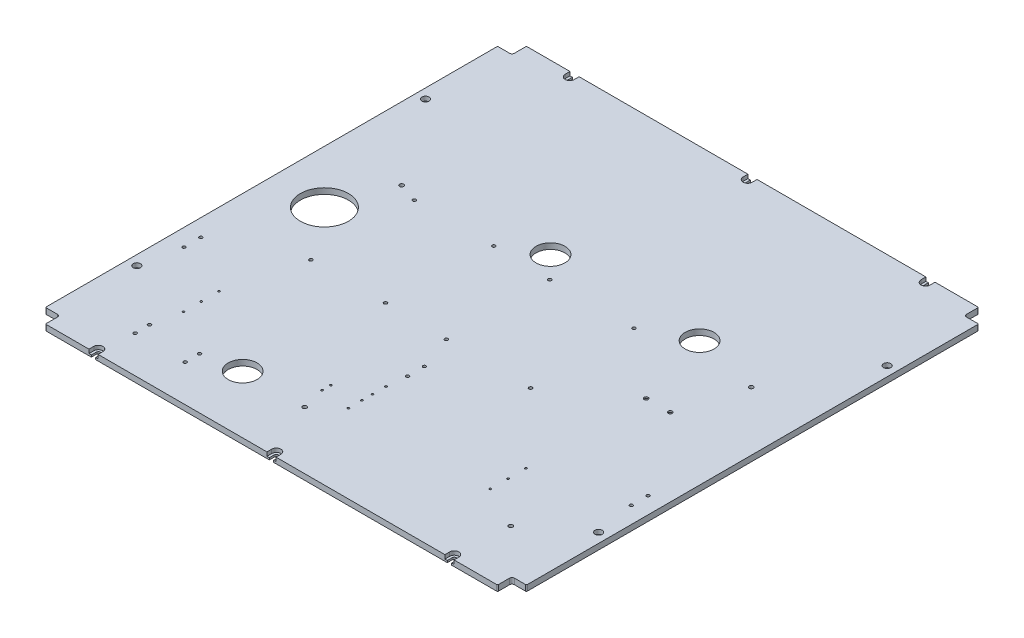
ISO-10303-21;
HEADER;
FILE_DESCRIPTION(('STEP AP214'),'2;1');
FILE_NAME('part.step','',(''),(''),'','','');
FILE_SCHEMA(('AUTOMOTIVE_DESIGN { 1 0 10303 214 1 1 1 1 }'));
ENDSEC;
DATA;
#1=APPLICATION_CONTEXT('core data for automotive mechanical design processes');
#2=APPLICATION_PROTOCOL_DEFINITION('international standard','automotive_design',2000,#1);
#3=PRODUCT_CONTEXT('',#1,'mechanical');
#4=PRODUCT('Part','Part','',(#3));
#5=PRODUCT_RELATED_PRODUCT_CATEGORY('part','',(#4));
#6=PRODUCT_DEFINITION_FORMATION('','',#4);
#7=PRODUCT_DEFINITION_CONTEXT('part definition',#1,'design');
#8=PRODUCT_DEFINITION('design','',#6,#7);
#9=PRODUCT_DEFINITION_SHAPE('','',#8);
#10=(LENGTH_UNIT() NAMED_UNIT(*) SI_UNIT(.MILLI.,.METRE.));
#11=(NAMED_UNIT(*) PLANE_ANGLE_UNIT() SI_UNIT($,.RADIAN.));
#12=(NAMED_UNIT(*) SI_UNIT($,.STERADIAN.) SOLID_ANGLE_UNIT());
#13=UNCERTAINTY_MEASURE_WITH_UNIT(LENGTH_MEASURE(1.E-05),#10,'distance_accuracy_value','');
#14=(GEOMETRIC_REPRESENTATION_CONTEXT(3) GLOBAL_UNCERTAINTY_ASSIGNED_CONTEXT((#13)) GLOBAL_UNIT_ASSIGNED_CONTEXT((#10,
#11,#12)) REPRESENTATION_CONTEXT('',''));
#15=CARTESIAN_POINT('',(0.,0.,0.));
#16=DIRECTION('',(0.,0.,1.));
#17=DIRECTION('',(1.,0.,0.));
#18=AXIS2_PLACEMENT_3D('',#15,#16,#17);
#19=CARTESIAN_POINT('',(-370.,4.,490.));
#20=DIRECTION('',(0.,1.,0.));
#21=DIRECTION('',(0.,0.,1.));
#22=AXIS2_PLACEMENT_3D('',#19,#20,#21);
#23=CYLINDRICAL_SURFACE('',#22,9.50000000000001);
#24=DIRECTION('',(0.,1.,0.));
#25=VECTOR('',#24,1.);
#26=CARTESIAN_POINT('',(-379.5,4.,490.));
#27=LINE('',#26,#25);
#28=CARTESIAN_POINT('',(-379.5,12.,490.));
#29=VERTEX_POINT('',#28);
#30=CARTESIAN_POINT('',(-379.5,4.,490.));
#31=VERTEX_POINT('',#30);
#32=EDGE_CURVE('E490',#29,#31,#27,.F.);
#33=ORIENTED_EDGE('',*,*,#32,.T.);
#34=CARTESIAN_POINT('',(-370.,4.,490.));
#35=DIRECTION('',(0.,1.,0.));
#36=DIRECTION('',(0.,0.,1.));
#37=AXIS2_PLACEMENT_3D('',#34,#35,#36);
#38=CIRCLE('',#37,9.50000000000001);
#39=CARTESIAN_POINT('',(-360.5,4.,490.));
#40=VERTEX_POINT('',#39);
#41=EDGE_CURVE('E1166',#40,#31,#38,.T.);
#42=ORIENTED_EDGE('',*,*,#41,.F.);
#43=DIRECTION('',(0.,1.,0.));
#44=VECTOR('',#43,1.);
#45=CARTESIAN_POINT('',(-360.5,4.,490.));
#46=LINE('',#45,#44);
#47=CARTESIAN_POINT('',(-360.5,12.,490.));
#48=VERTEX_POINT('',#47);
#49=EDGE_CURVE('E428',#40,#48,#46,.T.);
#50=ORIENTED_EDGE('',*,*,#49,.T.);
#51=CARTESIAN_POINT('',(-370.,12.,490.));
#52=DIRECTION('',(0.,1.,0.));
#53=DIRECTION('',(0.,0.,1.));
#54=AXIS2_PLACEMENT_3D('',#51,#52,#53);
#55=CIRCLE('',#54,9.50000000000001);
#56=EDGE_CURVE('E1124',#29,#48,#55,.F.);
#57=ORIENTED_EDGE('',*,*,#56,.F.);
#58=EDGE_LOOP('',(#33,#42,#50,#57));
#59=FACE_BOUND('',#58,.T.);
#60=ADVANCED_FACE('F17',(#59),#23,.F.);
#61=CARTESIAN_POINT('',(0.,4.,490.));
#62=DIRECTION('',(0.,1.,0.));
#63=DIRECTION('',(0.,0.,1.));
#64=AXIS2_PLACEMENT_3D('',#61,#62,#63);
#65=CYLINDRICAL_SURFACE('',#64,9.50000000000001);
#66=DIRECTION('',(0.,1.,0.));
#67=VECTOR('',#66,1.);
#68=CARTESIAN_POINT('',(-9.5,4.,490.));
#69=LINE('',#68,#67);
#70=CARTESIAN_POINT('',(-9.5,12.,490.));
#71=VERTEX_POINT('',#70);
#72=CARTESIAN_POINT('',(-9.5,4.,490.));
#73=VERTEX_POINT('',#72);
#74=EDGE_CURVE('E430',#71,#73,#69,.F.);
#75=ORIENTED_EDGE('',*,*,#74,.T.);
#76=CARTESIAN_POINT('',(0.,4.,490.));
#77=DIRECTION('',(0.,1.,0.));
#78=DIRECTION('',(0.,0.,1.));
#79=AXIS2_PLACEMENT_3D('',#76,#77,#78);
#80=CIRCLE('',#79,9.50000000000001);
#81=CARTESIAN_POINT('',(9.5,4.,490.));
#82=VERTEX_POINT('',#81);
#83=EDGE_CURVE('E20',#82,#73,#80,.T.);
#84=ORIENTED_EDGE('',*,*,#83,.F.);
#85=DIRECTION('',(0.,1.,0.));
#86=VECTOR('',#85,1.);
#87=CARTESIAN_POINT('',(9.5,4.,490.));
#88=LINE('',#87,#86);
#89=CARTESIAN_POINT('',(9.5,12.,490.));
#90=VERTEX_POINT('',#89);
#91=EDGE_CURVE('E441',#82,#90,#88,.T.);
#92=ORIENTED_EDGE('',*,*,#91,.T.);
#93=CARTESIAN_POINT('',(0.,12.,490.));
#94=DIRECTION('',(0.,1.,0.));
#95=DIRECTION('',(0.,0.,1.));
#96=AXIS2_PLACEMENT_3D('',#93,#94,#95);
#97=CIRCLE('',#96,9.50000000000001);
#98=EDGE_CURVE('E432',#71,#90,#97,.F.);
#99=ORIENTED_EDGE('',*,*,#98,.F.);
#100=EDGE_LOOP('',(#75,#84,#92,#99));
#101=FACE_BOUND('',#100,.T.);
#102=ADVANCED_FACE('F431',(#101),#65,.F.);
#103=CARTESIAN_POINT('',(370.,4.,490.));
#104=DIRECTION('',(0.,1.,0.));
#105=DIRECTION('',(0.,0.,1.));
#106=AXIS2_PLACEMENT_3D('',#103,#104,#105);
#107=CYLINDRICAL_SURFACE('',#106,9.50000000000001);
#108=DIRECTION('',(0.,1.,0.));
#109=VECTOR('',#108,1.);
#110=CARTESIAN_POINT('',(360.5,4.,490.));
#111=LINE('',#110,#109);
#112=CARTESIAN_POINT('',(360.5,12.,490.));
#113=VERTEX_POINT('',#112);
#114=CARTESIAN_POINT('',(360.5,4.,490.));
#115=VERTEX_POINT('',#114);
#116=EDGE_CURVE('E516',#113,#115,#111,.F.);
#117=ORIENTED_EDGE('',*,*,#116,.T.);
#118=CARTESIAN_POINT('',(370.,4.,490.));
#119=DIRECTION('',(0.,1.,0.));
#120=DIRECTION('',(0.,0.,1.));
#121=AXIS2_PLACEMENT_3D('',#118,#119,#120);
#122=CIRCLE('',#121,9.50000000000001);
#123=CARTESIAN_POINT('',(379.5,4.,490.));
#124=VERTEX_POINT('',#123);
#125=EDGE_CURVE('E519',#124,#115,#122,.T.);
#126=ORIENTED_EDGE('',*,*,#125,.F.);
#127=DIRECTION('',(0.,1.,0.));
#128=VECTOR('',#127,1.);
#129=CARTESIAN_POINT('',(379.5,4.,490.));
#130=LINE('',#129,#128);
#131=CARTESIAN_POINT('',(379.5,12.,490.));
#132=VERTEX_POINT('',#131);
#133=EDGE_CURVE('E512',#124,#132,#130,.T.);
#134=ORIENTED_EDGE('',*,*,#133,.T.);
#135=CARTESIAN_POINT('',(370.,12.,490.));
#136=DIRECTION('',(0.,1.,0.));
#137=DIRECTION('',(0.,0.,1.));
#138=AXIS2_PLACEMENT_3D('',#135,#136,#137);
#139=CIRCLE('',#138,9.50000000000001);
#140=EDGE_CURVE('E1112',#113,#132,#139,.F.);
#141=ORIENTED_EDGE('',*,*,#140,.F.);
#142=EDGE_LOOP('',(#117,#126,#134,#141));
#143=FACE_BOUND('',#142,.T.);
#144=ADVANCED_FACE('F2065',(#143),#107,.F.);
#145=CARTESIAN_POINT('',(370.,4.,-490.));
#146=DIRECTION('',(0.,1.,0.));
#147=DIRECTION('',(0.,0.,1.));
#148=AXIS2_PLACEMENT_3D('',#145,#146,#147);
#149=CYLINDRICAL_SURFACE('',#148,9.4999999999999);
#150=CARTESIAN_POINT('',(370.,4.,-490.));
#151=DIRECTION('',(0.,1.,0.));
#152=DIRECTION('',(0.,0.,1.));
#153=AXIS2_PLACEMENT_3D('',#150,#151,#152);
#154=CIRCLE('',#153,9.4999999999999);
#155=CARTESIAN_POINT('',(360.5,4.,-490.));
#156=VERTEX_POINT('',#155);
#157=CARTESIAN_POINT('',(379.5,4.,-490.));
#158=VERTEX_POINT('',#157);
#159=EDGE_CURVE('E505',#156,#158,#154,.T.);
#160=ORIENTED_EDGE('',*,*,#159,.F.);
#161=DIRECTION('',(0.,1.,0.));
#162=VECTOR('',#161,1.);
#163=CARTESIAN_POINT('',(360.5,4.,-490.));
#164=LINE('',#163,#162);
#165=CARTESIAN_POINT('',(360.5,12.,-490.));
#166=VERTEX_POINT('',#165);
#167=EDGE_CURVE('E496',#156,#166,#164,.T.);
#168=ORIENTED_EDGE('',*,*,#167,.T.);
#169=CARTESIAN_POINT('',(370.,12.,-490.));
#170=DIRECTION('',(0.,1.,0.));
#171=DIRECTION('',(0.,0.,1.));
#172=AXIS2_PLACEMENT_3D('',#169,#170,#171);
#173=CIRCLE('',#172,9.4999999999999);
#174=CARTESIAN_POINT('',(379.5,12.,-490.));
#175=VERTEX_POINT('',#174);
#176=EDGE_CURVE('E1105',#175,#166,#173,.F.);
#177=ORIENTED_EDGE('',*,*,#176,.F.);
#178=DIRECTION('',(0.,1.,0.));
#179=VECTOR('',#178,1.);
#180=CARTESIAN_POINT('',(379.5,4.,-490.));
#181=LINE('',#180,#179);
#182=EDGE_CURVE('E506',#175,#158,#181,.F.);
#183=ORIENTED_EDGE('',*,*,#182,.T.);
#184=EDGE_LOOP('',(#160,#168,#177,#183));
#185=FACE_BOUND('',#184,.T.);
#186=ADVANCED_FACE('F1972',(#185),#149,.F.);
#187=CARTESIAN_POINT('',(0.,4.,-490.));
#188=DIRECTION('',(0.,1.,0.));
#189=DIRECTION('',(0.,0.,1.));
#190=AXIS2_PLACEMENT_3D('',#187,#188,#189);
#191=CYLINDRICAL_SURFACE('',#190,9.50000000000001);
#192=CARTESIAN_POINT('',(0.,4.,-490.));
#193=DIRECTION('',(0.,1.,0.));
#194=DIRECTION('',(0.,0.,1.));
#195=AXIS2_PLACEMENT_3D('',#192,#193,#194);
#196=CIRCLE('',#195,9.50000000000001);
#197=CARTESIAN_POINT('',(-9.5,4.,-490.));
#198=VERTEX_POINT('',#197);
#199=CARTESIAN_POINT('',(9.5,4.,-490.));
#200=VERTEX_POINT('',#199);
#201=EDGE_CURVE('E495',#198,#200,#196,.T.);
#202=ORIENTED_EDGE('',*,*,#201,.F.);
#203=DIRECTION('',(0.,1.,0.));
#204=VECTOR('',#203,1.);
#205=CARTESIAN_POINT('',(-9.5,4.,-490.));
#206=LINE('',#205,#204);
#207=CARTESIAN_POINT('',(-9.5,12.,-490.));
#208=VERTEX_POINT('',#207);
#209=EDGE_CURVE('E497',#198,#208,#206,.T.);
#210=ORIENTED_EDGE('',*,*,#209,.T.);
#211=CARTESIAN_POINT('',(0.,12.,-490.));
#212=DIRECTION('',(0.,1.,0.));
#213=DIRECTION('',(0.,0.,1.));
#214=AXIS2_PLACEMENT_3D('',#211,#212,#213);
#215=CIRCLE('',#214,9.50000000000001);
#216=CARTESIAN_POINT('',(9.5,12.,-490.));
#217=VERTEX_POINT('',#216);
#218=EDGE_CURVE('E1098',#217,#208,#215,.F.);
#219=ORIENTED_EDGE('',*,*,#218,.F.);
#220=DIRECTION('',(0.,1.,0.));
#221=VECTOR('',#220,1.);
#222=CARTESIAN_POINT('',(9.5,4.,-490.));
#223=LINE('',#222,#221);
#224=EDGE_CURVE('E502',#217,#200,#223,.F.);
#225=ORIENTED_EDGE('',*,*,#224,.T.);
#226=EDGE_LOOP('',(#202,#210,#219,#225));
#227=FACE_BOUND('',#226,.T.);
#228=ADVANCED_FACE('F2059',(#227),#191,.F.);
#229=CARTESIAN_POINT('',(-370.,4.,-490.));
#230=DIRECTION('',(0.,1.,0.));
#231=DIRECTION('',(0.,0.,1.));
#232=AXIS2_PLACEMENT_3D('',#229,#230,#231);
#233=CYLINDRICAL_SURFACE('',#232,9.4999999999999);
#234=CARTESIAN_POINT('',(-370.,4.,-490.));
#235=DIRECTION('',(0.,1.,0.));
#236=DIRECTION('',(0.,0.,1.));
#237=AXIS2_PLACEMENT_3D('',#234,#235,#236);
#238=CIRCLE('',#237,9.4999999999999);
#239=CARTESIAN_POINT('',(-379.5,4.,-490.));
#240=VERTEX_POINT('',#239);
#241=CARTESIAN_POINT('',(-360.5,4.,-490.));
#242=VERTEX_POINT('',#241);
#243=EDGE_CURVE('E500',#240,#242,#238,.T.);
#244=ORIENTED_EDGE('',*,*,#243,.F.);
#245=DIRECTION('',(0.,1.,0.));
#246=VECTOR('',#245,1.);
#247=CARTESIAN_POINT('',(-379.5,4.,-490.));
#248=LINE('',#247,#246);
#249=CARTESIAN_POINT('',(-379.5,12.,-490.));
#250=VERTEX_POINT('',#249);
#251=EDGE_CURVE('E487',#240,#250,#248,.T.);
#252=ORIENTED_EDGE('',*,*,#251,.T.);
#253=CARTESIAN_POINT('',(-370.,12.,-490.));
#254=DIRECTION('',(0.,1.,0.));
#255=DIRECTION('',(0.,0.,1.));
#256=AXIS2_PLACEMENT_3D('',#253,#254,#255);
#257=CIRCLE('',#256,9.4999999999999);
#258=CARTESIAN_POINT('',(-360.5,12.,-490.));
#259=VERTEX_POINT('',#258);
#260=EDGE_CURVE('E1091',#259,#250,#257,.F.);
#261=ORIENTED_EDGE('',*,*,#260,.F.);
#262=DIRECTION('',(0.,1.,0.));
#263=VECTOR('',#262,1.);
#264=CARTESIAN_POINT('',(-360.5,4.,-490.));
#265=LINE('',#264,#263);
#266=EDGE_CURVE('E492',#259,#242,#265,.F.);
#267=ORIENTED_EDGE('',*,*,#266,.T.);
#268=EDGE_LOOP('',(#244,#252,#261,#267));
#269=FACE_BOUND('',#268,.T.);
#270=ADVANCED_FACE('F1913',(#269),#233,.F.);
#271=CARTESIAN_POINT('',(480.,12.,-300.));
#272=DIRECTION('',(0.,1.,0.));
#273=DIRECTION('',(0.,0.,1.));
#274=AXIS2_PLACEMENT_3D('',#271,#272,#273);
#275=CYLINDRICAL_SURFACE('',#274,7.50000000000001);
#276=CARTESIAN_POINT('',(480.,12.,-300.));
#277=DIRECTION('',(0.,1.,0.));
#278=DIRECTION('',(0.,0.,1.));
#279=AXIS2_PLACEMENT_3D('',#276,#277,#278);
#280=CIRCLE('',#279,7.50000000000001);
#281=CARTESIAN_POINT('',(480.,12.,-292.5));
#282=VERTEX_POINT('',#281);
#283=EDGE_CURVE('E1086',#282,#282,#280,.F.);
#284=ORIENTED_EDGE('',*,*,#283,.F.);
#285=EDGE_LOOP('',(#284));
#286=FACE_BOUND('',#285,.T.);
#287=CARTESIAN_POINT('',(480.,3.,-300.));
#288=DIRECTION('',(0.,1.,0.));
#289=DIRECTION('',(0.,0.,1.));
#290=AXIS2_PLACEMENT_3D('',#287,#288,#289);
#291=CIRCLE('',#290,7.50000000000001);
#292=CARTESIAN_POINT('',(480.,3.,-292.5));
#293=VERTEX_POINT('',#292);
#294=EDGE_CURVE('E1153',#293,#293,#291,.F.);
#295=ORIENTED_EDGE('',*,*,#294,.T.);
#296=EDGE_LOOP('',(#295));
#297=FACE_BOUND('',#296,.T.);
#298=ADVANCED_FACE('F2052',(#286,#297),#275,.F.);
#299=CARTESIAN_POINT('',(480.,12.,300.));
#300=DIRECTION('',(0.,1.,0.));
#301=DIRECTION('',(0.,0.,1.));
#302=AXIS2_PLACEMENT_3D('',#299,#300,#301);
#303=CYLINDRICAL_SURFACE('',#302,7.50000000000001);
#304=CARTESIAN_POINT('',(480.,12.,300.));
#305=DIRECTION('',(0.,1.,0.));
#306=DIRECTION('',(0.,0.,1.));
#307=AXIS2_PLACEMENT_3D('',#304,#305,#306);
#308=CIRCLE('',#307,7.50000000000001);
#309=CARTESIAN_POINT('',(480.,12.,307.5));
#310=VERTEX_POINT('',#309);
#311=EDGE_CURVE('E1083',#310,#310,#308,.F.);
#312=ORIENTED_EDGE('',*,*,#311,.F.);
#313=EDGE_LOOP('',(#312));
#314=FACE_BOUND('',#313,.T.);
#315=CARTESIAN_POINT('',(480.,3.,300.));
#316=DIRECTION('',(0.,1.,0.));
#317=DIRECTION('',(0.,0.,1.));
#318=AXIS2_PLACEMENT_3D('',#315,#316,#317);
#319=CIRCLE('',#318,7.50000000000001);
#320=CARTESIAN_POINT('',(480.,3.,307.5));
#321=VERTEX_POINT('',#320);
#322=EDGE_CURVE('E1156',#321,#321,#319,.F.);
#323=ORIENTED_EDGE('',*,*,#322,.T.);
#324=EDGE_LOOP('',(#323));
#325=FACE_BOUND('',#324,.T.);
#326=ADVANCED_FACE('F2048',(#314,#325),#303,.F.);
#327=CARTESIAN_POINT('',(-480.,12.,300.));
#328=DIRECTION('',(0.,1.,0.));
#329=DIRECTION('',(0.,0.,1.));
#330=AXIS2_PLACEMENT_3D('',#327,#328,#329);
#331=CYLINDRICAL_SURFACE('',#330,7.50000000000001);
#332=CARTESIAN_POINT('',(-480.,12.,300.));
#333=DIRECTION('',(0.,1.,0.));
#334=DIRECTION('',(0.,0.,1.));
#335=AXIS2_PLACEMENT_3D('',#332,#333,#334);
#336=CIRCLE('',#335,7.50000000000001);
#337=CARTESIAN_POINT('',(-480.,12.,307.5));
#338=VERTEX_POINT('',#337);
#339=EDGE_CURVE('E1080',#338,#338,#336,.F.);
#340=ORIENTED_EDGE('',*,*,#339,.F.);
#341=EDGE_LOOP('',(#340));
#342=FACE_BOUND('',#341,.T.);
#343=CARTESIAN_POINT('',(-480.,3.,300.));
#344=DIRECTION('',(0.,1.,0.));
#345=DIRECTION('',(0.,0.,1.));
#346=AXIS2_PLACEMENT_3D('',#343,#344,#345);
#347=CIRCLE('',#346,7.50000000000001);
#348=CARTESIAN_POINT('',(-480.,3.,307.5));
#349=VERTEX_POINT('',#348);
#350=EDGE_CURVE('E1159',#349,#349,#347,.F.);
#351=ORIENTED_EDGE('',*,*,#350,.T.);
#352=EDGE_LOOP('',(#351));
#353=FACE_BOUND('',#352,.T.);
#354=ADVANCED_FACE('F2044',(#342,#353),#331,.F.);
#355=CARTESIAN_POINT('',(-480.,12.,-300.));
#356=DIRECTION('',(0.,1.,0.));
#357=DIRECTION('',(0.,0.,1.));
#358=AXIS2_PLACEMENT_3D('',#355,#356,#357);
#359=CYLINDRICAL_SURFACE('',#358,7.50000000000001);
#360=CARTESIAN_POINT('',(-480.,12.,-300.));
#361=DIRECTION('',(0.,1.,0.));
#362=DIRECTION('',(0.,0.,1.));
#363=AXIS2_PLACEMENT_3D('',#360,#361,#362);
#364=CIRCLE('',#363,7.50000000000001);
#365=CARTESIAN_POINT('',(-480.,12.,-292.5));
#366=VERTEX_POINT('',#365);
#367=EDGE_CURVE('E1077',#366,#366,#364,.F.);
#368=ORIENTED_EDGE('',*,*,#367,.F.);
#369=EDGE_LOOP('',(#368));
#370=FACE_BOUND('',#369,.T.);
#371=CARTESIAN_POINT('',(-480.,3.,-300.));
#372=DIRECTION('',(0.,1.,0.));
#373=DIRECTION('',(0.,0.,1.));
#374=AXIS2_PLACEMENT_3D('',#371,#372,#373);
#375=CIRCLE('',#374,7.50000000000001);
#376=CARTESIAN_POINT('',(-480.,3.,-292.5));
#377=VERTEX_POINT('',#376);
#378=EDGE_CURVE('E1162',#377,#377,#375,.F.);
#379=ORIENTED_EDGE('',*,*,#378,.T.);
#380=EDGE_LOOP('',(#379));
#381=FACE_BOUND('',#380,.T.);
#382=ADVANCED_FACE('F2040',(#370,#381),#359,.F.);
#383=CARTESIAN_POINT('',(338.400000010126,0.,9.5000000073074));
#384=DIRECTION('',(0.,-1.,0.));
#385=DIRECTION('',(0.,0.,-1.));
#386=AXIS2_PLACEMENT_3D('',#383,#384,#385);
#387=CYLINDRICAL_SURFACE('',#386,4.19999999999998);
#388=CARTESIAN_POINT('',(338.400000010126,12.,9.5000000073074));
#389=DIRECTION('',(0.,-1.,0.));
#390=DIRECTION('',(0.,0.,-1.));
#391=AXIS2_PLACEMENT_3D('',#388,#389,#390);
#392=CIRCLE('',#391,4.19999999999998);
#393=CARTESIAN_POINT('',(338.400000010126,12.,5.30000000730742));
#394=VERTEX_POINT('',#393);
#395=EDGE_CURVE('E1129',#394,#394,#392,.T.);
#396=ORIENTED_EDGE('',*,*,#395,.F.);
#397=EDGE_LOOP('',(#396));
#398=FACE_BOUND('',#397,.T.);
#399=CARTESIAN_POINT('',(338.400000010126,9.,9.5000000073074));
#400=DIRECTION('',(0.,-1.,0.));
#401=DIRECTION('',(0.,0.,-1.));
#402=AXIS2_PLACEMENT_3D('',#399,#400,#401);
#403=CIRCLE('',#402,4.19999999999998);
#404=CARTESIAN_POINT('',(338.400000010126,9.,5.30000000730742));
#405=VERTEX_POINT('',#404);
#406=EDGE_CURVE('E1074',#405,#405,#403,.T.);
#407=ORIENTED_EDGE('',*,*,#406,.T.);
#408=EDGE_LOOP('',(#407));
#409=FACE_BOUND('',#408,.T.);
#410=ADVANCED_FACE('F2036',(#398,#409),#387,.F.);
#411=CARTESIAN_POINT('',(288.400000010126,0.,9.50000000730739));
#412=DIRECTION('',(0.,-1.,0.));
#413=DIRECTION('',(0.,0.,-1.));
#414=AXIS2_PLACEMENT_3D('',#411,#412,#413);
#415=CYLINDRICAL_SURFACE('',#414,4.20000000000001);
#416=CARTESIAN_POINT('',(288.400000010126,12.,9.50000000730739));
#417=DIRECTION('',(0.,-1.,0.));
#418=DIRECTION('',(0.,0.,-1.));
#419=AXIS2_PLACEMENT_3D('',#416,#417,#418);
#420=CIRCLE('',#419,4.20000000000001);
#421=CARTESIAN_POINT('',(288.400000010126,12.,5.30000000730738));
#422=VERTEX_POINT('',#421);
#423=EDGE_CURVE('E1132',#422,#422,#420,.T.);
#424=ORIENTED_EDGE('',*,*,#423,.F.);
#425=EDGE_LOOP('',(#424));
#426=FACE_BOUND('',#425,.T.);
#427=CARTESIAN_POINT('',(288.400000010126,9.,9.50000000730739));
#428=DIRECTION('',(0.,-1.,0.));
#429=DIRECTION('',(0.,0.,-1.));
#430=AXIS2_PLACEMENT_3D('',#427,#428,#429);
#431=CIRCLE('',#430,4.20000000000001);
#432=CARTESIAN_POINT('',(288.400000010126,9.,5.30000000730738));
#433=VERTEX_POINT('',#432);
#434=EDGE_CURVE('E1071',#433,#433,#431,.T.);
#435=ORIENTED_EDGE('',*,*,#434,.T.);
#436=EDGE_LOOP('',(#435));
#437=FACE_BOUND('',#436,.T.);
#438=ADVANCED_FACE('F2032',(#426,#437),#415,.F.);
#439=CARTESIAN_POINT('',(465.499999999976,0.,182.500000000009));
#440=DIRECTION('',(0.,-1.,0.));
#441=DIRECTION('',(0.,0.,-1.));
#442=AXIS2_PLACEMENT_3D('',#439,#440,#441);
#443=CYLINDRICAL_SURFACE('',#442,3.19999999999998);
#444=CARTESIAN_POINT('',(465.499999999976,12.,182.500000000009));
#445=DIRECTION('',(0.,-1.,0.));
#446=DIRECTION('',(0.,0.,-1.));
#447=AXIS2_PLACEMENT_3D('',#444,#445,#446);
#448=CIRCLE('',#447,3.19999999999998);
#449=CARTESIAN_POINT('',(465.499999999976,12.,179.30000000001));
#450=VERTEX_POINT('',#449);
#451=EDGE_CURVE('E1135',#450,#450,#448,.T.);
#452=ORIENTED_EDGE('',*,*,#451,.F.);
#453=EDGE_LOOP('',(#452));
#454=FACE_BOUND('',#453,.T.);
#455=CARTESIAN_POINT('',(465.499999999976,6.8,182.500000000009));
#456=DIRECTION('',(0.,-1.,0.));
#457=DIRECTION('',(0.,0.,-1.));
#458=AXIS2_PLACEMENT_3D('',#455,#456,#457);
#459=CIRCLE('',#458,3.19999999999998);
#460=CARTESIAN_POINT('',(465.499999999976,6.8,179.30000000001));
#461=VERTEX_POINT('',#460);
#462=EDGE_CURVE('E1068',#461,#461,#459,.T.);
#463=ORIENTED_EDGE('',*,*,#462,.T.);
#464=EDGE_LOOP('',(#463));
#465=FACE_BOUND('',#464,.T.);
#466=ADVANCED_FACE('F2028',(#454,#465),#443,.F.);
#467=CARTESIAN_POINT('',(465.499999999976,0.,217.500000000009));
#468=DIRECTION('',(0.,-1.,0.));
#469=DIRECTION('',(0.,0.,-1.));
#470=AXIS2_PLACEMENT_3D('',#467,#468,#469);
#471=CYLINDRICAL_SURFACE('',#470,3.19999999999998);
#472=CARTESIAN_POINT('',(465.499999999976,12.,217.500000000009));
#473=DIRECTION('',(0.,-1.,0.));
#474=DIRECTION('',(0.,0.,-1.));
#475=AXIS2_PLACEMENT_3D('',#472,#473,#474);
#476=CIRCLE('',#475,3.19999999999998);
#477=CARTESIAN_POINT('',(465.499999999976,12.,214.30000000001));
#478=VERTEX_POINT('',#477);
#479=EDGE_CURVE('E1138',#478,#478,#476,.T.);
#480=ORIENTED_EDGE('',*,*,#479,.F.);
#481=EDGE_LOOP('',(#480));
#482=FACE_BOUND('',#481,.T.);
#483=CARTESIAN_POINT('',(465.499999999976,6.8,217.500000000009));
#484=DIRECTION('',(0.,-1.,0.));
#485=DIRECTION('',(0.,0.,-1.));
#486=AXIS2_PLACEMENT_3D('',#483,#484,#485);
#487=CIRCLE('',#486,3.19999999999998);
#488=CARTESIAN_POINT('',(465.499999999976,6.8,214.30000000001));
#489=VERTEX_POINT('',#488);
#490=EDGE_CURVE('E1065',#489,#489,#487,.T.);
#491=ORIENTED_EDGE('',*,*,#490,.T.);
#492=EDGE_LOOP('',(#491));
#493=FACE_BOUND('',#492,.T.);
#494=ADVANCED_FACE('F2024',(#482,#493),#471,.F.);
#495=CARTESIAN_POINT('',(0.499999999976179,0.,182.500000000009));
#496=DIRECTION('',(0.,-1.,0.));
#497=DIRECTION('',(0.,0.,-1.));
#498=AXIS2_PLACEMENT_3D('',#495,#496,#497);
#499=CYLINDRICAL_SURFACE('',#498,3.20000000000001);
#500=CARTESIAN_POINT('',(0.499999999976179,12.,182.500000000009));
#501=DIRECTION('',(0.,-1.,0.));
#502=DIRECTION('',(0.,0.,-1.));
#503=AXIS2_PLACEMENT_3D('',#500,#501,#502);
#504=CIRCLE('',#503,3.20000000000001);
#505=CARTESIAN_POINT('',(0.499999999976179,12.,179.300000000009));
#506=VERTEX_POINT('',#505);
#507=EDGE_CURVE('E1141',#506,#506,#504,.T.);
#508=ORIENTED_EDGE('',*,*,#507,.F.);
#509=EDGE_LOOP('',(#508));
#510=FACE_BOUND('',#509,.T.);
#511=CARTESIAN_POINT('',(0.499999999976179,6.8,182.500000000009));
#512=DIRECTION('',(0.,-1.,0.));
#513=DIRECTION('',(0.,0.,-1.));
#514=AXIS2_PLACEMENT_3D('',#511,#512,#513);
#515=CIRCLE('',#514,3.20000000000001);
#516=CARTESIAN_POINT('',(0.499999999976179,6.8,179.300000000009));
#517=VERTEX_POINT('',#516);
#518=EDGE_CURVE('E1062',#517,#517,#515,.T.);
#519=ORIENTED_EDGE('',*,*,#518,.T.);
#520=EDGE_LOOP('',(#519));
#521=FACE_BOUND('',#520,.T.);
#522=ADVANCED_FACE('F2020',(#510,#521),#499,.F.);
#523=CARTESIAN_POINT('',(0.499999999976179,0.,217.500000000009));
#524=DIRECTION('',(0.,-1.,0.));
#525=DIRECTION('',(0.,0.,-1.));
#526=AXIS2_PLACEMENT_3D('',#523,#524,#525);
#527=CYLINDRICAL_SURFACE('',#526,3.20000000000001);
#528=CARTESIAN_POINT('',(0.499999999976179,12.,217.500000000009));
#529=DIRECTION('',(0.,-1.,0.));
#530=DIRECTION('',(0.,0.,-1.));
#531=AXIS2_PLACEMENT_3D('',#528,#529,#530);
#532=CIRCLE('',#531,3.20000000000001);
#533=CARTESIAN_POINT('',(0.499999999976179,12.,214.300000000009));
#534=VERTEX_POINT('',#533);
#535=EDGE_CURVE('E1144',#534,#534,#532,.T.);
#536=ORIENTED_EDGE('',*,*,#535,.F.);
#537=EDGE_LOOP('',(#536));
#538=FACE_BOUND('',#537,.T.);
#539=CARTESIAN_POINT('',(0.499999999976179,6.8,217.500000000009));
#540=DIRECTION('',(0.,-1.,0.));
#541=DIRECTION('',(0.,0.,-1.));
#542=AXIS2_PLACEMENT_3D('',#539,#540,#541);
#543=CIRCLE('',#542,3.20000000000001);
#544=CARTESIAN_POINT('',(0.499999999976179,6.8,214.300000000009));
#545=VERTEX_POINT('',#544);
#546=EDGE_CURVE('E1059',#545,#545,#543,.T.);
#547=ORIENTED_EDGE('',*,*,#546,.T.);
#548=EDGE_LOOP('',(#547));
#549=FACE_BOUND('',#548,.T.);
#550=ADVANCED_FACE('F2016',(#538,#549),#527,.F.);
#551=CARTESIAN_POINT('',(-464.500000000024,0.,182.500000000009));
#552=DIRECTION('',(0.,-1.,0.));
#553=DIRECTION('',(0.,0.,-1.));
#554=AXIS2_PLACEMENT_3D('',#551,#552,#553);
#555=CYLINDRICAL_SURFACE('',#554,3.19999999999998);
#556=CARTESIAN_POINT('',(-464.500000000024,12.,182.500000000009));
#557=DIRECTION('',(0.,-1.,0.));
#558=DIRECTION('',(0.,0.,-1.));
#559=AXIS2_PLACEMENT_3D('',#556,#557,#558);
#560=CIRCLE('',#559,3.19999999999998);
#561=CARTESIAN_POINT('',(-464.500000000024,12.,179.30000000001));
#562=VERTEX_POINT('',#561);
#563=EDGE_CURVE('E1147',#562,#562,#560,.T.);
#564=ORIENTED_EDGE('',*,*,#563,.F.);
#565=EDGE_LOOP('',(#564));
#566=FACE_BOUND('',#565,.T.);
#567=CARTESIAN_POINT('',(-464.500000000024,6.8,182.500000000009));
#568=DIRECTION('',(0.,-1.,0.));
#569=DIRECTION('',(0.,0.,-1.));
#570=AXIS2_PLACEMENT_3D('',#567,#568,#569);
#571=CIRCLE('',#570,3.19999999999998);
#572=CARTESIAN_POINT('',(-464.500000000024,6.8,179.30000000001));
#573=VERTEX_POINT('',#572);
#574=EDGE_CURVE('E1056',#573,#573,#571,.T.);
#575=ORIENTED_EDGE('',*,*,#574,.T.);
#576=EDGE_LOOP('',(#575));
#577=FACE_BOUND('',#576,.T.);
#578=ADVANCED_FACE('F2012',(#566,#577),#555,.F.);
#579=CARTESIAN_POINT('',(-464.500000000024,0.,217.500000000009));
#580=DIRECTION('',(0.,-1.,0.));
#581=DIRECTION('',(0.,0.,-1.));
#582=AXIS2_PLACEMENT_3D('',#579,#580,#581);
#583=CYLINDRICAL_SURFACE('',#582,3.19999999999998);
#584=CARTESIAN_POINT('',(-464.500000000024,12.,217.500000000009));
#585=DIRECTION('',(0.,-1.,0.));
#586=DIRECTION('',(0.,0.,-1.));
#587=AXIS2_PLACEMENT_3D('',#584,#585,#586);
#588=CIRCLE('',#587,3.19999999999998);
#589=CARTESIAN_POINT('',(-464.500000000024,12.,214.30000000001));
#590=VERTEX_POINT('',#589);
#591=EDGE_CURVE('E1150',#590,#590,#588,.T.);
#592=ORIENTED_EDGE('',*,*,#591,.F.);
#593=EDGE_LOOP('',(#592));
#594=FACE_BOUND('',#593,.T.);
#595=CARTESIAN_POINT('',(-464.500000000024,6.8,217.500000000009));
#596=DIRECTION('',(0.,-1.,0.));
#597=DIRECTION('',(0.,0.,-1.));
#598=AXIS2_PLACEMENT_3D('',#595,#596,#597);
#599=CIRCLE('',#598,3.19999999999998);
#600=CARTESIAN_POINT('',(-464.500000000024,6.8,214.30000000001));
#601=VERTEX_POINT('',#600);
#602=EDGE_CURVE('E1053',#601,#601,#599,.T.);
#603=ORIENTED_EDGE('',*,*,#602,.T.);
#604=EDGE_LOOP('',(#603));
#605=FACE_BOUND('',#604,.T.);
#606=ADVANCED_FACE('F2009',(#594,#605),#583,.F.);
#607=CARTESIAN_POINT('',(-9.5,4.,490.));
#608=DIRECTION('',(-1.,0.,0.));
#609=DIRECTION('',(0.,0.,1.));
#610=AXIS2_PLACEMENT_3D('',#607,#608,#609);
#611=PLANE('',#610);
#612=ORIENTED_EDGE('',*,*,#74,.F.);
#613=DIRECTION('',(0.,0.,1.));
#614=VECTOR('',#613,1.);
#615=CARTESIAN_POINT('',(-9.5,12.,0.));
#616=LINE('',#615,#614);
#617=CARTESIAN_POINT('',(-9.5,12.,500.));
#618=VERTEX_POINT('',#617);
#619=EDGE_CURVE('E1120',#618,#71,#616,.F.);
#620=ORIENTED_EDGE('',*,*,#619,.F.);
#621=DIRECTION('',(0.,1.,0.));
#622=VECTOR('',#621,1.);
#623=CARTESIAN_POINT('',(-9.50000000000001,12.,500.));
#624=LINE('',#623,#622);
#625=CARTESIAN_POINT('',(-9.50000000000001,4.,500.));
#626=VERTEX_POINT('',#625);
#627=EDGE_CURVE('E439',#618,#626,#624,.F.);
#628=ORIENTED_EDGE('',*,*,#627,.T.);
#629=DIRECTION('',(0.,0.,1.));
#630=VECTOR('',#629,1.);
#631=CARTESIAN_POINT('',(-9.5,4.,490.));
#632=LINE('',#631,#630);
#633=EDGE_CURVE('E423',#73,#626,#632,.T.);
#634=ORIENTED_EDGE('',*,*,#633,.F.);
#635=EDGE_LOOP('',(#612,#620,#628,#634));
#636=FACE_BOUND('',#635,.T.);
#637=ADVANCED_FACE('F438',(#636),#611,.F.);
#638=CARTESIAN_POINT('',(-360.5,4.,490.));
#639=DIRECTION('',(1.,0.,0.));
#640=DIRECTION('',(0.,0.,-1.));
#641=AXIS2_PLACEMENT_3D('',#638,#639,#640);
#642=PLANE('',#641);
#643=ORIENTED_EDGE('',*,*,#49,.F.);
#644=DIRECTION('',(0.,0.,1.));
#645=VECTOR('',#644,1.);
#646=CARTESIAN_POINT('',(-360.5,4.,490.));
#647=LINE('',#646,#645);
#648=CARTESIAN_POINT('',(-360.5,4.,500.));
#649=VERTEX_POINT('',#648);
#650=EDGE_CURVE('E524',#649,#40,#647,.F.);
#651=ORIENTED_EDGE('',*,*,#650,.F.);
#652=DIRECTION('',(0.,1.,0.));
#653=VECTOR('',#652,1.);
#654=CARTESIAN_POINT('',(-360.5,12.,500.));
#655=LINE('',#654,#653);
#656=CARTESIAN_POINT('',(-360.5,12.,500.));
#657=VERTEX_POINT('',#656);
#658=EDGE_CURVE('E467',#649,#657,#655,.T.);
#659=ORIENTED_EDGE('',*,*,#658,.T.);
#660=DIRECTION('',(0.,0.,1.));
#661=VECTOR('',#660,1.);
#662=CARTESIAN_POINT('',(-360.5,12.,0.));
#663=LINE('',#662,#661);
#664=EDGE_CURVE('E1122',#48,#657,#663,.T.);
#665=ORIENTED_EDGE('',*,*,#664,.F.);
#666=EDGE_LOOP('',(#643,#651,#659,#665));
#667=FACE_BOUND('',#666,.T.);
#668=ADVANCED_FACE('F1895',(#667),#642,.F.);
#669=CARTESIAN_POINT('',(0.,4.,490.));
#670=DIRECTION('',(0.,1.,0.));
#671=DIRECTION('',(0.,0.,1.));
#672=AXIS2_PLACEMENT_3D('',#669,#670,#671);
#673=PLANE('',#672);
#674=CARTESIAN_POINT('',(0.,4.,490.));
#675=DIRECTION('',(0.,1.,0.));
#676=DIRECTION('',(0.,0.,1.));
#677=AXIS2_PLACEMENT_3D('',#674,#675,#676);
#678=CIRCLE('',#677,4.5);
#679=CARTESIAN_POINT('',(-4.5,4.,490.));
#680=VERTEX_POINT('',#679);
#681=CARTESIAN_POINT('',(4.5,4.,490.));
#682=VERTEX_POINT('',#681);
#683=EDGE_CURVE('E1021',#680,#682,#678,.F.);
#684=ORIENTED_EDGE('',*,*,#683,.T.);
#685=DIRECTION('',(0.,0.,-1.));
#686=VECTOR('',#685,1.);
#687=CARTESIAN_POINT('',(4.5,4.,500.));
#688=LINE('',#687,#686);
#689=CARTESIAN_POINT('',(4.49999999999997,4.,500.));
#690=VERTEX_POINT('',#689);
#691=EDGE_CURVE('E449',#682,#690,#688,.F.);
#692=ORIENTED_EDGE('',*,*,#691,.T.);
#693=DIRECTION('',(-1.,0.,0.));
#694=VECTOR('',#693,1.);
#695=CARTESIAN_POINT('',(-500.,4.,500.));
#696=LINE('',#695,#694);
#697=CARTESIAN_POINT('',(9.49999999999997,4.,500.));
#698=VERTEX_POINT('',#697);
#699=EDGE_CURVE('E1209',#690,#698,#696,.F.);
#700=ORIENTED_EDGE('',*,*,#699,.T.);
#701=DIRECTION('',(0.,0.,-1.));
#702=VECTOR('',#701,1.);
#703=CARTESIAN_POINT('',(9.5,4.,490.));
#704=LINE('',#703,#702);
#705=EDGE_CURVE('E427',#698,#82,#704,.T.);
#706=ORIENTED_EDGE('',*,*,#705,.T.);
#707=ORIENTED_EDGE('',*,*,#83,.T.);
#708=ORIENTED_EDGE('',*,*,#633,.T.);
#709=DIRECTION('',(-1.,0.,0.));
#710=VECTOR('',#709,1.);
#711=CARTESIAN_POINT('',(-500.,4.,500.));
#712=LINE('',#711,#710);
#713=CARTESIAN_POINT('',(-4.5,4.,500.));
#714=VERTEX_POINT('',#713);
#715=EDGE_CURVE('E462',#626,#714,#712,.F.);
#716=ORIENTED_EDGE('',*,*,#715,.T.);
#717=DIRECTION('',(0.,0.,1.));
#718=VECTOR('',#717,1.);
#719=CARTESIAN_POINT('',(-4.5,4.,500.));
#720=LINE('',#719,#718);
#721=EDGE_CURVE('E456',#714,#680,#720,.F.);
#722=ORIENTED_EDGE('',*,*,#721,.T.);
#723=EDGE_LOOP('',(#684,#692,#700,#706,#707,#708,#716,#722));
#724=FACE_BOUND('',#723,.T.);
#725=ADVANCED_FACE('F420',(#724),#673,.T.);
#726=CARTESIAN_POINT('',(9.5,4.,490.));
#727=DIRECTION('',(1.,0.,0.));
#728=DIRECTION('',(0.,0.,-1.));
#729=AXIS2_PLACEMENT_3D('',#726,#727,#728);
#730=PLANE('',#729);
#731=ORIENTED_EDGE('',*,*,#91,.F.);
#732=ORIENTED_EDGE('',*,*,#705,.F.);
#733=DIRECTION('',(0.,1.,0.));
#734=VECTOR('',#733,1.);
#735=CARTESIAN_POINT('',(9.49999999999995,12.,500.));
#736=LINE('',#735,#734);
#737=CARTESIAN_POINT('',(9.49999999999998,12.,500.));
#738=VERTEX_POINT('',#737);
#739=EDGE_CURVE('E1020',#698,#738,#736,.T.);
#740=ORIENTED_EDGE('',*,*,#739,.T.);
#741=DIRECTION('',(0.,0.,1.));
#742=VECTOR('',#741,1.);
#743=CARTESIAN_POINT('',(9.5,12.,0.));
#744=LINE('',#743,#742);
#745=EDGE_CURVE('E1117',#90,#738,#744,.T.);
#746=ORIENTED_EDGE('',*,*,#745,.F.);
#747=EDGE_LOOP('',(#731,#732,#740,#746));
#748=FACE_BOUND('',#747,.T.);
#749=ADVANCED_FACE('F1884',(#748),#730,.F.);
#750=CARTESIAN_POINT('',(360.5,4.,490.));
#751=DIRECTION('',(-1.,0.,0.));
#752=DIRECTION('',(0.,0.,1.));
#753=AXIS2_PLACEMENT_3D('',#750,#751,#752);
#754=PLANE('',#753);
#755=ORIENTED_EDGE('',*,*,#116,.F.);
#756=DIRECTION('',(0.,0.,1.));
#757=VECTOR('',#756,1.);
#758=CARTESIAN_POINT('',(360.5,12.,0.));
#759=LINE('',#758,#757);
#760=CARTESIAN_POINT('',(360.5,12.,500.));
#761=VERTEX_POINT('',#760);
#762=EDGE_CURVE('E1114',#761,#113,#759,.F.);
#763=ORIENTED_EDGE('',*,*,#762,.F.);
#764=DIRECTION('',(0.,1.,0.));
#765=VECTOR('',#764,1.);
#766=CARTESIAN_POINT('',(360.5,12.,500.));
#767=LINE('',#766,#765);
#768=CARTESIAN_POINT('',(360.5,4.,500.));
#769=VERTEX_POINT('',#768);
#770=EDGE_CURVE('E1019',#761,#769,#767,.F.);
#771=ORIENTED_EDGE('',*,*,#770,.T.);
#772=DIRECTION('',(0.,0.,1.));
#773=VECTOR('',#772,1.);
#774=CARTESIAN_POINT('',(360.5,4.,490.));
#775=LINE('',#774,#773);
#776=EDGE_CURVE('E1173',#115,#769,#775,.T.);
#777=ORIENTED_EDGE('',*,*,#776,.F.);
#778=EDGE_LOOP('',(#755,#763,#771,#777));
#779=FACE_BOUND('',#778,.T.);
#780=ADVANCED_FACE('F1997',(#779),#754,.F.);
#781=CARTESIAN_POINT('',(370.,4.,490.));
#782=DIRECTION('',(0.,1.,0.));
#783=DIRECTION('',(0.,0.,1.));
#784=AXIS2_PLACEMENT_3D('',#781,#782,#783);
#785=PLANE('',#784);
#786=ORIENTED_EDGE('',*,*,#125,.T.);
#787=ORIENTED_EDGE('',*,*,#776,.T.);
#788=DIRECTION('',(-1.,0.,0.));
#789=VECTOR('',#788,1.);
#790=CARTESIAN_POINT('',(-500.,4.,500.));
#791=LINE('',#790,#789);
#792=CARTESIAN_POINT('',(365.5,4.,500.));
#793=VERTEX_POINT('',#792);
#794=EDGE_CURVE('E1199',#769,#793,#791,.F.);
#795=ORIENTED_EDGE('',*,*,#794,.T.);
#796=DIRECTION('',(0.,0.,1.));
#797=VECTOR('',#796,1.);
#798=CARTESIAN_POINT('',(365.5,4.,500.));
#799=LINE('',#798,#797);
#800=CARTESIAN_POINT('',(365.5,4.,490.));
#801=VERTEX_POINT('',#800);
#802=EDGE_CURVE('E1194',#793,#801,#799,.F.);
#803=ORIENTED_EDGE('',*,*,#802,.T.);
#804=CARTESIAN_POINT('',(370.,4.,490.));
#805=DIRECTION('',(0.,1.,0.));
#806=DIRECTION('',(0.,0.,1.));
#807=AXIS2_PLACEMENT_3D('',#804,#805,#806);
#808=CIRCLE('',#807,4.50000000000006);
#809=CARTESIAN_POINT('',(374.5,4.,490.));
#810=VERTEX_POINT('',#809);
#811=EDGE_CURVE('E1012',#801,#810,#808,.F.);
#812=ORIENTED_EDGE('',*,*,#811,.T.);
#813=DIRECTION('',(0.,0.,-1.));
#814=VECTOR('',#813,1.);
#815=CARTESIAN_POINT('',(374.5,4.,500.));
#816=LINE('',#815,#814);
#817=CARTESIAN_POINT('',(374.5,4.,500.));
#818=VERTEX_POINT('',#817);
#819=EDGE_CURVE('E1188',#810,#818,#816,.F.);
#820=ORIENTED_EDGE('',*,*,#819,.T.);
#821=DIRECTION('',(-1.,0.,0.));
#822=VECTOR('',#821,1.);
#823=CARTESIAN_POINT('',(-500.,4.,500.));
#824=LINE('',#823,#822);
#825=CARTESIAN_POINT('',(379.5,4.,500.));
#826=VERTEX_POINT('',#825);
#827=EDGE_CURVE('E1378',#818,#826,#824,.F.);
#828=ORIENTED_EDGE('',*,*,#827,.T.);
#829=DIRECTION('',(0.,0.,-1.));
#830=VECTOR('',#829,1.);
#831=CARTESIAN_POINT('',(379.5,4.,490.));
#832=LINE('',#831,#830);
#833=EDGE_CURVE('E515',#826,#124,#832,.T.);
#834=ORIENTED_EDGE('',*,*,#833,.T.);
#835=EDGE_LOOP('',(#786,#787,#795,#803,#812,#820,#828,#834));
#836=FACE_BOUND('',#835,.T.);
#837=ADVANCED_FACE('F1417',(#836),#785,.T.);
#838=CARTESIAN_POINT('',(379.5,4.,490.));
#839=DIRECTION('',(1.,0.,0.));
#840=DIRECTION('',(0.,0.,-1.));
#841=AXIS2_PLACEMENT_3D('',#838,#839,#840);
#842=PLANE('',#841);
#843=ORIENTED_EDGE('',*,*,#133,.F.);
#844=ORIENTED_EDGE('',*,*,#833,.F.);
#845=DIRECTION('',(0.,1.,0.));
#846=VECTOR('',#845,1.);
#847=CARTESIAN_POINT('',(379.5,12.,500.));
#848=LINE('',#847,#846);
#849=CARTESIAN_POINT('',(379.5,12.,500.));
#850=VERTEX_POINT('',#849);
#851=EDGE_CURVE('E1011',#826,#850,#848,.T.);
#852=ORIENTED_EDGE('',*,*,#851,.T.);
#853=DIRECTION('',(0.,0.,1.));
#854=VECTOR('',#853,1.);
#855=CARTESIAN_POINT('',(379.5,12.,0.));
#856=LINE('',#855,#854);
#857=EDGE_CURVE('E1110',#132,#850,#856,.T.);
#858=ORIENTED_EDGE('',*,*,#857,.F.);
#859=EDGE_LOOP('',(#843,#844,#852,#858));
#860=FACE_BOUND('',#859,.T.);
#861=ADVANCED_FACE('F1991',(#860),#842,.F.);
#862=CARTESIAN_POINT('',(379.5,4.,-490.));
#863=DIRECTION('',(1.,0.,0.));
#864=DIRECTION('',(0.,0.,-1.));
#865=AXIS2_PLACEMENT_3D('',#862,#863,#864);
#866=PLANE('',#865);
#867=ORIENTED_EDGE('',*,*,#182,.F.);
#868=DIRECTION('',(0.,0.,1.));
#869=VECTOR('',#868,1.);
#870=CARTESIAN_POINT('',(379.5,12.,0.));
#871=LINE('',#870,#869);
#872=CARTESIAN_POINT('',(379.5,12.,-500.));
#873=VERTEX_POINT('',#872);
#874=EDGE_CURVE('E1107',#873,#175,#871,.T.);
#875=ORIENTED_EDGE('',*,*,#874,.F.);
#876=DIRECTION('',(0.,1.,0.));
#877=VECTOR('',#876,1.);
#878=CARTESIAN_POINT('',(379.5,12.,-500.));
#879=LINE('',#878,#877);
#880=CARTESIAN_POINT('',(379.5,4.,-500.));
#881=VERTEX_POINT('',#880);
#882=EDGE_CURVE('E1369',#873,#881,#879,.F.);
#883=ORIENTED_EDGE('',*,*,#882,.T.);
#884=DIRECTION('',(0.,0.,1.));
#885=VECTOR('',#884,1.);
#886=CARTESIAN_POINT('',(379.5,4.,-490.));
#887=LINE('',#886,#885);
#888=EDGE_CURVE('E1172',#158,#881,#887,.F.);
#889=ORIENTED_EDGE('',*,*,#888,.F.);
#890=EDGE_LOOP('',(#867,#875,#883,#889));
#891=FACE_BOUND('',#890,.T.);
#892=ADVANCED_FACE('F1967',(#891),#866,.F.);
#893=CARTESIAN_POINT('',(9.5,4.,-490.));
#894=DIRECTION('',(1.,0.,0.));
#895=DIRECTION('',(0.,0.,-1.));
#896=AXIS2_PLACEMENT_3D('',#893,#894,#895);
#897=PLANE('',#896);
#898=ORIENTED_EDGE('',*,*,#224,.F.);
#899=DIRECTION('',(0.,0.,1.));
#900=VECTOR('',#899,1.);
#901=CARTESIAN_POINT('',(9.5,12.,0.));
#902=LINE('',#901,#900);
#903=CARTESIAN_POINT('',(9.49999999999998,12.,-500.));
#904=VERTEX_POINT('',#903);
#905=EDGE_CURVE('E1100',#904,#217,#902,.T.);
#906=ORIENTED_EDGE('',*,*,#905,.F.);
#907=DIRECTION('',(0.,1.,0.));
#908=VECTOR('',#907,1.);
#909=CARTESIAN_POINT('',(9.49999999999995,12.,-500.));
#910=LINE('',#909,#908);
#911=CARTESIAN_POINT('',(9.49999999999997,4.,-500.));
#912=VERTEX_POINT('',#911);
#913=EDGE_CURVE('E1332',#904,#912,#910,.F.);
#914=ORIENTED_EDGE('',*,*,#913,.T.);
#915=DIRECTION('',(0.,0.,1.));
#916=VECTOR('',#915,1.);
#917=CARTESIAN_POINT('',(9.5,4.,-490.));
#918=LINE('',#917,#916);
#919=EDGE_CURVE('E1171',#200,#912,#918,.F.);
#920=ORIENTED_EDGE('',*,*,#919,.F.);
#921=EDGE_LOOP('',(#898,#906,#914,#920));
#922=FACE_BOUND('',#921,.T.);
#923=ADVANCED_FACE('F1978',(#922),#897,.F.);
#924=CARTESIAN_POINT('',(370.,4.,-490.));
#925=DIRECTION('',(0.,1.,0.));
#926=DIRECTION('',(0.,0.,1.));
#927=AXIS2_PLACEMENT_3D('',#924,#925,#926);
#928=PLANE('',#927);
#929=ORIENTED_EDGE('',*,*,#159,.T.);
#930=ORIENTED_EDGE('',*,*,#888,.T.);
#931=DIRECTION('',(1.,0.,0.));
#932=VECTOR('',#931,1.);
#933=CARTESIAN_POINT('',(-500.,4.,-500.));
#934=LINE('',#933,#932);
#935=CARTESIAN_POINT('',(374.5,4.,-500.));
#936=VERTEX_POINT('',#935);
#937=EDGE_CURVE('E1366',#881,#936,#934,.F.);
#938=ORIENTED_EDGE('',*,*,#937,.T.);
#939=DIRECTION('',(0.,0.,-1.));
#940=VECTOR('',#939,1.);
#941=CARTESIAN_POINT('',(374.5,4.,-500.));
#942=LINE('',#941,#940);
#943=CARTESIAN_POINT('',(374.5,4.,-490.));
#944=VERTEX_POINT('',#943);
#945=EDGE_CURVE('E1361',#936,#944,#942,.F.);
#946=ORIENTED_EDGE('',*,*,#945,.T.);
#947=CARTESIAN_POINT('',(370.,4.,-490.));
#948=DIRECTION('',(0.,1.,0.));
#949=DIRECTION('',(0.,0.,1.));
#950=AXIS2_PLACEMENT_3D('',#947,#948,#949);
#951=CIRCLE('',#950,4.5);
#952=CARTESIAN_POINT('',(365.5,4.,-490.));
#953=VERTEX_POINT('',#952);
#954=EDGE_CURVE('E963',#944,#953,#951,.F.);
#955=ORIENTED_EDGE('',*,*,#954,.T.);
#956=DIRECTION('',(0.,0.,1.));
#957=VECTOR('',#956,1.);
#958=CARTESIAN_POINT('',(365.5,4.,-500.));
#959=LINE('',#958,#957);
#960=CARTESIAN_POINT('',(365.5,4.,-500.));
#961=VERTEX_POINT('',#960);
#962=EDGE_CURVE('E1342',#953,#961,#959,.F.);
#963=ORIENTED_EDGE('',*,*,#962,.T.);
#964=DIRECTION('',(1.,0.,0.));
#965=VECTOR('',#964,1.);
#966=CARTESIAN_POINT('',(-500.,4.,-500.));
#967=LINE('',#966,#965);
#968=CARTESIAN_POINT('',(360.5,4.,-500.));
#969=VERTEX_POINT('',#968);
#970=EDGE_CURVE('E1337',#961,#969,#967,.F.);
#971=ORIENTED_EDGE('',*,*,#970,.T.);
#972=DIRECTION('',(0.,0.,1.));
#973=VECTOR('',#972,1.);
#974=CARTESIAN_POINT('',(360.5,4.,-490.));
#975=LINE('',#974,#973);
#976=EDGE_CURVE('E509',#969,#156,#975,.T.);
#977=ORIENTED_EDGE('',*,*,#976,.T.);
#978=EDGE_LOOP('',(#929,#930,#938,#946,#955,#963,#971,#977));
#979=FACE_BOUND('',#978,.T.);
#980=ADVANCED_FACE('F1976',(#979),#928,.T.);
#981=CARTESIAN_POINT('',(360.5,4.,-490.));
#982=DIRECTION('',(-1.,0.,0.));
#983=DIRECTION('',(0.,0.,1.));
#984=AXIS2_PLACEMENT_3D('',#981,#982,#983);
#985=PLANE('',#984);
#986=ORIENTED_EDGE('',*,*,#167,.F.);
#987=ORIENTED_EDGE('',*,*,#976,.F.);
#988=DIRECTION('',(0.,1.,0.));
#989=VECTOR('',#988,1.);
#990=CARTESIAN_POINT('',(360.5,12.,-500.));
#991=LINE('',#990,#989);
#992=CARTESIAN_POINT('',(360.5,12.,-500.));
#993=VERTEX_POINT('',#992);
#994=EDGE_CURVE('E962',#969,#993,#991,.T.);
#995=ORIENTED_EDGE('',*,*,#994,.T.);
#996=DIRECTION('',(0.,0.,1.));
#997=VECTOR('',#996,1.);
#998=CARTESIAN_POINT('',(360.5,12.,0.));
#999=LINE('',#998,#997);
#1000=EDGE_CURVE('E1103',#166,#993,#999,.F.);
#1001=ORIENTED_EDGE('',*,*,#1000,.F.);
#1002=EDGE_LOOP('',(#986,#987,#995,#1001));
#1003=FACE_BOUND('',#1002,.T.);
#1004=ADVANCED_FACE('F1974',(#1003),#985,.F.);
#1005=CARTESIAN_POINT('',(-360.5,4.,-490.));
#1006=DIRECTION('',(1.,0.,0.));
#1007=DIRECTION('',(0.,0.,-1.));
#1008=AXIS2_PLACEMENT_3D('',#1005,#1006,#1007);
#1009=PLANE('',#1008);
#1010=ORIENTED_EDGE('',*,*,#266,.F.);
#1011=DIRECTION('',(0.,0.,1.));
#1012=VECTOR('',#1011,1.);
#1013=CARTESIAN_POINT('',(-360.5,12.,0.));
#1014=LINE('',#1013,#1012);
#1015=CARTESIAN_POINT('',(-360.5,12.,-500.));
#1016=VERTEX_POINT('',#1015);
#1017=EDGE_CURVE('E1093',#1016,#259,#1014,.T.);
#1018=ORIENTED_EDGE('',*,*,#1017,.F.);
#1019=DIRECTION('',(0.,1.,0.));
#1020=VECTOR('',#1019,1.);
#1021=CARTESIAN_POINT('',(-360.5,12.,-500.));
#1022=LINE('',#1021,#1020);
#1023=CARTESIAN_POINT('',(-360.5,4.,-500.));
#1024=VERTEX_POINT('',#1023);
#1025=EDGE_CURVE('E1294',#1016,#1024,#1022,.F.);
#1026=ORIENTED_EDGE('',*,*,#1025,.T.);
#1027=DIRECTION('',(0.,0.,1.));
#1028=VECTOR('',#1027,1.);
#1029=CARTESIAN_POINT('',(-360.5,4.,-490.));
#1030=LINE('',#1029,#1028);
#1031=EDGE_CURVE('E1169',#242,#1024,#1030,.F.);
#1032=ORIENTED_EDGE('',*,*,#1031,.F.);
#1033=EDGE_LOOP('',(#1010,#1018,#1026,#1032));
#1034=FACE_BOUND('',#1033,.T.);
#1035=ADVANCED_FACE('F1916',(#1034),#1009,.F.);
#1036=CARTESIAN_POINT('',(0.,4.,-490.));
#1037=DIRECTION('',(0.,1.,0.));
#1038=DIRECTION('',(0.,0.,1.));
#1039=AXIS2_PLACEMENT_3D('',#1036,#1037,#1038);
#1040=PLANE('',#1039);
#1041=ORIENTED_EDGE('',*,*,#201,.T.);
#1042=ORIENTED_EDGE('',*,*,#919,.T.);
#1043=DIRECTION('',(1.,0.,0.));
#1044=VECTOR('',#1043,1.);
#1045=CARTESIAN_POINT('',(-500.,4.,-500.));
#1046=LINE('',#1045,#1044);
#1047=CARTESIAN_POINT('',(4.49999999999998,4.,-500.));
#1048=VERTEX_POINT('',#1047);
#1049=EDGE_CURVE('E1328',#912,#1048,#1046,.F.);
#1050=ORIENTED_EDGE('',*,*,#1049,.T.);
#1051=DIRECTION('',(0.,0.,-1.));
#1052=VECTOR('',#1051,1.);
#1053=CARTESIAN_POINT('',(4.5,4.,-500.));
#1054=LINE('',#1053,#1052);
#1055=CARTESIAN_POINT('',(4.5,4.,-490.));
#1056=VERTEX_POINT('',#1055);
#1057=EDGE_CURVE('E1323',#1048,#1056,#1054,.F.);
#1058=ORIENTED_EDGE('',*,*,#1057,.T.);
#1059=CARTESIAN_POINT('',(0.,4.,-490.));
#1060=DIRECTION('',(0.,1.,0.));
#1061=DIRECTION('',(0.,0.,1.));
#1062=AXIS2_PLACEMENT_3D('',#1059,#1060,#1061);
#1063=CIRCLE('',#1062,4.5);
#1064=CARTESIAN_POINT('',(-4.5,4.,-490.));
#1065=VERTEX_POINT('',#1064);
#1066=EDGE_CURVE('E954',#1056,#1065,#1063,.F.);
#1067=ORIENTED_EDGE('',*,*,#1066,.T.);
#1068=DIRECTION('',(0.,0.,1.));
#1069=VECTOR('',#1068,1.);
#1070=CARTESIAN_POINT('',(-4.5,4.,-500.));
#1071=LINE('',#1070,#1069);
#1072=CARTESIAN_POINT('',(-4.5,4.,-500.));
#1073=VERTEX_POINT('',#1072);
#1074=EDGE_CURVE('E1304',#1065,#1073,#1071,.F.);
#1075=ORIENTED_EDGE('',*,*,#1074,.T.);
#1076=DIRECTION('',(1.,0.,0.));
#1077=VECTOR('',#1076,1.);
#1078=CARTESIAN_POINT('',(-500.,4.,-500.));
#1079=LINE('',#1078,#1077);
#1080=CARTESIAN_POINT('',(-9.50000000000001,4.,-500.));
#1081=VERTEX_POINT('',#1080);
#1082=EDGE_CURVE('E1299',#1073,#1081,#1079,.F.);
#1083=ORIENTED_EDGE('',*,*,#1082,.T.);
#1084=DIRECTION('',(0.,0.,1.));
#1085=VECTOR('',#1084,1.);
#1086=CARTESIAN_POINT('',(-9.5,4.,-490.));
#1087=LINE('',#1086,#1085);
#1088=EDGE_CURVE('E501',#1081,#198,#1087,.T.);
#1089=ORIENTED_EDGE('',*,*,#1088,.T.);
#1090=EDGE_LOOP('',(#1041,#1042,#1050,#1058,#1067,#1075,#1083,#1089));
#1091=FACE_BOUND('',#1090,.T.);
#1092=ADVANCED_FACE('F1924',(#1091),#1040,.T.);
#1093=CARTESIAN_POINT('',(-9.5,4.,-490.));
#1094=DIRECTION('',(-1.,0.,0.));
#1095=DIRECTION('',(0.,0.,1.));
#1096=AXIS2_PLACEMENT_3D('',#1093,#1094,#1095);
#1097=PLANE('',#1096);
#1098=ORIENTED_EDGE('',*,*,#209,.F.);
#1099=ORIENTED_EDGE('',*,*,#1088,.F.);
#1100=DIRECTION('',(0.,1.,0.));
#1101=VECTOR('',#1100,1.);
#1102=CARTESIAN_POINT('',(-9.50000000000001,12.,-500.));
#1103=LINE('',#1102,#1101);
#1104=CARTESIAN_POINT('',(-9.50000000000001,12.,-500.));
#1105=VERTEX_POINT('',#1104);
#1106=EDGE_CURVE('E953',#1081,#1105,#1103,.T.);
#1107=ORIENTED_EDGE('',*,*,#1106,.T.);
#1108=DIRECTION('',(0.,0.,1.));
#1109=VECTOR('',#1108,1.);
#1110=CARTESIAN_POINT('',(-9.5,12.,0.));
#1111=LINE('',#1110,#1109);
#1112=EDGE_CURVE('E1096',#208,#1105,#1111,.F.);
#1113=ORIENTED_EDGE('',*,*,#1112,.F.);
#1114=EDGE_LOOP('',(#1098,#1099,#1107,#1113));
#1115=FACE_BOUND('',#1114,.T.);
#1116=ADVANCED_FACE('F1922',(#1115),#1097,.F.);
#1117=CARTESIAN_POINT('',(-370.,4.,-490.));
#1118=DIRECTION('',(0.,1.,0.));
#1119=DIRECTION('',(0.,0.,1.));
#1120=AXIS2_PLACEMENT_3D('',#1117,#1118,#1119);
#1121=PLANE('',#1120);
#1122=ORIENTED_EDGE('',*,*,#243,.T.);
#1123=ORIENTED_EDGE('',*,*,#1031,.T.);
#1124=DIRECTION('',(1.,0.,0.));
#1125=VECTOR('',#1124,1.);
#1126=CARTESIAN_POINT('',(-500.,4.,-500.));
#1127=LINE('',#1126,#1125);
#1128=CARTESIAN_POINT('',(-365.5,4.,-500.));
#1129=VERTEX_POINT('',#1128);
#1130=EDGE_CURVE('E1290',#1024,#1129,#1127,.F.);
#1131=ORIENTED_EDGE('',*,*,#1130,.T.);
#1132=DIRECTION('',(0.,0.,-1.));
#1133=VECTOR('',#1132,1.);
#1134=CARTESIAN_POINT('',(-365.5,4.,-500.));
#1135=LINE('',#1134,#1133);
#1136=CARTESIAN_POINT('',(-365.5,4.,-490.));
#1137=VERTEX_POINT('',#1136);
#1138=EDGE_CURVE('E1285',#1129,#1137,#1135,.F.);
#1139=ORIENTED_EDGE('',*,*,#1138,.T.);
#1140=CARTESIAN_POINT('',(-370.,4.,-490.));
#1141=DIRECTION('',(0.,1.,0.));
#1142=DIRECTION('',(0.,0.,1.));
#1143=AXIS2_PLACEMENT_3D('',#1140,#1141,#1142);
#1144=CIRCLE('',#1143,4.50000000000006);
#1145=CARTESIAN_POINT('',(-374.5,4.,-490.));
#1146=VERTEX_POINT('',#1145);
#1147=EDGE_CURVE('E945',#1137,#1146,#1144,.F.);
#1148=ORIENTED_EDGE('',*,*,#1147,.T.);
#1149=DIRECTION('',(0.,0.,1.));
#1150=VECTOR('',#1149,1.);
#1151=CARTESIAN_POINT('',(-374.5,4.,-500.));
#1152=LINE('',#1151,#1150);
#1153=CARTESIAN_POINT('',(-374.5,4.,-500.));
#1154=VERTEX_POINT('',#1153);
#1155=EDGE_CURVE('E1280',#1146,#1154,#1152,.F.);
#1156=ORIENTED_EDGE('',*,*,#1155,.T.);
#1157=DIRECTION('',(1.,0.,0.));
#1158=VECTOR('',#1157,1.);
#1159=CARTESIAN_POINT('',(-500.,4.,-500.));
#1160=LINE('',#1159,#1158);
#1161=CARTESIAN_POINT('',(-379.5,4.,-500.));
#1162=VERTEX_POINT('',#1161);
#1163=EDGE_CURVE('E1264',#1154,#1162,#1160,.F.);
#1164=ORIENTED_EDGE('',*,*,#1163,.T.);
#1165=DIRECTION('',(0.,0.,1.));
#1166=VECTOR('',#1165,1.);
#1167=CARTESIAN_POINT('',(-379.5,4.,-490.));
#1168=LINE('',#1167,#1166);
#1169=EDGE_CURVE('E491',#1162,#240,#1168,.T.);
#1170=ORIENTED_EDGE('',*,*,#1169,.T.);
#1171=EDGE_LOOP('',(#1122,#1123,#1131,#1139,#1148,#1156,#1164,#1170));
#1172=FACE_BOUND('',#1171,.T.);
#1173=ADVANCED_FACE('F1909',(#1172),#1121,.T.);
#1174=CARTESIAN_POINT('',(-379.5,4.,-490.));
#1175=DIRECTION('',(-1.,0.,0.));
#1176=DIRECTION('',(0.,0.,1.));
#1177=AXIS2_PLACEMENT_3D('',#1174,#1175,#1176);
#1178=PLANE('',#1177);
#1179=ORIENTED_EDGE('',*,*,#251,.F.);
#1180=ORIENTED_EDGE('',*,*,#1169,.F.);
#1181=DIRECTION('',(0.,1.,0.));
#1182=VECTOR('',#1181,1.);
#1183=CARTESIAN_POINT('',(-379.5,12.,-500.));
#1184=LINE('',#1183,#1182);
#1185=CARTESIAN_POINT('',(-379.5,12.,-500.));
#1186=VERTEX_POINT('',#1185);
#1187=EDGE_CURVE('E944',#1162,#1186,#1184,.T.);
#1188=ORIENTED_EDGE('',*,*,#1187,.T.);
#1189=DIRECTION('',(0.,0.,1.));
#1190=VECTOR('',#1189,1.);
#1191=CARTESIAN_POINT('',(-379.5,12.,0.));
#1192=LINE('',#1191,#1190);
#1193=EDGE_CURVE('E1089',#250,#1186,#1192,.F.);
#1194=ORIENTED_EDGE('',*,*,#1193,.F.);
#1195=EDGE_LOOP('',(#1179,#1180,#1188,#1194));
#1196=FACE_BOUND('',#1195,.T.);
#1197=ADVANCED_FACE('F1908',(#1196),#1178,.F.);
#1198=CARTESIAN_POINT('',(-379.5,4.,490.));
#1199=DIRECTION('',(-1.,0.,0.));
#1200=DIRECTION('',(0.,0.,1.));
#1201=AXIS2_PLACEMENT_3D('',#1198,#1199,#1200);
#1202=PLANE('',#1201);
#1203=ORIENTED_EDGE('',*,*,#32,.F.);
#1204=DIRECTION('',(0.,0.,1.));
#1205=VECTOR('',#1204,1.);
#1206=CARTESIAN_POINT('',(-379.5,12.,0.));
#1207=LINE('',#1206,#1205);
#1208=CARTESIAN_POINT('',(-379.5,12.,500.));
#1209=VERTEX_POINT('',#1208);
#1210=EDGE_CURVE('E1126',#1209,#29,#1207,.F.);
#1211=ORIENTED_EDGE('',*,*,#1210,.F.);
#1212=DIRECTION('',(0.,1.,0.));
#1213=VECTOR('',#1212,1.);
#1214=CARTESIAN_POINT('',(-379.5,12.,500.));
#1215=LINE('',#1214,#1213);
#1216=CARTESIAN_POINT('',(-379.5,4.,500.));
#1217=VERTEX_POINT('',#1216);
#1218=EDGE_CURVE('E1240',#1209,#1217,#1215,.F.);
#1219=ORIENTED_EDGE('',*,*,#1218,.T.);
#1220=DIRECTION('',(0.,0.,1.));
#1221=VECTOR('',#1220,1.);
#1222=CARTESIAN_POINT('',(-379.5,4.,490.));
#1223=LINE('',#1222,#1221);
#1224=EDGE_CURVE('E1165',#31,#1217,#1223,.T.);
#1225=ORIENTED_EDGE('',*,*,#1224,.F.);
#1226=EDGE_LOOP('',(#1203,#1211,#1219,#1225));
#1227=FACE_BOUND('',#1226,.T.);
#1228=ADVANCED_FACE('F1904',(#1227),#1202,.F.);
#1229=CARTESIAN_POINT('',(-370.,4.,490.));
#1230=DIRECTION('',(0.,1.,0.));
#1231=DIRECTION('',(0.,0.,1.));
#1232=AXIS2_PLACEMENT_3D('',#1229,#1230,#1231);
#1233=PLANE('',#1232);
#1234=CARTESIAN_POINT('',(-370.,4.,490.));
#1235=DIRECTION('',(0.,1.,0.));
#1236=DIRECTION('',(0.,0.,1.));
#1237=AXIS2_PLACEMENT_3D('',#1234,#1235,#1236);
#1238=CIRCLE('',#1237,4.50000000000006);
#1239=CARTESIAN_POINT('',(-374.5,4.,490.));
#1240=VERTEX_POINT('',#1239);
#1241=CARTESIAN_POINT('',(-365.5,4.,490.));
#1242=VERTEX_POINT('',#1241);
#1243=EDGE_CURVE('E1025',#1240,#1242,#1238,.F.);
#1244=ORIENTED_EDGE('',*,*,#1243,.T.);
#1245=DIRECTION('',(0.,0.,-1.));
#1246=VECTOR('',#1245,1.);
#1247=CARTESIAN_POINT('',(-365.5,4.,500.));
#1248=LINE('',#1247,#1246);
#1249=CARTESIAN_POINT('',(-365.5,4.,500.));
#1250=VERTEX_POINT('',#1249);
#1251=EDGE_CURVE('E475',#1242,#1250,#1248,.F.);
#1252=ORIENTED_EDGE('',*,*,#1251,.T.);
#1253=DIRECTION('',(-1.,0.,0.));
#1254=VECTOR('',#1253,1.);
#1255=CARTESIAN_POINT('',(-500.,4.,500.));
#1256=LINE('',#1255,#1254);
#1257=EDGE_CURVE('E471',#1250,#649,#1256,.F.);
#1258=ORIENTED_EDGE('',*,*,#1257,.T.);
#1259=ORIENTED_EDGE('',*,*,#650,.T.);
#1260=ORIENTED_EDGE('',*,*,#41,.T.);
#1261=ORIENTED_EDGE('',*,*,#1224,.T.);
#1262=DIRECTION('',(-1.,0.,0.));
#1263=VECTOR('',#1262,1.);
#1264=CARTESIAN_POINT('',(-500.,4.,500.));
#1265=LINE('',#1264,#1263);
#1266=CARTESIAN_POINT('',(-374.5,4.,500.));
#1267=VERTEX_POINT('',#1266);
#1268=EDGE_CURVE('E1243',#1217,#1267,#1265,.F.);
#1269=ORIENTED_EDGE('',*,*,#1268,.T.);
#1270=DIRECTION('',(0.,0.,1.));
#1271=VECTOR('',#1270,1.);
#1272=CARTESIAN_POINT('',(-374.5,4.,500.));
#1273=LINE('',#1272,#1271);
#1274=EDGE_CURVE('E1031',#1267,#1240,#1273,.F.);
#1275=ORIENTED_EDGE('',*,*,#1274,.T.);
#1276=EDGE_LOOP('',(#1244,#1252,#1258,#1259,#1260,#1261,#1269,#1275));
#1277=FACE_BOUND('',#1276,.T.);
#1278=ADVANCED_FACE('F1898',(#1277),#1233,.T.);
#1279=CARTESIAN_POINT('',(-475.8,3.,-300.));
#1280=DIRECTION('',(0.,-1.,0.));
#1281=DIRECTION('',(0.,0.,-1.));
#1282=AXIS2_PLACEMENT_3D('',#1279,#1280,#1281);
#1283=PLANE('',#1282);
#1284=ORIENTED_EDGE('',*,*,#378,.F.);
#1285=EDGE_LOOP('',(#1284));
#1286=FACE_BOUND('',#1285,.T.);
#1287=CARTESIAN_POINT('',(-480.,3.,-300.));
#1288=DIRECTION('',(0.,1.,0.));
#1289=DIRECTION('',(0.,0.,1.));
#1290=AXIS2_PLACEMENT_3D('',#1287,#1288,#1289);
#1291=CIRCLE('',#1290,4.20000000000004);
#1292=CARTESIAN_POINT('',(-480.,3.,-295.8));
#1293=VERTEX_POINT('',#1292);
#1294=EDGE_CURVE('E875',#1293,#1293,#1291,.F.);
#1295=ORIENTED_EDGE('',*,*,#1294,.T.);
#1296=EDGE_LOOP('',(#1295));
#1297=FACE_BOUND('',#1296,.T.);
#1298=ADVANCED_FACE('F2299',(#1286,#1297),#1283,.F.);
#1299=CARTESIAN_POINT('',(-475.8,3.,300.));
#1300=DIRECTION('',(0.,-1.,0.));
#1301=DIRECTION('',(0.,0.,-1.));
#1302=AXIS2_PLACEMENT_3D('',#1299,#1300,#1301);
#1303=PLANE('',#1302);
#1304=ORIENTED_EDGE('',*,*,#350,.F.);
#1305=EDGE_LOOP('',(#1304));
#1306=FACE_BOUND('',#1305,.T.);
#1307=CARTESIAN_POINT('',(-480.,3.,300.));
#1308=DIRECTION('',(0.,1.,0.));
#1309=DIRECTION('',(0.,0.,1.));
#1310=AXIS2_PLACEMENT_3D('',#1307,#1308,#1309);
#1311=CIRCLE('',#1310,4.20000000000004);
#1312=CARTESIAN_POINT('',(-480.,3.,304.2));
#1313=VERTEX_POINT('',#1312);
#1314=EDGE_CURVE('E872',#1313,#1313,#1311,.F.);
#1315=ORIENTED_EDGE('',*,*,#1314,.T.);
#1316=EDGE_LOOP('',(#1315));
#1317=FACE_BOUND('',#1316,.T.);
#1318=ADVANCED_FACE('F2308',(#1306,#1317),#1303,.F.);
#1319=CARTESIAN_POINT('',(484.2,3.,300.));
#1320=DIRECTION('',(0.,-1.,0.));
#1321=DIRECTION('',(0.,0.,-1.));
#1322=AXIS2_PLACEMENT_3D('',#1319,#1320,#1321);
#1323=PLANE('',#1322);
#1324=ORIENTED_EDGE('',*,*,#322,.F.);
#1325=EDGE_LOOP('',(#1324));
#1326=FACE_BOUND('',#1325,.T.);
#1327=CARTESIAN_POINT('',(480.,3.,300.));
#1328=DIRECTION('',(0.,1.,0.));
#1329=DIRECTION('',(0.,0.,1.));
#1330=AXIS2_PLACEMENT_3D('',#1327,#1328,#1329);
#1331=CIRCLE('',#1330,4.20000000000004);
#1332=CARTESIAN_POINT('',(480.,3.,304.2));
#1333=VERTEX_POINT('',#1332);
#1334=EDGE_CURVE('E869',#1333,#1333,#1331,.F.);
#1335=ORIENTED_EDGE('',*,*,#1334,.T.);
#1336=EDGE_LOOP('',(#1335));
#1337=FACE_BOUND('',#1336,.T.);
#1338=ADVANCED_FACE('F2318',(#1326,#1337),#1323,.F.);
#1339=CARTESIAN_POINT('',(484.2,3.,-300.));
#1340=DIRECTION('',(0.,-1.,0.));
#1341=DIRECTION('',(0.,0.,-1.));
#1342=AXIS2_PLACEMENT_3D('',#1339,#1340,#1341);
#1343=PLANE('',#1342);
#1344=ORIENTED_EDGE('',*,*,#294,.F.);
#1345=EDGE_LOOP('',(#1344));
#1346=FACE_BOUND('',#1345,.T.);
#1347=CARTESIAN_POINT('',(480.,3.,-300.));
#1348=DIRECTION('',(0.,1.,0.));
#1349=DIRECTION('',(0.,0.,1.));
#1350=AXIS2_PLACEMENT_3D('',#1347,#1348,#1349);
#1351=CIRCLE('',#1350,4.20000000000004);
#1352=CARTESIAN_POINT('',(480.,3.,-295.8));
#1353=VERTEX_POINT('',#1352);
#1354=EDGE_CURVE('E866',#1353,#1353,#1351,.F.);
#1355=ORIENTED_EDGE('',*,*,#1354,.T.);
#1356=EDGE_LOOP('',(#1355));
#1357=FACE_BOUND('',#1356,.T.);
#1358=ADVANCED_FACE('F2328',(#1346,#1357),#1343,.F.);
#1359=CARTESIAN_POINT('',(0.,12.,0.));
#1360=DIRECTION('',(0.,1.,0.));
#1361=DIRECTION('',(0.,0.,1.));
#1362=AXIS2_PLACEMENT_3D('',#1359,#1360,#1361);
#1363=PLANE('',#1362);
#1364=CARTESIAN_POINT('',(-154.499999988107,12.,108.499999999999));
#1365=DIRECTION('',(0.,1.,0.));
#1366=DIRECTION('',(0.,0.,1.));
#1367=AXIS2_PLACEMENT_3D('',#1364,#1365,#1366);
#1368=CIRCLE('',#1367,3.39999999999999);
#1369=CARTESIAN_POINT('',(-154.499999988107,12.,111.899999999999));
#1370=VERTEX_POINT('',#1369);
#1371=EDGE_CURVE('E899',#1370,#1370,#1368,.F.);
#1372=ORIENTED_EDGE('',*,*,#1371,.T.);
#1373=EDGE_LOOP('',(#1372));
#1374=FACE_BOUND('',#1373,.T.);
#1375=CARTESIAN_POINT('',(-309.499999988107,12.,108.499999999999));
#1376=DIRECTION('',(0.,1.,0.));
#1377=DIRECTION('',(0.,0.,1.));
#1378=AXIS2_PLACEMENT_3D('',#1375,#1376,#1377);
#1379=CIRCLE('',#1378,3.40000000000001);
#1380=CARTESIAN_POINT('',(-309.499999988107,12.,111.899999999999));
#1381=VERTEX_POINT('',#1380);
#1382=EDGE_CURVE('E896',#1381,#1381,#1379,.F.);
#1383=ORIENTED_EDGE('',*,*,#1382,.T.);
#1384=EDGE_LOOP('',(#1383));
#1385=FACE_BOUND('',#1384,.T.);
#1386=CARTESIAN_POINT('',(-25.4999999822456,12.,110.999999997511));
#1387=DIRECTION('',(0.,1.,0.));
#1388=DIRECTION('',(0.,0.,1.));
#1389=AXIS2_PLACEMENT_3D('',#1386,#1387,#1388);
#1390=CIRCLE('',#1389,3.4);
#1391=CARTESIAN_POINT('',(-25.4999999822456,12.,114.399999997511));
#1392=VERTEX_POINT('',#1391);
#1393=EDGE_CURVE('E893',#1392,#1392,#1390,.F.);
#1394=ORIENTED_EDGE('',*,*,#1393,.T.);
#1395=EDGE_LOOP('',(#1394));
#1396=FACE_BOUND('',#1395,.T.);
#1397=CARTESIAN_POINT('',(149.500000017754,12.,110.999999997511));
#1398=DIRECTION('',(0.,1.,0.));
#1399=DIRECTION('',(0.,0.,1.));
#1400=AXIS2_PLACEMENT_3D('',#1397,#1398,#1399);
#1401=CIRCLE('',#1400,3.39999999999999);
#1402=CARTESIAN_POINT('',(149.500000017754,12.,114.399999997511));
#1403=VERTEX_POINT('',#1402);
#1404=EDGE_CURVE('E890',#1403,#1403,#1401,.F.);
#1405=ORIENTED_EDGE('',*,*,#1404,.T.);
#1406=EDGE_LOOP('',(#1405));
#1407=FACE_BOUND('',#1406,.T.);
#1408=CARTESIAN_POINT('',(149.500000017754,12.,-104.000000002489));
#1409=DIRECTION('',(0.,1.,0.));
#1410=DIRECTION('',(0.,0.,1.));
#1411=AXIS2_PLACEMENT_3D('',#1408,#1409,#1410);
#1412=CIRCLE('',#1411,3.39999999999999);
#1413=CARTESIAN_POINT('',(149.500000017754,12.,-100.600000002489));
#1414=VERTEX_POINT('',#1413);
#1415=EDGE_CURVE('E887',#1414,#1414,#1412,.F.);
#1416=ORIENTED_EDGE('',*,*,#1415,.T.);
#1417=EDGE_LOOP('',(#1416));
#1418=FACE_BOUND('',#1417,.T.);
#1419=CARTESIAN_POINT('',(-25.4999999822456,12.,-104.000000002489));
#1420=DIRECTION('',(0.,1.,0.));
#1421=DIRECTION('',(0.,0.,1.));
#1422=AXIS2_PLACEMENT_3D('',#1419,#1420,#1421);
#1423=CIRCLE('',#1422,3.4);
#1424=CARTESIAN_POINT('',(-25.4999999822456,12.,-100.600000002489));
#1425=VERTEX_POINT('',#1424);
#1426=EDGE_CURVE('E884',#1425,#1425,#1423,.F.);
#1427=ORIENTED_EDGE('',*,*,#1426,.T.);
#1428=EDGE_LOOP('',(#1427));
#1429=FACE_BOUND('',#1428,.T.);
#1430=CARTESIAN_POINT('',(-144.499999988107,12.,-106.500000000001));
#1431=DIRECTION('',(0.,1.,0.));
#1432=DIRECTION('',(0.,0.,1.));
#1433=AXIS2_PLACEMENT_3D('',#1430,#1431,#1432);
#1434=CIRCLE('',#1433,3.39999999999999);
#1435=CARTESIAN_POINT('',(-144.499999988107,12.,-103.100000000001));
#1436=VERTEX_POINT('',#1435);
#1437=EDGE_CURVE('E881',#1436,#1436,#1434,.F.);
#1438=ORIENTED_EDGE('',*,*,#1437,.T.);
#1439=EDGE_LOOP('',(#1438));
#1440=FACE_BOUND('',#1439,.T.);
#1441=CARTESIAN_POINT('',(-309.499999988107,12.,-106.500000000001));
#1442=DIRECTION('',(0.,1.,0.));
#1443=DIRECTION('',(0.,0.,1.));
#1444=AXIS2_PLACEMENT_3D('',#1441,#1442,#1443);
#1445=CIRCLE('',#1444,3.40000000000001);
#1446=CARTESIAN_POINT('',(-309.499999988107,12.,-103.100000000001));
#1447=VERTEX_POINT('',#1446);
#1448=EDGE_CURVE('E878',#1447,#1447,#1445,.F.);
#1449=ORIENTED_EDGE('',*,*,#1448,.T.);
#1450=EDGE_LOOP('',(#1449));
#1451=FACE_BOUND('',#1450,.T.);
#1452=ORIENTED_EDGE('',*,*,#367,.T.);
#1453=EDGE_LOOP('',(#1452));
#1454=FACE_BOUND('',#1453,.T.);
#1455=ORIENTED_EDGE('',*,*,#339,.T.);
#1456=EDGE_LOOP('',(#1455));
#1457=FACE_BOUND('',#1456,.T.);
#1458=ORIENTED_EDGE('',*,*,#311,.T.);
#1459=EDGE_LOOP('',(#1458));
#1460=FACE_BOUND('',#1459,.T.);
#1461=ORIENTED_EDGE('',*,*,#283,.T.);
#1462=EDGE_LOOP('',(#1461));
#1463=FACE_BOUND('',#1462,.T.);
#1464=DIRECTION('',(1.,0.,0.));
#1465=VECTOR('',#1464,1.);
#1466=CARTESIAN_POINT('',(0.,12.,470.));
#1467=LINE('',#1466,#1465);
#1468=CARTESIAN_POINT('',(-498.,12.,470.));
#1469=VERTEX_POINT('',#1468);
#1470=CARTESIAN_POINT('',(-475.,12.,470.));
#1471=VERTEX_POINT('',#1470);
#1472=EDGE_CURVE('E915',#1469,#1471,#1467,.T.);
#1473=ORIENTED_EDGE('',*,*,#1472,.T.);
#1474=CARTESIAN_POINT('',(-475.,12.,475.));
#1475=DIRECTION('',(0.,-1.,0.));
#1476=DIRECTION('',(0.,0.,-1.));
#1477=AXIS2_PLACEMENT_3D('',#1474,#1475,#1476);
#1478=CIRCLE('',#1477,5.);
#1479=CARTESIAN_POINT('',(-470.,12.,475.));
#1480=VERTEX_POINT('',#1479);
#1481=EDGE_CURVE('E912',#1471,#1480,#1478,.T.);
#1482=ORIENTED_EDGE('',*,*,#1481,.T.);
#1483=DIRECTION('',(0.,0.,1.));
#1484=VECTOR('',#1483,1.);
#1485=CARTESIAN_POINT('',(-470.,12.,0.));
#1486=LINE('',#1485,#1484);
#1487=CARTESIAN_POINT('',(-470.,12.,498.));
#1488=VERTEX_POINT('',#1487);
#1489=EDGE_CURVE('E908',#1480,#1488,#1486,.T.);
#1490=ORIENTED_EDGE('',*,*,#1489,.T.);
#1491=CARTESIAN_POINT('',(-468.,12.,498.));
#1492=DIRECTION('',(0.,1.,0.));
#1493=DIRECTION('',(0.,0.,1.));
#1494=AXIS2_PLACEMENT_3D('',#1491,#1492,#1493);
#1495=CIRCLE('',#1494,2.);
#1496=CARTESIAN_POINT('',(-468.,12.,500.));
#1497=VERTEX_POINT('',#1496);
#1498=EDGE_CURVE('E905',#1497,#1488,#1495,.F.);
#1499=ORIENTED_EDGE('',*,*,#1498,.F.);
#1500=DIRECTION('',(1.,0.,0.));
#1501=VECTOR('',#1500,1.);
#1502=CARTESIAN_POINT('',(0.,12.,500.));
#1503=LINE('',#1502,#1501);
#1504=EDGE_CURVE('E902',#1497,#1209,#1503,.T.);
#1505=ORIENTED_EDGE('',*,*,#1504,.T.);
#1506=ORIENTED_EDGE('',*,*,#1210,.T.);
#1507=ORIENTED_EDGE('',*,*,#56,.T.);
#1508=ORIENTED_EDGE('',*,*,#664,.T.);
#1509=DIRECTION('',(1.,0.,0.));
#1510=VECTOR('',#1509,1.);
#1511=CARTESIAN_POINT('',(0.,12.,500.));
#1512=LINE('',#1511,#1510);
#1513=EDGE_CURVE('E470',#657,#618,#1512,.T.);
#1514=ORIENTED_EDGE('',*,*,#1513,.T.);
#1515=ORIENTED_EDGE('',*,*,#619,.T.);
#1516=ORIENTED_EDGE('',*,*,#98,.T.);
#1517=ORIENTED_EDGE('',*,*,#745,.T.);
#1518=DIRECTION('',(1.,0.,0.));
#1519=VECTOR('',#1518,1.);
#1520=CARTESIAN_POINT('',(0.,12.,500.));
#1521=LINE('',#1520,#1519);
#1522=EDGE_CURVE('E1016',#738,#761,#1521,.T.);
#1523=ORIENTED_EDGE('',*,*,#1522,.T.);
#1524=ORIENTED_EDGE('',*,*,#762,.T.);
#1525=ORIENTED_EDGE('',*,*,#140,.T.);
#1526=ORIENTED_EDGE('',*,*,#857,.T.);
#1527=DIRECTION('',(1.,0.,0.));
#1528=VECTOR('',#1527,1.);
#1529=CARTESIAN_POINT('',(0.,12.,500.));
#1530=LINE('',#1529,#1528);
#1531=CARTESIAN_POINT('',(468.,12.,500.));
#1532=VERTEX_POINT('',#1531);
#1533=EDGE_CURVE('E1008',#850,#1532,#1530,.T.);
#1534=ORIENTED_EDGE('',*,*,#1533,.T.);
#1535=CARTESIAN_POINT('',(468.,12.,498.));
#1536=DIRECTION('',(0.,1.,0.));
#1537=DIRECTION('',(0.,0.,1.));
#1538=AXIS2_PLACEMENT_3D('',#1535,#1536,#1537);
#1539=CIRCLE('',#1538,2.);
#1540=CARTESIAN_POINT('',(470.,12.,498.));
#1541=VERTEX_POINT('',#1540);
#1542=EDGE_CURVE('E1005',#1541,#1532,#1539,.F.);
#1543=ORIENTED_EDGE('',*,*,#1542,.F.);
#1544=DIRECTION('',(0.,0.,1.));
#1545=VECTOR('',#1544,1.);
#1546=CARTESIAN_POINT('',(470.,12.,0.));
#1547=LINE('',#1546,#1545);
#1548=CARTESIAN_POINT('',(470.,12.,475.));
#1549=VERTEX_POINT('',#1548);
#1550=EDGE_CURVE('E1002',#1541,#1549,#1547,.F.);
#1551=ORIENTED_EDGE('',*,*,#1550,.T.);
#1552=CARTESIAN_POINT('',(475.,12.,475.));
#1553=DIRECTION('',(0.,-1.,0.));
#1554=DIRECTION('',(0.,0.,-1.));
#1555=AXIS2_PLACEMENT_3D('',#1552,#1553,#1554);
#1556=CIRCLE('',#1555,5.);
#1557=CARTESIAN_POINT('',(475.,12.,470.));
#1558=VERTEX_POINT('',#1557);
#1559=EDGE_CURVE('E999',#1549,#1558,#1556,.T.);
#1560=ORIENTED_EDGE('',*,*,#1559,.T.);
#1561=DIRECTION('',(1.,0.,0.));
#1562=VECTOR('',#1561,1.);
#1563=CARTESIAN_POINT('',(0.,12.,470.));
#1564=LINE('',#1563,#1562);
#1565=CARTESIAN_POINT('',(498.,12.,470.));
#1566=VERTEX_POINT('',#1565);
#1567=EDGE_CURVE('E995',#1558,#1566,#1564,.T.);
#1568=ORIENTED_EDGE('',*,*,#1567,.T.);
#1569=CARTESIAN_POINT('',(498.,12.,468.));
#1570=DIRECTION('',(0.,1.,0.));
#1571=DIRECTION('',(0.,0.,1.));
#1572=AXIS2_PLACEMENT_3D('',#1569,#1570,#1571);
#1573=CIRCLE('',#1572,2.);
#1574=CARTESIAN_POINT('',(500.,12.,468.));
#1575=VERTEX_POINT('',#1574);
#1576=EDGE_CURVE('E992',#1575,#1566,#1573,.F.);
#1577=ORIENTED_EDGE('',*,*,#1576,.F.);
#1578=DIRECTION('',(0.,0.,1.));
#1579=VECTOR('',#1578,1.);
#1580=CARTESIAN_POINT('',(500.,12.,0.));
#1581=LINE('',#1580,#1579);
#1582=CARTESIAN_POINT('',(500.,12.,-468.));
#1583=VERTEX_POINT('',#1582);
#1584=EDGE_CURVE('E988',#1575,#1583,#1581,.F.);
#1585=ORIENTED_EDGE('',*,*,#1584,.T.);
#1586=CARTESIAN_POINT('',(498.,12.,-468.));
#1587=DIRECTION('',(0.,1.,0.));
#1588=DIRECTION('',(0.,0.,1.));
#1589=AXIS2_PLACEMENT_3D('',#1586,#1587,#1588);
#1590=CIRCLE('',#1589,2.);
#1591=CARTESIAN_POINT('',(498.,12.,-470.));
#1592=VERTEX_POINT('',#1591);
#1593=EDGE_CURVE('E985',#1592,#1583,#1590,.F.);
#1594=ORIENTED_EDGE('',*,*,#1593,.F.);
#1595=DIRECTION('',(1.,0.,0.));
#1596=VECTOR('',#1595,1.);
#1597=CARTESIAN_POINT('',(0.,12.,-470.));
#1598=LINE('',#1597,#1596);
#1599=CARTESIAN_POINT('',(475.,12.,-470.));
#1600=VERTEX_POINT('',#1599);
#1601=EDGE_CURVE('E982',#1592,#1600,#1598,.F.);
#1602=ORIENTED_EDGE('',*,*,#1601,.T.);
#1603=CARTESIAN_POINT('',(475.,12.,-475.));
#1604=DIRECTION('',(0.,-1.,0.));
#1605=DIRECTION('',(0.,0.,-1.));
#1606=AXIS2_PLACEMENT_3D('',#1603,#1604,#1605);
#1607=CIRCLE('',#1606,5.);
#1608=CARTESIAN_POINT('',(470.,12.,-475.));
#1609=VERTEX_POINT('',#1608);
#1610=EDGE_CURVE('E979',#1600,#1609,#1607,.T.);
#1611=ORIENTED_EDGE('',*,*,#1610,.T.);
#1612=DIRECTION('',(0.,0.,1.));
#1613=VECTOR('',#1612,1.);
#1614=CARTESIAN_POINT('',(470.,12.,0.));
#1615=LINE('',#1614,#1613);
#1616=CARTESIAN_POINT('',(470.,12.,-498.));
#1617=VERTEX_POINT('',#1616);
#1618=EDGE_CURVE('E975',#1609,#1617,#1615,.F.);
#1619=ORIENTED_EDGE('',*,*,#1618,.T.);
#1620=CARTESIAN_POINT('',(468.,12.,-498.));
#1621=DIRECTION('',(0.,1.,0.));
#1622=DIRECTION('',(0.,0.,1.));
#1623=AXIS2_PLACEMENT_3D('',#1620,#1621,#1622);
#1624=CIRCLE('',#1623,2.);
#1625=CARTESIAN_POINT('',(468.,12.,-500.));
#1626=VERTEX_POINT('',#1625);
#1627=EDGE_CURVE('E972',#1626,#1617,#1624,.F.);
#1628=ORIENTED_EDGE('',*,*,#1627,.F.);
#1629=DIRECTION('',(1.,0.,0.));
#1630=VECTOR('',#1629,1.);
#1631=CARTESIAN_POINT('',(0.,12.,-500.));
#1632=LINE('',#1631,#1630);
#1633=EDGE_CURVE('E967',#1626,#873,#1632,.F.);
#1634=ORIENTED_EDGE('',*,*,#1633,.T.);
#1635=ORIENTED_EDGE('',*,*,#874,.T.);
#1636=ORIENTED_EDGE('',*,*,#176,.T.);
#1637=ORIENTED_EDGE('',*,*,#1000,.T.);
#1638=DIRECTION('',(1.,0.,0.));
#1639=VECTOR('',#1638,1.);
#1640=CARTESIAN_POINT('',(0.,12.,-500.));
#1641=LINE('',#1640,#1639);
#1642=EDGE_CURVE('E958',#993,#904,#1641,.F.);
#1643=ORIENTED_EDGE('',*,*,#1642,.T.);
#1644=ORIENTED_EDGE('',*,*,#905,.T.);
#1645=ORIENTED_EDGE('',*,*,#218,.T.);
#1646=ORIENTED_EDGE('',*,*,#1112,.T.);
#1647=DIRECTION('',(1.,0.,0.));
#1648=VECTOR('',#1647,1.);
#1649=CARTESIAN_POINT('',(0.,12.,-500.));
#1650=LINE('',#1649,#1648);
#1651=EDGE_CURVE('E949',#1105,#1016,#1650,.F.);
#1652=ORIENTED_EDGE('',*,*,#1651,.T.);
#1653=ORIENTED_EDGE('',*,*,#1017,.T.);
#1654=ORIENTED_EDGE('',*,*,#260,.T.);
#1655=ORIENTED_EDGE('',*,*,#1193,.T.);
#1656=DIRECTION('',(1.,0.,0.));
#1657=VECTOR('',#1656,1.);
#1658=CARTESIAN_POINT('',(0.,12.,-500.));
#1659=LINE('',#1658,#1657);
#1660=CARTESIAN_POINT('',(-468.,12.,-500.));
#1661=VERTEX_POINT('',#1660);
#1662=EDGE_CURVE('E941',#1186,#1661,#1659,.F.);
#1663=ORIENTED_EDGE('',*,*,#1662,.T.);
#1664=CARTESIAN_POINT('',(-468.,12.,-498.));
#1665=DIRECTION('',(0.,1.,0.));
#1666=DIRECTION('',(0.,0.,1.));
#1667=AXIS2_PLACEMENT_3D('',#1664,#1665,#1666);
#1668=CIRCLE('',#1667,2.);
#1669=CARTESIAN_POINT('',(-470.,12.,-498.));
#1670=VERTEX_POINT('',#1669);
#1671=EDGE_CURVE('E938',#1670,#1661,#1668,.F.);
#1672=ORIENTED_EDGE('',*,*,#1671,.F.);
#1673=DIRECTION('',(0.,0.,1.));
#1674=VECTOR('',#1673,1.);
#1675=CARTESIAN_POINT('',(-470.,12.,0.));
#1676=LINE('',#1675,#1674);
#1677=CARTESIAN_POINT('',(-470.,12.,-475.));
#1678=VERTEX_POINT('',#1677);
#1679=EDGE_CURVE('E935',#1670,#1678,#1676,.T.);
#1680=ORIENTED_EDGE('',*,*,#1679,.T.);
#1681=CARTESIAN_POINT('',(-475.,12.,-475.));
#1682=DIRECTION('',(0.,-1.,0.));
#1683=DIRECTION('',(0.,0.,-1.));
#1684=AXIS2_PLACEMENT_3D('',#1681,#1682,#1683);
#1685=CIRCLE('',#1684,5.);
#1686=CARTESIAN_POINT('',(-475.,12.,-470.));
#1687=VERTEX_POINT('',#1686);
#1688=EDGE_CURVE('E932',#1678,#1687,#1685,.T.);
#1689=ORIENTED_EDGE('',*,*,#1688,.T.);
#1690=DIRECTION('',(1.,0.,0.));
#1691=VECTOR('',#1690,1.);
#1692=CARTESIAN_POINT('',(0.,12.,-470.));
#1693=LINE('',#1692,#1691);
#1694=CARTESIAN_POINT('',(-498.,12.,-470.));
#1695=VERTEX_POINT('',#1694);
#1696=EDGE_CURVE('E928',#1687,#1695,#1693,.F.);
#1697=ORIENTED_EDGE('',*,*,#1696,.T.);
#1698=CARTESIAN_POINT('',(-498.,12.,-468.));
#1699=DIRECTION('',(0.,1.,0.));
#1700=DIRECTION('',(0.,0.,1.));
#1701=AXIS2_PLACEMENT_3D('',#1698,#1699,#1700);
#1702=CIRCLE('',#1701,2.);
#1703=CARTESIAN_POINT('',(-500.,12.,-468.));
#1704=VERTEX_POINT('',#1703);
#1705=EDGE_CURVE('E925',#1704,#1695,#1702,.F.);
#1706=ORIENTED_EDGE('',*,*,#1705,.F.);
#1707=DIRECTION('',(0.,0.,1.));
#1708=VECTOR('',#1707,1.);
#1709=CARTESIAN_POINT('',(-500.,12.,0.));
#1710=LINE('',#1709,#1708);
#1711=CARTESIAN_POINT('',(-500.,12.,468.));
#1712=VERTEX_POINT('',#1711);
#1713=EDGE_CURVE('E921',#1704,#1712,#1710,.T.);
#1714=ORIENTED_EDGE('',*,*,#1713,.T.);
#1715=CARTESIAN_POINT('',(-498.,12.,468.));
#1716=DIRECTION('',(0.,1.,0.));
#1717=DIRECTION('',(0.,0.,1.));
#1718=AXIS2_PLACEMENT_3D('',#1715,#1716,#1717);
#1719=CIRCLE('',#1718,2.);
#1720=EDGE_CURVE('E918',#1469,#1712,#1719,.F.);
#1721=ORIENTED_EDGE('',*,*,#1720,.F.);
#1722=EDGE_LOOP('',(#1473,#1482,#1490,#1499,#1505,#1506,#1507,#1508,#1514,#1515,#1516,#1517,
#1523,#1524,#1525,#1526,#1534,#1543,#1551,#1560,#1568,#1577,#1585,#1594,#1602,#1611,#1619,#1628,
#1634,#1635,#1636,#1637,#1643,#1644,#1645,#1646,#1652,#1653,#1654,#1655,#1663,#1672,#1680,#1689,
#1697,#1706,#1714,#1721));
#1723=FACE_BOUND('',#1722,.T.);
#1724=CARTESIAN_POINT('',(-180.,12.,380.));
#1725=DIRECTION('',(0.,1.,0.));
#1726=DIRECTION('',(0.,0.,1.));
#1727=AXIS2_PLACEMENT_3D('',#1724,#1725,#1726);
#1728=CIRCLE('',#1727,30.);
#1729=CARTESIAN_POINT('',(-180.,12.,410.));
#1730=VERTEX_POINT('',#1729);
#1731=EDGE_CURVE('E863',#1730,#1730,#1728,.F.);
#1732=ORIENTED_EDGE('',*,*,#1731,.T.);
#1733=EDGE_LOOP('',(#1732));
#1734=FACE_BOUND('',#1733,.T.);
#1735=CARTESIAN_POINT('',(-69.9999999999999,12.,-150.));
#1736=DIRECTION('',(0.,1.,0.));
#1737=DIRECTION('',(0.,0.,1.));
#1738=AXIS2_PLACEMENT_3D('',#1735,#1736,#1737);
#1739=CIRCLE('',#1738,30.);
#1740=CARTESIAN_POINT('',(-69.9999999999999,12.,-120.));
#1741=VERTEX_POINT('',#1740);
#1742=EDGE_CURVE('E860',#1741,#1741,#1739,.F.);
#1743=ORIENTED_EDGE('',*,*,#1742,.T.);
#1744=EDGE_LOOP('',(#1743));
#1745=FACE_BOUND('',#1744,.T.);
#1746=CARTESIAN_POINT('',(240.,12.,-150.));
#1747=DIRECTION('',(0.,1.,0.));
#1748=DIRECTION('',(0.,0.,1.));
#1749=AXIS2_PLACEMENT_3D('',#1746,#1747,#1748);
#1750=CIRCLE('',#1749,30.0000000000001);
#1751=CARTESIAN_POINT('',(240.,12.,-120.));
#1752=VERTEX_POINT('',#1751);
#1753=EDGE_CURVE('E857',#1752,#1752,#1750,.F.);
#1754=ORIENTED_EDGE('',*,*,#1753,.T.);
#1755=EDGE_LOOP('',(#1754));
#1756=FACE_BOUND('',#1755,.T.);
#1757=CARTESIAN_POINT('',(-390.,12.,0.));
#1758=DIRECTION('',(0.,1.,0.));
#1759=DIRECTION('',(0.,0.,1.));
#1760=AXIS2_PLACEMENT_3D('',#1757,#1758,#1759);
#1761=CIRCLE('',#1760,50.);
#1762=CARTESIAN_POINT('',(-390.,12.,50.));
#1763=VERTEX_POINT('',#1762);
#1764=EDGE_CURVE('E854',#1763,#1763,#1761,.F.);
#1765=ORIENTED_EDGE('',*,*,#1764,.T.);
#1766=EDGE_LOOP('',(#1765));
#1767=FACE_BOUND('',#1766,.T.);
#1768=CARTESIAN_POINT('',(289.500000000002,12.,334.500000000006));
#1769=DIRECTION('',(0.,1.,0.));
#1770=DIRECTION('',(0.,0.,1.));
#1771=AXIS2_PLACEMENT_3D('',#1768,#1769,#1770);
#1772=CIRCLE('',#1771,2.09999999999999);
#1773=CARTESIAN_POINT('',(289.500000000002,12.,336.600000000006));
#1774=VERTEX_POINT('',#1773);
#1775=EDGE_CURVE('E851',#1774,#1774,#1772,.F.);
#1776=ORIENTED_EDGE('',*,*,#1775,.T.);
#1777=EDGE_LOOP('',(#1776));
#1778=FACE_BOUND('',#1777,.T.);
#1779=CARTESIAN_POINT('',(289.500000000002,12.,297.500000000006));
#1780=DIRECTION('',(0.,1.,0.));
#1781=DIRECTION('',(0.,0.,1.));
#1782=AXIS2_PLACEMENT_3D('',#1779,#1780,#1781);
#1783=CIRCLE('',#1782,2.09999999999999);
#1784=CARTESIAN_POINT('',(289.500000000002,12.,299.600000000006));
#1785=VERTEX_POINT('',#1784);
#1786=EDGE_CURVE('E848',#1785,#1785,#1783,.F.);
#1787=ORIENTED_EDGE('',*,*,#1786,.T.);
#1788=EDGE_LOOP('',(#1787));
#1789=FACE_BOUND('',#1788,.T.);
#1790=CARTESIAN_POINT('',(289.500000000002,12.,260.500000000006));
#1791=DIRECTION('',(0.,1.,0.));
#1792=DIRECTION('',(0.,0.,1.));
#1793=AXIS2_PLACEMENT_3D('',#1790,#1791,#1792);
#1794=CIRCLE('',#1793,2.09999999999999);
#1795=CARTESIAN_POINT('',(289.500000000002,12.,262.600000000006));
#1796=VERTEX_POINT('',#1795);
#1797=EDGE_CURVE('E845',#1796,#1796,#1794,.F.);
#1798=ORIENTED_EDGE('',*,*,#1797,.T.);
#1799=EDGE_LOOP('',(#1798));
#1800=FACE_BOUND('',#1799,.T.);
#1801=CARTESIAN_POINT('',(-3.50000000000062,12.,258.500000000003));
#1802=DIRECTION('',(0.,1.,0.));
#1803=DIRECTION('',(0.,0.,1.));
#1804=AXIS2_PLACEMENT_3D('',#1801,#1802,#1803);
#1805=CIRCLE('',#1804,2.09999999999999);
#1806=CARTESIAN_POINT('',(-3.50000000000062,12.,260.600000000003));
#1807=VERTEX_POINT('',#1806);
#1808=EDGE_CURVE('E842',#1807,#1807,#1805,.F.);
#1809=ORIENTED_EDGE('',*,*,#1808,.T.);
#1810=EDGE_LOOP('',(#1809));
#1811=FACE_BOUND('',#1810,.T.);
#1812=CARTESIAN_POINT('',(-3.50000000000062,12.,286.500000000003));
#1813=DIRECTION('',(0.,1.,0.));
#1814=DIRECTION('',(0.,0.,1.));
#1815=AXIS2_PLACEMENT_3D('',#1812,#1813,#1814);
#1816=CIRCLE('',#1815,2.09999999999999);
#1817=CARTESIAN_POINT('',(-3.50000000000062,12.,288.600000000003));
#1818=VERTEX_POINT('',#1817);
#1819=EDGE_CURVE('E839',#1818,#1818,#1816,.F.);
#1820=ORIENTED_EDGE('',*,*,#1819,.T.);
#1821=EDGE_LOOP('',(#1820));
#1822=FACE_BOUND('',#1821,.T.);
#1823=CARTESIAN_POINT('',(-3.49999999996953,12.,336.499999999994));
#1824=DIRECTION('',(0.,1.,0.));
#1825=DIRECTION('',(0.,0.,1.));
#1826=AXIS2_PLACEMENT_3D('',#1823,#1824,#1825);
#1827=CIRCLE('',#1826,2.09999999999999);
#1828=CARTESIAN_POINT('',(-3.49999999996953,12.,338.599999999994));
#1829=VERTEX_POINT('',#1828);
#1830=EDGE_CURVE('E836',#1829,#1829,#1827,.F.);
#1831=ORIENTED_EDGE('',*,*,#1830,.T.);
#1832=EDGE_LOOP('',(#1831));
#1833=FACE_BOUND('',#1832,.T.);
#1834=CARTESIAN_POINT('',(-3.49999999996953,12.,308.499999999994));
#1835=DIRECTION('',(0.,1.,0.));
#1836=DIRECTION('',(0.,0.,1.));
#1837=AXIS2_PLACEMENT_3D('',#1834,#1835,#1836);
#1838=CIRCLE('',#1837,2.09999999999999);
#1839=CARTESIAN_POINT('',(-3.49999999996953,12.,310.599999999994));
#1840=VERTEX_POINT('',#1839);
#1841=EDGE_CURVE('E833',#1840,#1840,#1838,.F.);
#1842=ORIENTED_EDGE('',*,*,#1841,.T.);
#1843=EDGE_LOOP('',(#1842));
#1844=FACE_BOUND('',#1843,.T.);
#1845=CARTESIAN_POINT('',(-63.2500000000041,12.,331.500000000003));
#1846=DIRECTION('',(0.,1.,0.));
#1847=DIRECTION('',(0.,0.,1.));
#1848=AXIS2_PLACEMENT_3D('',#1845,#1846,#1847);
#1849=CIRCLE('',#1848,2.09999999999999);
#1850=CARTESIAN_POINT('',(-63.2500000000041,12.,333.600000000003));
#1851=VERTEX_POINT('',#1850);
#1852=EDGE_CURVE('E830',#1851,#1851,#1849,.F.);
#1853=ORIENTED_EDGE('',*,*,#1852,.T.);
#1854=EDGE_LOOP('',(#1853));
#1855=FACE_BOUND('',#1854,.T.);
#1856=CARTESIAN_POINT('',(-63.2500000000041,12.,313.500000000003));
#1857=DIRECTION('',(0.,1.,0.));
#1858=DIRECTION('',(0.,0.,1.));
#1859=AXIS2_PLACEMENT_3D('',#1856,#1857,#1858);
#1860=CIRCLE('',#1859,2.09999999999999);
#1861=CARTESIAN_POINT('',(-63.2500000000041,12.,315.600000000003));
#1862=VERTEX_POINT('',#1861);
#1863=EDGE_CURVE('E827',#1862,#1862,#1860,.F.);
#1864=ORIENTED_EDGE('',*,*,#1863,.T.);
#1865=EDGE_LOOP('',(#1864));
#1866=FACE_BOUND('',#1865,.T.);
#1867=CARTESIAN_POINT('',(-348.500000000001,12.,334.5));
#1868=DIRECTION('',(0.,1.,0.));
#1869=DIRECTION('',(0.,0.,1.));
#1870=AXIS2_PLACEMENT_3D('',#1867,#1868,#1869);
#1871=CIRCLE('',#1870,2.09999999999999);
#1872=CARTESIAN_POINT('',(-348.500000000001,12.,336.6));
#1873=VERTEX_POINT('',#1872);
#1874=EDGE_CURVE('E824',#1873,#1873,#1871,.F.);
#1875=ORIENTED_EDGE('',*,*,#1874,.T.);
#1876=EDGE_LOOP('',(#1875));
#1877=FACE_BOUND('',#1876,.T.);
#1878=CARTESIAN_POINT('',(-348.500000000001,12.,297.5));
#1879=DIRECTION('',(0.,1.,0.));
#1880=DIRECTION('',(0.,0.,1.));
#1881=AXIS2_PLACEMENT_3D('',#1878,#1879,#1880);
#1882=CIRCLE('',#1881,2.09999999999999);
#1883=CARTESIAN_POINT('',(-348.500000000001,12.,299.6));
#1884=VERTEX_POINT('',#1883);
#1885=EDGE_CURVE('E821',#1884,#1884,#1882,.F.);
#1886=ORIENTED_EDGE('',*,*,#1885,.T.);
#1887=EDGE_LOOP('',(#1886));
#1888=FACE_BOUND('',#1887,.T.);
#1889=CARTESIAN_POINT('',(-348.500000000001,12.,260.5));
#1890=DIRECTION('',(0.,1.,0.));
#1891=DIRECTION('',(0.,0.,1.));
#1892=AXIS2_PLACEMENT_3D('',#1889,#1890,#1891);
#1893=CIRCLE('',#1892,2.09999999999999);
#1894=CARTESIAN_POINT('',(-348.500000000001,12.,262.6));
#1895=VERTEX_POINT('',#1894);
#1896=EDGE_CURVE('E818',#1895,#1895,#1893,.F.);
#1897=ORIENTED_EDGE('',*,*,#1896,.T.);
#1898=EDGE_LOOP('',(#1897));
#1899=FACE_BOUND('',#1898,.T.);
#1900=ORIENTED_EDGE('',*,*,#395,.T.);
#1901=EDGE_LOOP('',(#1900));
#1902=FACE_BOUND('',#1901,.T.);
#1903=ORIENTED_EDGE('',*,*,#423,.T.);
#1904=EDGE_LOOP('',(#1903));
#1905=FACE_BOUND('',#1904,.T.);
#1906=ORIENTED_EDGE('',*,*,#451,.T.);
#1907=EDGE_LOOP('',(#1906));
#1908=FACE_BOUND('',#1907,.T.);
#1909=ORIENTED_EDGE('',*,*,#479,.T.);
#1910=EDGE_LOOP('',(#1909));
#1911=FACE_BOUND('',#1910,.T.);
#1912=ORIENTED_EDGE('',*,*,#507,.T.);
#1913=EDGE_LOOP('',(#1912));
#1914=FACE_BOUND('',#1913,.T.);
#1915=ORIENTED_EDGE('',*,*,#535,.T.);
#1916=EDGE_LOOP('',(#1915));
#1917=FACE_BOUND('',#1916,.T.);
#1918=ORIENTED_EDGE('',*,*,#563,.T.);
#1919=EDGE_LOOP('',(#1918));
#1920=FACE_BOUND('',#1919,.T.);
#1921=ORIENTED_EDGE('',*,*,#591,.T.);
#1922=EDGE_LOOP('',(#1921));
#1923=FACE_BOUND('',#1922,.T.);
#1924=CARTESIAN_POINT('',(-256.249999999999,12.,393.300000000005));
#1925=DIRECTION('',(0.,-1.,0.));
#1926=DIRECTION('',(0.,0.,-1.));
#1927=AXIS2_PLACEMENT_3D('',#1924,#1925,#1926);
#1928=CIRCLE('',#1927,3.40000000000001);
#1929=CARTESIAN_POINT('',(-256.249999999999,12.,389.900000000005));
#1930=VERTEX_POINT('',#1929);
#1931=EDGE_CURVE('E1028',#1930,#1930,#1928,.T.);
#1932=ORIENTED_EDGE('',*,*,#1931,.T.);
#1933=EDGE_LOOP('',(#1932));
#1934=FACE_BOUND('',#1933,.T.);
#1935=CARTESIAN_POINT('',(-256.249999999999,12.,423.300000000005));
#1936=DIRECTION('',(0.,-1.,0.));
#1937=DIRECTION('',(0.,0.,-1.));
#1938=AXIS2_PLACEMENT_3D('',#1935,#1936,#1937);
#1939=CIRCLE('',#1938,3.40000000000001);
#1940=CARTESIAN_POINT('',(-256.249999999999,12.,419.900000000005));
#1941=VERTEX_POINT('',#1940);
#1942=EDGE_CURVE('E1032',#1941,#1941,#1939,.T.);
#1943=ORIENTED_EDGE('',*,*,#1942,.T.);
#1944=EDGE_LOOP('',(#1943));
#1945=FACE_BOUND('',#1944,.T.);
#1946=CARTESIAN_POINT('',(-360.249999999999,12.,393.300000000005));
#1947=DIRECTION('',(0.,-1.,0.));
#1948=DIRECTION('',(0.,0.,-1.));
#1949=AXIS2_PLACEMENT_3D('',#1946,#1947,#1948);
#1950=CIRCLE('',#1949,3.40000000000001);
#1951=CARTESIAN_POINT('',(-360.249999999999,12.,389.900000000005));
#1952=VERTEX_POINT('',#1951);
#1953=EDGE_CURVE('E1035',#1952,#1952,#1950,.T.);
#1954=ORIENTED_EDGE('',*,*,#1953,.T.);
#1955=EDGE_LOOP('',(#1954));
#1956=FACE_BOUND('',#1955,.T.);
#1957=CARTESIAN_POINT('',(-360.249999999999,12.,423.300000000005));
#1958=DIRECTION('',(0.,-1.,0.));
#1959=DIRECTION('',(0.,0.,-1.));
#1960=AXIS2_PLACEMENT_3D('',#1957,#1958,#1959);
#1961=CIRCLE('',#1960,3.40000000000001);
#1962=CARTESIAN_POINT('',(-360.249999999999,12.,419.900000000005));
#1963=VERTEX_POINT('',#1962);
#1964=EDGE_CURVE('E1038',#1963,#1963,#1961,.T.);
#1965=ORIENTED_EDGE('',*,*,#1964,.T.);
#1966=EDGE_LOOP('',(#1965));
#1967=FACE_BOUND('',#1966,.T.);
#1968=CARTESIAN_POINT('',(-349.499999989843,12.,-119.999999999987));
#1969=DIRECTION('',(0.,-1.,0.));
#1970=DIRECTION('',(0.,0.,-1.));
#1971=AXIS2_PLACEMENT_3D('',#1968,#1969,#1970);
#1972=CIRCLE('',#1971,4.24999999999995);
#1973=CARTESIAN_POINT('',(-349.499999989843,12.,-124.249999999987));
#1974=VERTEX_POINT('',#1973);
#1975=EDGE_CURVE('E1041',#1974,#1974,#1972,.T.);
#1976=ORIENTED_EDGE('',*,*,#1975,.T.);
#1977=EDGE_LOOP('',(#1976));
#1978=FACE_BOUND('',#1977,.T.);
#1979=CARTESIAN_POINT('',(377.400000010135,12.,-119.999999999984));
#1980=DIRECTION('',(0.,-1.,0.));
#1981=DIRECTION('',(0.,0.,-1.));
#1982=AXIS2_PLACEMENT_3D('',#1979,#1980,#1981);
#1983=CIRCLE('',#1982,4.24999999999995);
#1984=CARTESIAN_POINT('',(377.400000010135,12.,-124.249999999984));
#1985=VERTEX_POINT('',#1984);
#1986=EDGE_CURVE('E1044',#1985,#1985,#1983,.T.);
#1987=ORIENTED_EDGE('',*,*,#1986,.T.);
#1988=EDGE_LOOP('',(#1987));
#1989=FACE_BOUND('',#1988,.T.);
#1990=CARTESIAN_POINT('',(377.400000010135,12.,380.000000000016));
#1991=DIRECTION('',(0.,-1.,0.));
#1992=DIRECTION('',(0.,0.,-1.));
#1993=AXIS2_PLACEMENT_3D('',#1990,#1991,#1992);
#1994=CIRCLE('',#1993,4.24999999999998);
#1995=CARTESIAN_POINT('',(377.400000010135,12.,375.750000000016));
#1996=VERTEX_POINT('',#1995);
#1997=EDGE_CURVE('E1047',#1996,#1996,#1994,.T.);
#1998=ORIENTED_EDGE('',*,*,#1997,.T.);
#1999=EDGE_LOOP('',(#1998));
#2000=FACE_BOUND('',#1999,.T.);
#2001=CARTESIAN_POINT('',(-50.999999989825,12.,380.000000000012));
#2002=DIRECTION('',(0.,-1.,0.));
#2003=DIRECTION('',(0.,0.,-1.));
#2004=AXIS2_PLACEMENT_3D('',#2001,#2002,#2003);
#2005=CIRCLE('',#2004,4.24999999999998);
#2006=CARTESIAN_POINT('',(-50.999999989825,12.,375.750000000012));
#2007=VERTEX_POINT('',#2006);
#2008=EDGE_CURVE('E1050',#2007,#2007,#2005,.T.);
#2009=ORIENTED_EDGE('',*,*,#2008,.T.);
#2010=EDGE_LOOP('',(#2009));
#2011=FACE_BOUND('',#2010,.T.);
#2012=ADVANCED_FACE('F1732',(#1374,#1385,#1396,#1407,#1418,#1429,#1440,#1451,#1454,#1457,#1460,
#1463,#1723,#1734,#1745,#1756,#1767,#1778,#1789,#1800,#1811,#1822,#1833,#1844,#1855,#1866,#1877,
#1888,#1899,#1902,#1905,#1908,#1911,#1914,#1917,#1920,#1923,#1934,#1945,#1956,#1967,#1978,#1989,
#2000,#2011),#1363,.T.);
#2013=CARTESIAN_POINT('',(342.600000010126,9.,9.5000000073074));
#2014=DIRECTION('',(0.,1.,0.));
#2015=DIRECTION('',(0.,0.,1.));
#2016=AXIS2_PLACEMENT_3D('',#2013,#2014,#2015);
#2017=PLANE('',#2016);
#2018=CARTESIAN_POINT('',(338.400000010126,9.,9.5000000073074));
#2019=DIRECTION('',(0.,-1.,0.));
#2020=DIRECTION('',(0.,0.,-1.));
#2021=AXIS2_PLACEMENT_3D('',#2018,#2019,#2020);
#2022=CIRCLE('',#2021,7.50000000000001);
#2023=CARTESIAN_POINT('',(338.400000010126,9.,2.00000000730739));
#2024=VERTEX_POINT('',#2023);
#2025=EDGE_CURVE('E815',#2024,#2024,#2022,.T.);
#2026=ORIENTED_EDGE('',*,*,#2025,.T.);
#2027=EDGE_LOOP('',(#2026));
#2028=FACE_BOUND('',#2027,.T.);
#2029=ORIENTED_EDGE('',*,*,#406,.F.);
#2030=EDGE_LOOP('',(#2029));
#2031=FACE_BOUND('',#2030,.T.);
#2032=ADVANCED_FACE('F2347',(#2028,#2031),#2017,.F.);
#2033=CARTESIAN_POINT('',(292.600000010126,9.,9.50000000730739));
#2034=DIRECTION('',(0.,1.,0.));
#2035=DIRECTION('',(0.,0.,1.));
#2036=AXIS2_PLACEMENT_3D('',#2033,#2034,#2035);
#2037=PLANE('',#2036);
#2038=CARTESIAN_POINT('',(288.400000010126,9.,9.50000000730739));
#2039=DIRECTION('',(0.,-1.,0.));
#2040=DIRECTION('',(0.,0.,-1.));
#2041=AXIS2_PLACEMENT_3D('',#2038,#2039,#2040);
#2042=CIRCLE('',#2041,7.50000000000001);
#2043=CARTESIAN_POINT('',(288.400000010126,9.,2.00000000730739));
#2044=VERTEX_POINT('',#2043);
#2045=EDGE_CURVE('E812',#2044,#2044,#2042,.T.);
#2046=ORIENTED_EDGE('',*,*,#2045,.T.);
#2047=EDGE_LOOP('',(#2046));
#2048=FACE_BOUND('',#2047,.T.);
#2049=ORIENTED_EDGE('',*,*,#434,.F.);
#2050=EDGE_LOOP('',(#2049));
#2051=FACE_BOUND('',#2050,.T.);
#2052=ADVANCED_FACE('F2357',(#2048,#2051),#2037,.F.);
#2053=CARTESIAN_POINT('',(468.699999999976,6.8,182.500000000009));
#2054=DIRECTION('',(0.,1.,0.));
#2055=DIRECTION('',(0.,0.,1.));
#2056=AXIS2_PLACEMENT_3D('',#2053,#2054,#2055);
#2057=PLANE('',#2056);
#2058=CARTESIAN_POINT('',(465.499999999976,6.8,182.500000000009));
#2059=DIRECTION('',(0.,-1.,0.));
#2060=DIRECTION('',(0.,0.,-1.));
#2061=AXIS2_PLACEMENT_3D('',#2058,#2059,#2060);
#2062=CIRCLE('',#2061,5.50000000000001);
#2063=CARTESIAN_POINT('',(465.499999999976,6.8,177.000000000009));
#2064=VERTEX_POINT('',#2063);
#2065=EDGE_CURVE('E809',#2064,#2064,#2062,.T.);
#2066=ORIENTED_EDGE('',*,*,#2065,.T.);
#2067=EDGE_LOOP('',(#2066));
#2068=FACE_BOUND('',#2067,.T.);
#2069=ORIENTED_EDGE('',*,*,#462,.F.);
#2070=EDGE_LOOP('',(#2069));
#2071=FACE_BOUND('',#2070,.T.);
#2072=ADVANCED_FACE('F2367',(#2068,#2071),#2057,.F.);
#2073=CARTESIAN_POINT('',(468.699999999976,6.8,217.500000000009));
#2074=DIRECTION('',(0.,1.,0.));
#2075=DIRECTION('',(0.,0.,1.));
#2076=AXIS2_PLACEMENT_3D('',#2073,#2074,#2075);
#2077=PLANE('',#2076);
#2078=CARTESIAN_POINT('',(465.499999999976,6.8,217.500000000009));
#2079=DIRECTION('',(0.,-1.,0.));
#2080=DIRECTION('',(0.,0.,-1.));
#2081=AXIS2_PLACEMENT_3D('',#2078,#2079,#2080);
#2082=CIRCLE('',#2081,5.50000000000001);
#2083=CARTESIAN_POINT('',(465.499999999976,6.8,212.000000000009));
#2084=VERTEX_POINT('',#2083);
#2085=EDGE_CURVE('E806',#2084,#2084,#2082,.T.);
#2086=ORIENTED_EDGE('',*,*,#2085,.T.);
#2087=EDGE_LOOP('',(#2086));
#2088=FACE_BOUND('',#2087,.T.);
#2089=ORIENTED_EDGE('',*,*,#490,.F.);
#2090=EDGE_LOOP('',(#2089));
#2091=FACE_BOUND('',#2090,.T.);
#2092=ADVANCED_FACE('F2377',(#2088,#2091),#2077,.F.);
#2093=CARTESIAN_POINT('',(3.69999999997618,6.8,182.500000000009));
#2094=DIRECTION('',(0.,1.,0.));
#2095=DIRECTION('',(0.,0.,1.));
#2096=AXIS2_PLACEMENT_3D('',#2093,#2094,#2095);
#2097=PLANE('',#2096);
#2098=CARTESIAN_POINT('',(0.499999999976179,6.8,182.500000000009));
#2099=DIRECTION('',(0.,-1.,0.));
#2100=DIRECTION('',(0.,0.,-1.));
#2101=AXIS2_PLACEMENT_3D('',#2098,#2099,#2100);
#2102=CIRCLE('',#2101,5.50000000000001);
#2103=CARTESIAN_POINT('',(0.499999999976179,6.8,177.000000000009));
#2104=VERTEX_POINT('',#2103);
#2105=EDGE_CURVE('E803',#2104,#2104,#2102,.T.);
#2106=ORIENTED_EDGE('',*,*,#2105,.T.);
#2107=EDGE_LOOP('',(#2106));
#2108=FACE_BOUND('',#2107,.T.);
#2109=ORIENTED_EDGE('',*,*,#518,.F.);
#2110=EDGE_LOOP('',(#2109));
#2111=FACE_BOUND('',#2110,.T.);
#2112=ADVANCED_FACE('F2387',(#2108,#2111),#2097,.F.);
#2113=CARTESIAN_POINT('',(3.69999999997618,6.8,217.500000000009));
#2114=DIRECTION('',(0.,1.,0.));
#2115=DIRECTION('',(0.,0.,1.));
#2116=AXIS2_PLACEMENT_3D('',#2113,#2114,#2115);
#2117=PLANE('',#2116);
#2118=CARTESIAN_POINT('',(0.499999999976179,6.8,217.500000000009));
#2119=DIRECTION('',(0.,-1.,0.));
#2120=DIRECTION('',(0.,0.,-1.));
#2121=AXIS2_PLACEMENT_3D('',#2118,#2119,#2120);
#2122=CIRCLE('',#2121,5.50000000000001);
#2123=CARTESIAN_POINT('',(0.499999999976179,6.8,212.000000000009));
#2124=VERTEX_POINT('',#2123);
#2125=EDGE_CURVE('E800',#2124,#2124,#2122,.T.);
#2126=ORIENTED_EDGE('',*,*,#2125,.T.);
#2127=EDGE_LOOP('',(#2126));
#2128=FACE_BOUND('',#2127,.T.);
#2129=ORIENTED_EDGE('',*,*,#546,.F.);
#2130=EDGE_LOOP('',(#2129));
#2131=FACE_BOUND('',#2130,.T.);
#2132=ADVANCED_FACE('F2397',(#2128,#2131),#2117,.F.);
#2133=CARTESIAN_POINT('',(-461.300000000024,6.8,182.500000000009));
#2134=DIRECTION('',(0.,1.,0.));
#2135=DIRECTION('',(0.,0.,1.));
#2136=AXIS2_PLACEMENT_3D('',#2133,#2134,#2135);
#2137=PLANE('',#2136);
#2138=CARTESIAN_POINT('',(-464.500000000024,6.8,182.500000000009));
#2139=DIRECTION('',(0.,-1.,0.));
#2140=DIRECTION('',(0.,0.,-1.));
#2141=AXIS2_PLACEMENT_3D('',#2138,#2139,#2140);
#2142=CIRCLE('',#2141,5.50000000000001);
#2143=CARTESIAN_POINT('',(-464.500000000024,6.8,177.000000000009));
#2144=VERTEX_POINT('',#2143);
#2145=EDGE_CURVE('E797',#2144,#2144,#2142,.T.);
#2146=ORIENTED_EDGE('',*,*,#2145,.T.);
#2147=EDGE_LOOP('',(#2146));
#2148=FACE_BOUND('',#2147,.T.);
#2149=ORIENTED_EDGE('',*,*,#574,.F.);
#2150=EDGE_LOOP('',(#2149));
#2151=FACE_BOUND('',#2150,.T.);
#2152=ADVANCED_FACE('F2407',(#2148,#2151),#2137,.F.);
#2153=CARTESIAN_POINT('',(-461.300000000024,6.8,217.500000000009));
#2154=DIRECTION('',(0.,1.,0.));
#2155=DIRECTION('',(0.,0.,1.));
#2156=AXIS2_PLACEMENT_3D('',#2153,#2154,#2155);
#2157=PLANE('',#2156);
#2158=CARTESIAN_POINT('',(-464.500000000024,6.8,217.500000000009));
#2159=DIRECTION('',(0.,-1.,0.));
#2160=DIRECTION('',(0.,0.,-1.));
#2161=AXIS2_PLACEMENT_3D('',#2158,#2159,#2160);
#2162=CIRCLE('',#2161,5.50000000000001);
#2163=CARTESIAN_POINT('',(-464.500000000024,6.8,212.000000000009));
#2164=VERTEX_POINT('',#2163);
#2165=EDGE_CURVE('E794',#2164,#2164,#2162,.T.);
#2166=ORIENTED_EDGE('',*,*,#2165,.T.);
#2167=EDGE_LOOP('',(#2166));
#2168=FACE_BOUND('',#2167,.T.);
#2169=ORIENTED_EDGE('',*,*,#602,.F.);
#2170=EDGE_LOOP('',(#2169));
#2171=FACE_BOUND('',#2170,.T.);
#2172=ADVANCED_FACE('F2417',(#2168,#2171),#2157,.F.);
#2173=CARTESIAN_POINT('',(-50.999999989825,12.,380.000000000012));
#2174=DIRECTION('',(0.,-1.,0.));
#2175=DIRECTION('',(0.,0.,-1.));
#2176=AXIS2_PLACEMENT_3D('',#2173,#2174,#2175);
#2177=CYLINDRICAL_SURFACE('',#2176,4.24999999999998);
#2178=ORIENTED_EDGE('',*,*,#2008,.F.);
#2179=EDGE_LOOP('',(#2178));
#2180=FACE_BOUND('',#2179,.T.);
#2181=CARTESIAN_POINT('',(-50.999999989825,0.,380.000000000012));
#2182=DIRECTION('',(0.,-1.,0.));
#2183=DIRECTION('',(0.,0.,-1.));
#2184=AXIS2_PLACEMENT_3D('',#2181,#2182,#2183);
#2185=CIRCLE('',#2184,4.24999999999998);
#2186=CARTESIAN_POINT('',(-50.999999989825,0.,375.750000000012));
#2187=VERTEX_POINT('',#2186);
#2188=EDGE_CURVE('E791',#2187,#2187,#2185,.T.);
#2189=ORIENTED_EDGE('',*,*,#2188,.T.);
#2190=EDGE_LOOP('',(#2189));
#2191=FACE_BOUND('',#2190,.T.);
#2192=ADVANCED_FACE('F2427',(#2180,#2191),#2177,.F.);
#2193=CARTESIAN_POINT('',(377.400000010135,12.,380.000000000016));
#2194=DIRECTION('',(0.,-1.,0.));
#2195=DIRECTION('',(0.,0.,-1.));
#2196=AXIS2_PLACEMENT_3D('',#2193,#2194,#2195);
#2197=CYLINDRICAL_SURFACE('',#2196,4.24999999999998);
#2198=ORIENTED_EDGE('',*,*,#1997,.F.);
#2199=EDGE_LOOP('',(#2198));
#2200=FACE_BOUND('',#2199,.T.);
#2201=CARTESIAN_POINT('',(377.400000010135,0.,380.000000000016));
#2202=DIRECTION('',(0.,-1.,0.));
#2203=DIRECTION('',(0.,0.,-1.));
#2204=AXIS2_PLACEMENT_3D('',#2201,#2202,#2203);
#2205=CIRCLE('',#2204,4.24999999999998);
#2206=CARTESIAN_POINT('',(377.400000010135,0.,375.750000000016));
#2207=VERTEX_POINT('',#2206);
#2208=EDGE_CURVE('E788',#2207,#2207,#2205,.T.);
#2209=ORIENTED_EDGE('',*,*,#2208,.T.);
#2210=EDGE_LOOP('',(#2209));
#2211=FACE_BOUND('',#2210,.T.);
#2212=ADVANCED_FACE('F2437',(#2200,#2211),#2197,.F.);
#2213=CARTESIAN_POINT('',(377.400000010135,12.,-119.999999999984));
#2214=DIRECTION('',(0.,-1.,0.));
#2215=DIRECTION('',(0.,0.,-1.));
#2216=AXIS2_PLACEMENT_3D('',#2213,#2214,#2215);
#2217=CYLINDRICAL_SURFACE('',#2216,4.24999999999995);
#2218=ORIENTED_EDGE('',*,*,#1986,.F.);
#2219=EDGE_LOOP('',(#2218));
#2220=FACE_BOUND('',#2219,.T.);
#2221=CARTESIAN_POINT('',(377.400000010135,0.,-119.999999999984));
#2222=DIRECTION('',(0.,-1.,0.));
#2223=DIRECTION('',(0.,0.,-1.));
#2224=AXIS2_PLACEMENT_3D('',#2221,#2222,#2223);
#2225=CIRCLE('',#2224,4.24999999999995);
#2226=CARTESIAN_POINT('',(377.400000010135,0.,-124.249999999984));
#2227=VERTEX_POINT('',#2226);
#2228=EDGE_CURVE('E785',#2227,#2227,#2225,.T.);
#2229=ORIENTED_EDGE('',*,*,#2228,.T.);
#2230=EDGE_LOOP('',(#2229));
#2231=FACE_BOUND('',#2230,.T.);
#2232=ADVANCED_FACE('F2447',(#2220,#2231),#2217,.F.);
#2233=CARTESIAN_POINT('',(-349.499999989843,12.,-119.999999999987));
#2234=DIRECTION('',(0.,-1.,0.));
#2235=DIRECTION('',(0.,0.,-1.));
#2236=AXIS2_PLACEMENT_3D('',#2233,#2234,#2235);
#2237=CYLINDRICAL_SURFACE('',#2236,4.24999999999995);
#2238=ORIENTED_EDGE('',*,*,#1975,.F.);
#2239=EDGE_LOOP('',(#2238));
#2240=FACE_BOUND('',#2239,.T.);
#2241=CARTESIAN_POINT('',(-349.499999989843,0.,-119.999999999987));
#2242=DIRECTION('',(0.,-1.,0.));
#2243=DIRECTION('',(0.,0.,-1.));
#2244=AXIS2_PLACEMENT_3D('',#2241,#2242,#2243);
#2245=CIRCLE('',#2244,4.24999999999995);
#2246=CARTESIAN_POINT('',(-349.499999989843,0.,-124.249999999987));
#2247=VERTEX_POINT('',#2246);
#2248=EDGE_CURVE('E782',#2247,#2247,#2245,.T.);
#2249=ORIENTED_EDGE('',*,*,#2248,.T.);
#2250=EDGE_LOOP('',(#2249));
#2251=FACE_BOUND('',#2250,.T.);
#2252=ADVANCED_FACE('F2457',(#2240,#2251),#2237,.F.);
#2253=CARTESIAN_POINT('',(-360.249999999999,0.,423.300000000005));
#2254=DIRECTION('',(0.,-1.,0.));
#2255=DIRECTION('',(0.,0.,-1.));
#2256=AXIS2_PLACEMENT_3D('',#2253,#2254,#2255);
#2257=CYLINDRICAL_SURFACE('',#2256,3.40000000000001);
#2258=ORIENTED_EDGE('',*,*,#1964,.F.);
#2259=EDGE_LOOP('',(#2258));
#2260=FACE_BOUND('',#2259,.T.);
#2261=CARTESIAN_POINT('',(-360.249999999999,0.,423.300000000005));
#2262=DIRECTION('',(0.,-1.,0.));
#2263=DIRECTION('',(0.,0.,-1.));
#2264=AXIS2_PLACEMENT_3D('',#2261,#2262,#2263);
#2265=CIRCLE('',#2264,3.40000000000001);
#2266=CARTESIAN_POINT('',(-360.249999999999,0.,419.900000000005));
#2267=VERTEX_POINT('',#2266);
#2268=EDGE_CURVE('E779',#2267,#2267,#2265,.T.);
#2269=ORIENTED_EDGE('',*,*,#2268,.T.);
#2270=EDGE_LOOP('',(#2269));
#2271=FACE_BOUND('',#2270,.T.);
#2272=ADVANCED_FACE('F2467',(#2260,#2271),#2257,.F.);
#2273=CARTESIAN_POINT('',(-360.249999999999,0.,393.300000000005));
#2274=DIRECTION('',(0.,-1.,0.));
#2275=DIRECTION('',(0.,0.,-1.));
#2276=AXIS2_PLACEMENT_3D('',#2273,#2274,#2275);
#2277=CYLINDRICAL_SURFACE('',#2276,3.40000000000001);
#2278=ORIENTED_EDGE('',*,*,#1953,.F.);
#2279=EDGE_LOOP('',(#2278));
#2280=FACE_BOUND('',#2279,.T.);
#2281=CARTESIAN_POINT('',(-360.249999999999,0.,393.300000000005));
#2282=DIRECTION('',(0.,-1.,0.));
#2283=DIRECTION('',(0.,0.,-1.));
#2284=AXIS2_PLACEMENT_3D('',#2281,#2282,#2283);
#2285=CIRCLE('',#2284,3.40000000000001);
#2286=CARTESIAN_POINT('',(-360.249999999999,0.,389.900000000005));
#2287=VERTEX_POINT('',#2286);
#2288=EDGE_CURVE('E776',#2287,#2287,#2285,.T.);
#2289=ORIENTED_EDGE('',*,*,#2288,.T.);
#2290=EDGE_LOOP('',(#2289));
#2291=FACE_BOUND('',#2290,.T.);
#2292=ADVANCED_FACE('F2477',(#2280,#2291),#2277,.F.);
#2293=CARTESIAN_POINT('',(-256.249999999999,0.,423.300000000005));
#2294=DIRECTION('',(0.,-1.,0.));
#2295=DIRECTION('',(0.,0.,-1.));
#2296=AXIS2_PLACEMENT_3D('',#2293,#2294,#2295);
#2297=CYLINDRICAL_SURFACE('',#2296,3.40000000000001);
#2298=ORIENTED_EDGE('',*,*,#1942,.F.);
#2299=EDGE_LOOP('',(#2298));
#2300=FACE_BOUND('',#2299,.T.);
#2301=CARTESIAN_POINT('',(-256.249999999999,0.,423.300000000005));
#2302=DIRECTION('',(0.,-1.,0.));
#2303=DIRECTION('',(0.,0.,-1.));
#2304=AXIS2_PLACEMENT_3D('',#2301,#2302,#2303);
#2305=CIRCLE('',#2304,3.40000000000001);
#2306=CARTESIAN_POINT('',(-256.249999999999,0.,419.900000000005));
#2307=VERTEX_POINT('',#2306);
#2308=EDGE_CURVE('E773',#2307,#2307,#2305,.T.);
#2309=ORIENTED_EDGE('',*,*,#2308,.T.);
#2310=EDGE_LOOP('',(#2309));
#2311=FACE_BOUND('',#2310,.T.);
#2312=ADVANCED_FACE('F2487',(#2300,#2311),#2297,.F.);
#2313=CARTESIAN_POINT('',(-256.249999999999,0.,393.300000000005));
#2314=DIRECTION('',(0.,-1.,0.));
#2315=DIRECTION('',(0.,0.,-1.));
#2316=AXIS2_PLACEMENT_3D('',#2313,#2314,#2315);
#2317=CYLINDRICAL_SURFACE('',#2316,3.40000000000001);
#2318=ORIENTED_EDGE('',*,*,#1931,.F.);
#2319=EDGE_LOOP('',(#2318));
#2320=FACE_BOUND('',#2319,.T.);
#2321=CARTESIAN_POINT('',(-256.249999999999,0.,393.300000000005));
#2322=DIRECTION('',(0.,-1.,0.));
#2323=DIRECTION('',(0.,0.,-1.));
#2324=AXIS2_PLACEMENT_3D('',#2321,#2322,#2323);
#2325=CIRCLE('',#2324,3.40000000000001);
#2326=CARTESIAN_POINT('',(-256.249999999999,0.,389.900000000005));
#2327=VERTEX_POINT('',#2326);
#2328=EDGE_CURVE('E770',#2327,#2327,#2325,.T.);
#2329=ORIENTED_EDGE('',*,*,#2328,.T.);
#2330=EDGE_LOOP('',(#2329));
#2331=FACE_BOUND('',#2330,.T.);
#2332=ADVANCED_FACE('F2497',(#2320,#2331),#2317,.F.);
#2333=CARTESIAN_POINT('',(-374.5,0.,500.));
#2334=DIRECTION('',(-1.,0.,0.));
#2335=DIRECTION('',(0.,0.,1.));
#2336=AXIS2_PLACEMENT_3D('',#2333,#2334,#2335);
#2337=PLANE('',#2336);
#2338=DIRECTION('',(0.,1.,0.));
#2339=VECTOR('',#2338,1.);
#2340=CARTESIAN_POINT('',(-374.5,12.,500.));
#2341=LINE('',#2340,#2339);
#2342=CARTESIAN_POINT('',(-374.5,0.,500.));
#2343=VERTEX_POINT('',#2342);
#2344=EDGE_CURVE('E1251',#1267,#2343,#2341,.F.);
#2345=ORIENTED_EDGE('',*,*,#2344,.T.);
#2346=DIRECTION('',(0.,0.,1.));
#2347=VECTOR('',#2346,1.);
#2348=CARTESIAN_POINT('',(-374.5,0.,500.));
#2349=LINE('',#2348,#2347);
#2350=CARTESIAN_POINT('',(-374.5,0.,490.));
#2351=VERTEX_POINT('',#2350);
#2352=EDGE_CURVE('E767',#2343,#2351,#2349,.F.);
#2353=ORIENTED_EDGE('',*,*,#2352,.T.);
#2354=DIRECTION('',(0.,1.,0.));
#2355=VECTOR('',#2354,1.);
#2356=CARTESIAN_POINT('',(-374.5,0.,490.));
#2357=LINE('',#2356,#2355);
#2358=EDGE_CURVE('E1027',#2351,#1240,#2357,.T.);
#2359=ORIENTED_EDGE('',*,*,#2358,.T.);
#2360=ORIENTED_EDGE('',*,*,#1274,.F.);
#2361=EDGE_LOOP('',(#2345,#2353,#2359,#2360));
#2362=FACE_BOUND('',#2361,.T.);
#2363=ADVANCED_FACE('F1815',(#2362),#2337,.F.);
#2364=CARTESIAN_POINT('',(-370.,0.,490.));
#2365=DIRECTION('',(0.,1.,0.));
#2366=DIRECTION('',(0.,0.,1.));
#2367=AXIS2_PLACEMENT_3D('',#2364,#2365,#2366);
#2368=CYLINDRICAL_SURFACE('',#2367,4.50000000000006);
#2369=ORIENTED_EDGE('',*,*,#2358,.F.);
#2370=CARTESIAN_POINT('',(-370.,0.,490.));
#2371=DIRECTION('',(0.,1.,0.));
#2372=DIRECTION('',(0.,0.,1.));
#2373=AXIS2_PLACEMENT_3D('',#2370,#2371,#2372);
#2374=CIRCLE('',#2373,4.50000000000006);
#2375=CARTESIAN_POINT('',(-365.5,0.,490.));
#2376=VERTEX_POINT('',#2375);
#2377=EDGE_CURVE('E764',#2351,#2376,#2374,.F.);
#2378=ORIENTED_EDGE('',*,*,#2377,.T.);
#2379=DIRECTION('',(0.,1.,0.));
#2380=VECTOR('',#2379,1.);
#2381=CARTESIAN_POINT('',(-365.5,0.,490.));
#2382=LINE('',#2381,#2380);
#2383=EDGE_CURVE('E484',#2376,#1242,#2382,.T.);
#2384=ORIENTED_EDGE('',*,*,#2383,.T.);
#2385=ORIENTED_EDGE('',*,*,#1243,.F.);
#2386=EDGE_LOOP('',(#2369,#2378,#2384,#2385));
#2387=FACE_BOUND('',#2386,.T.);
#2388=ADVANCED_FACE('F2516',(#2387),#2368,.F.);
#2389=CARTESIAN_POINT('',(-365.5,0.,500.));
#2390=DIRECTION('',(1.,0.,0.));
#2391=DIRECTION('',(0.,0.,-1.));
#2392=AXIS2_PLACEMENT_3D('',#2389,#2390,#2391);
#2393=PLANE('',#2392);
#2394=ORIENTED_EDGE('',*,*,#2383,.F.);
#2395=DIRECTION('',(0.,0.,-1.));
#2396=VECTOR('',#2395,1.);
#2397=CARTESIAN_POINT('',(-365.5,0.,500.));
#2398=LINE('',#2397,#2396);
#2399=CARTESIAN_POINT('',(-365.5,0.,500.));
#2400=VERTEX_POINT('',#2399);
#2401=EDGE_CURVE('E761',#2376,#2400,#2398,.F.);
#2402=ORIENTED_EDGE('',*,*,#2401,.T.);
#2403=DIRECTION('',(0.,1.,0.));
#2404=VECTOR('',#2403,1.);
#2405=CARTESIAN_POINT('',(-365.5,12.,500.));
#2406=LINE('',#2405,#2404);
#2407=EDGE_CURVE('E464',#2400,#1250,#2406,.T.);
#2408=ORIENTED_EDGE('',*,*,#2407,.T.);
#2409=ORIENTED_EDGE('',*,*,#1251,.F.);
#2410=EDGE_LOOP('',(#2394,#2402,#2408,#2409));
#2411=FACE_BOUND('',#2410,.T.);
#2412=ADVANCED_FACE('F2525',(#2411),#2393,.F.);
#2413=CARTESIAN_POINT('',(-500.,12.,500.));
#2414=DIRECTION('',(0.,0.,-1.));
#2415=DIRECTION('',(-1.,0.,0.));
#2416=AXIS2_PLACEMENT_3D('',#2413,#2414,#2415);
#2417=PLANE('',#2416);
#2418=ORIENTED_EDGE('',*,*,#658,.F.);
#2419=ORIENTED_EDGE('',*,*,#1257,.F.);
#2420=ORIENTED_EDGE('',*,*,#2407,.F.);
#2421=DIRECTION('',(-1.,0.,0.));
#2422=VECTOR('',#2421,1.);
#2423=CARTESIAN_POINT('',(-500.,0.,500.));
#2424=LINE('',#2423,#2422);
#2425=CARTESIAN_POINT('',(-4.5,0.,500.));
#2426=VERTEX_POINT('',#2425);
#2427=EDGE_CURVE('E758',#2400,#2426,#2424,.F.);
#2428=ORIENTED_EDGE('',*,*,#2427,.T.);
#2429=DIRECTION('',(0.,1.,0.));
#2430=VECTOR('',#2429,1.);
#2431=CARTESIAN_POINT('',(-4.5,0.,500.));
#2432=LINE('',#2431,#2430);
#2433=EDGE_CURVE('E459',#2426,#714,#2432,.T.);
#2434=ORIENTED_EDGE('',*,*,#2433,.T.);
#2435=ORIENTED_EDGE('',*,*,#715,.F.);
#2436=ORIENTED_EDGE('',*,*,#627,.F.);
#2437=ORIENTED_EDGE('',*,*,#1513,.F.);
#2438=EDGE_LOOP('',(#2418,#2419,#2420,#2428,#2434,#2435,#2436,#2437));
#2439=FACE_BOUND('',#2438,.T.);
#2440=ADVANCED_FACE('F1892',(#2439),#2417,.F.);
#2441=CARTESIAN_POINT('',(-4.5,0.,500.));
#2442=DIRECTION('',(-1.,0.,0.));
#2443=DIRECTION('',(0.,0.,1.));
#2444=AXIS2_PLACEMENT_3D('',#2441,#2442,#2443);
#2445=PLANE('',#2444);
#2446=ORIENTED_EDGE('',*,*,#2433,.F.);
#2447=DIRECTION('',(0.,0.,1.));
#2448=VECTOR('',#2447,1.);
#2449=CARTESIAN_POINT('',(-4.5,0.,500.));
#2450=LINE('',#2449,#2448);
#2451=CARTESIAN_POINT('',(-4.5,0.,490.));
#2452=VERTEX_POINT('',#2451);
#2453=EDGE_CURVE('E755',#2426,#2452,#2450,.F.);
#2454=ORIENTED_EDGE('',*,*,#2453,.T.);
#2455=DIRECTION('',(0.,1.,0.));
#2456=VECTOR('',#2455,1.);
#2457=CARTESIAN_POINT('',(-4.5,0.,490.));
#2458=LINE('',#2457,#2456);
#2459=EDGE_CURVE('E458',#2452,#680,#2458,.T.);
#2460=ORIENTED_EDGE('',*,*,#2459,.T.);
#2461=ORIENTED_EDGE('',*,*,#721,.F.);
#2462=EDGE_LOOP('',(#2446,#2454,#2460,#2461));
#2463=FACE_BOUND('',#2462,.T.);
#2464=ADVANCED_FACE('F2544',(#2463),#2445,.F.);
#2465=CARTESIAN_POINT('',(0.,0.,490.));
#2466=DIRECTION('',(0.,1.,0.));
#2467=DIRECTION('',(0.,0.,1.));
#2468=AXIS2_PLACEMENT_3D('',#2465,#2466,#2467);
#2469=CYLINDRICAL_SURFACE('',#2468,4.5);
#2470=ORIENTED_EDGE('',*,*,#2459,.F.);
#2471=CARTESIAN_POINT('',(0.,0.,490.));
#2472=DIRECTION('',(0.,1.,0.));
#2473=DIRECTION('',(0.,0.,1.));
#2474=AXIS2_PLACEMENT_3D('',#2471,#2472,#2473);
#2475=CIRCLE('',#2474,4.5);
#2476=CARTESIAN_POINT('',(4.5,0.,490.));
#2477=VERTEX_POINT('',#2476);
#2478=EDGE_CURVE('E752',#2452,#2477,#2475,.F.);
#2479=ORIENTED_EDGE('',*,*,#2478,.T.);
#2480=DIRECTION('',(0.,1.,0.));
#2481=VECTOR('',#2480,1.);
#2482=CARTESIAN_POINT('',(4.5,0.,490.));
#2483=LINE('',#2482,#2481);
#2484=EDGE_CURVE('E453',#2477,#682,#2483,.T.);
#2485=ORIENTED_EDGE('',*,*,#2484,.T.);
#2486=ORIENTED_EDGE('',*,*,#683,.F.);
#2487=EDGE_LOOP('',(#2470,#2479,#2485,#2486));
#2488=FACE_BOUND('',#2487,.T.);
#2489=ADVANCED_FACE('F2553',(#2488),#2469,.F.);
#2490=CARTESIAN_POINT('',(4.5,0.,500.));
#2491=DIRECTION('',(1.,0.,0.));
#2492=DIRECTION('',(0.,0.,-1.));
#2493=AXIS2_PLACEMENT_3D('',#2490,#2491,#2492);
#2494=PLANE('',#2493);
#2495=ORIENTED_EDGE('',*,*,#2484,.F.);
#2496=DIRECTION('',(0.,0.,-1.));
#2497=VECTOR('',#2496,1.);
#2498=CARTESIAN_POINT('',(4.5,0.,500.));
#2499=LINE('',#2498,#2497);
#2500=CARTESIAN_POINT('',(4.49999999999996,0.,500.));
#2501=VERTEX_POINT('',#2500);
#2502=EDGE_CURVE('E749',#2477,#2501,#2499,.F.);
#2503=ORIENTED_EDGE('',*,*,#2502,.T.);
#2504=DIRECTION('',(0.,1.,0.));
#2505=VECTOR('',#2504,1.);
#2506=CARTESIAN_POINT('',(4.49999999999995,12.,500.));
#2507=LINE('',#2506,#2505);
#2508=EDGE_CURVE('E452',#2501,#690,#2507,.T.);
#2509=ORIENTED_EDGE('',*,*,#2508,.T.);
#2510=ORIENTED_EDGE('',*,*,#691,.F.);
#2511=EDGE_LOOP('',(#2495,#2503,#2509,#2510));
#2512=FACE_BOUND('',#2511,.T.);
#2513=ADVANCED_FACE('F2563',(#2512),#2494,.F.);
#2514=CARTESIAN_POINT('',(-500.,12.,500.));
#2515=DIRECTION('',(0.,0.,-1.));
#2516=DIRECTION('',(-1.,0.,0.));
#2517=AXIS2_PLACEMENT_3D('',#2514,#2515,#2516);
#2518=PLANE('',#2517);
#2519=ORIENTED_EDGE('',*,*,#770,.F.);
#2520=ORIENTED_EDGE('',*,*,#1522,.F.);
#2521=ORIENTED_EDGE('',*,*,#739,.F.);
#2522=ORIENTED_EDGE('',*,*,#699,.F.);
#2523=ORIENTED_EDGE('',*,*,#2508,.F.);
#2524=DIRECTION('',(-1.,0.,0.));
#2525=VECTOR('',#2524,1.);
#2526=CARTESIAN_POINT('',(-500.,0.,500.));
#2527=LINE('',#2526,#2525);
#2528=CARTESIAN_POINT('',(365.5,0.,500.));
#2529=VERTEX_POINT('',#2528);
#2530=EDGE_CURVE('E746',#2501,#2529,#2527,.F.);
#2531=ORIENTED_EDGE('',*,*,#2530,.T.);
#2532=DIRECTION('',(0.,1.,0.));
#2533=VECTOR('',#2532,1.);
#2534=CARTESIAN_POINT('',(365.5,0.,500.));
#2535=LINE('',#2534,#2533);
#2536=EDGE_CURVE('E1196',#2529,#793,#2535,.T.);
#2537=ORIENTED_EDGE('',*,*,#2536,.T.);
#2538=ORIENTED_EDGE('',*,*,#794,.F.);
#2539=EDGE_LOOP('',(#2519,#2520,#2521,#2522,#2523,#2531,#2537,#2538));
#2540=FACE_BOUND('',#2539,.T.);
#2541=ADVANCED_FACE('F1399',(#2540),#2518,.F.);
#2542=CARTESIAN_POINT('',(365.5,0.,500.));
#2543=DIRECTION('',(-1.,0.,0.));
#2544=DIRECTION('',(0.,0.,1.));
#2545=AXIS2_PLACEMENT_3D('',#2542,#2543,#2544);
#2546=PLANE('',#2545);
#2547=ORIENTED_EDGE('',*,*,#2536,.F.);
#2548=DIRECTION('',(0.,0.,1.));
#2549=VECTOR('',#2548,1.);
#2550=CARTESIAN_POINT('',(365.5,0.,500.));
#2551=LINE('',#2550,#2549);
#2552=CARTESIAN_POINT('',(365.5,0.,490.));
#2553=VERTEX_POINT('',#2552);
#2554=EDGE_CURVE('E743',#2529,#2553,#2551,.F.);
#2555=ORIENTED_EDGE('',*,*,#2554,.T.);
#2556=DIRECTION('',(0.,1.,0.));
#2557=VECTOR('',#2556,1.);
#2558=CARTESIAN_POINT('',(365.5,0.,490.));
#2559=LINE('',#2558,#2557);
#2560=EDGE_CURVE('E1015',#2553,#801,#2559,.T.);
#2561=ORIENTED_EDGE('',*,*,#2560,.T.);
#2562=ORIENTED_EDGE('',*,*,#802,.F.);
#2563=EDGE_LOOP('',(#2547,#2555,#2561,#2562));
#2564=FACE_BOUND('',#2563,.T.);
#2565=ADVANCED_FACE('F1405',(#2564),#2546,.F.);
#2566=CARTESIAN_POINT('',(370.,0.,490.));
#2567=DIRECTION('',(0.,1.,0.));
#2568=DIRECTION('',(0.,0.,1.));
#2569=AXIS2_PLACEMENT_3D('',#2566,#2567,#2568);
#2570=CYLINDRICAL_SURFACE('',#2569,4.50000000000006);
#2571=ORIENTED_EDGE('',*,*,#2560,.F.);
#2572=CARTESIAN_POINT('',(370.,0.,490.));
#2573=DIRECTION('',(0.,1.,0.));
#2574=DIRECTION('',(0.,0.,1.));
#2575=AXIS2_PLACEMENT_3D('',#2572,#2573,#2574);
#2576=CIRCLE('',#2575,4.50000000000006);
#2577=CARTESIAN_POINT('',(374.5,0.,490.));
#2578=VERTEX_POINT('',#2577);
#2579=EDGE_CURVE('E740',#2553,#2578,#2576,.F.);
#2580=ORIENTED_EDGE('',*,*,#2579,.T.);
#2581=DIRECTION('',(0.,1.,0.));
#2582=VECTOR('',#2581,1.);
#2583=CARTESIAN_POINT('',(374.5,0.,490.));
#2584=LINE('',#2583,#2582);
#2585=EDGE_CURVE('E1014',#2578,#810,#2584,.T.);
#2586=ORIENTED_EDGE('',*,*,#2585,.T.);
#2587=ORIENTED_EDGE('',*,*,#811,.F.);
#2588=EDGE_LOOP('',(#2571,#2580,#2586,#2587));
#2589=FACE_BOUND('',#2588,.T.);
#2590=ADVANCED_FACE('F1415',(#2589),#2570,.F.);
#2591=CARTESIAN_POINT('',(374.5,0.,500.));
#2592=DIRECTION('',(1.,0.,0.));
#2593=DIRECTION('',(0.,0.,-1.));
#2594=AXIS2_PLACEMENT_3D('',#2591,#2592,#2593);
#2595=PLANE('',#2594);
#2596=ORIENTED_EDGE('',*,*,#2585,.F.);
#2597=DIRECTION('',(0.,0.,-1.));
#2598=VECTOR('',#2597,1.);
#2599=CARTESIAN_POINT('',(374.5,0.,500.));
#2600=LINE('',#2599,#2598);
#2601=CARTESIAN_POINT('',(374.5,0.,500.));
#2602=VERTEX_POINT('',#2601);
#2603=EDGE_CURVE('E737',#2578,#2602,#2600,.F.);
#2604=ORIENTED_EDGE('',*,*,#2603,.T.);
#2605=DIRECTION('',(0.,1.,0.));
#2606=VECTOR('',#2605,1.);
#2607=CARTESIAN_POINT('',(374.5,12.,500.));
#2608=LINE('',#2607,#2606);
#2609=EDGE_CURVE('E1191',#2602,#818,#2608,.T.);
#2610=ORIENTED_EDGE('',*,*,#2609,.T.);
#2611=ORIENTED_EDGE('',*,*,#819,.F.);
#2612=EDGE_LOOP('',(#2596,#2604,#2610,#2611));
#2613=FACE_BOUND('',#2612,.T.);
#2614=ADVANCED_FACE('F1418',(#2613),#2595,.F.);
#2615=CARTESIAN_POINT('',(-500.,12.,500.));
#2616=DIRECTION('',(0.,0.,-1.));
#2617=DIRECTION('',(-1.,0.,0.));
#2618=AXIS2_PLACEMENT_3D('',#2615,#2616,#2617);
#2619=PLANE('',#2618);
#2620=DIRECTION('',(0.,1.,0.));
#2621=VECTOR('',#2620,1.);
#2622=CARTESIAN_POINT('',(468.,12.,500.));
#2623=LINE('',#2622,#2621);
#2624=CARTESIAN_POINT('',(468.,0.,500.));
#2625=VERTEX_POINT('',#2624);
#2626=EDGE_CURVE('E1007',#1532,#2625,#2623,.F.);
#2627=ORIENTED_EDGE('',*,*,#2626,.F.);
#2628=ORIENTED_EDGE('',*,*,#1533,.F.);
#2629=ORIENTED_EDGE('',*,*,#851,.F.);
#2630=ORIENTED_EDGE('',*,*,#827,.F.);
#2631=ORIENTED_EDGE('',*,*,#2609,.F.);
#2632=DIRECTION('',(-1.,0.,0.));
#2633=VECTOR('',#2632,1.);
#2634=CARTESIAN_POINT('',(-500.,0.,500.));
#2635=LINE('',#2634,#2633);
#2636=EDGE_CURVE('E734',#2602,#2625,#2635,.F.);
#2637=ORIENTED_EDGE('',*,*,#2636,.T.);
#2638=EDGE_LOOP('',(#2627,#2628,#2629,#2630,#2631,#2637));
#2639=FACE_BOUND('',#2638,.T.);
#2640=ADVANCED_FACE('F1420',(#2639),#2619,.F.);
#2641=CARTESIAN_POINT('',(468.,12.,498.));
#2642=DIRECTION('',(0.,1.,0.));
#2643=DIRECTION('',(0.,0.,1.));
#2644=AXIS2_PLACEMENT_3D('',#2641,#2642,#2643);
#2645=CYLINDRICAL_SURFACE('',#2644,2.);
#2646=ORIENTED_EDGE('',*,*,#1542,.T.);
#2647=ORIENTED_EDGE('',*,*,#2626,.T.);
#2648=CARTESIAN_POINT('',(468.,0.,498.));
#2649=DIRECTION('',(0.,1.,0.));
#2650=DIRECTION('',(0.,0.,1.));
#2651=AXIS2_PLACEMENT_3D('',#2648,#2649,#2650);
#2652=CIRCLE('',#2651,2.);
#2653=CARTESIAN_POINT('',(470.,0.,498.));
#2654=VERTEX_POINT('',#2653);
#2655=EDGE_CURVE('E731',#2625,#2654,#2652,.T.);
#2656=ORIENTED_EDGE('',*,*,#2655,.T.);
#2657=DIRECTION('',(0.,1.,0.));
#2658=VECTOR('',#2657,1.);
#2659=CARTESIAN_POINT('',(470.,0.,498.));
#2660=LINE('',#2659,#2658);
#2661=EDGE_CURVE('E1004',#2654,#1541,#2660,.T.);
#2662=ORIENTED_EDGE('',*,*,#2661,.T.);
#2663=EDGE_LOOP('',(#2646,#2647,#2656,#2662));
#2664=FACE_BOUND('',#2663,.T.);
#2665=ADVANCED_FACE('F1427',(#2664),#2645,.T.);
#2666=CARTESIAN_POINT('',(470.,0.,500.));
#2667=DIRECTION('',(-1.,0.,0.));
#2668=DIRECTION('',(0.,0.,1.));
#2669=AXIS2_PLACEMENT_3D('',#2666,#2667,#2668);
#2670=PLANE('',#2669);
#2671=ORIENTED_EDGE('',*,*,#2661,.F.);
#2672=DIRECTION('',(0.,0.,1.));
#2673=VECTOR('',#2672,1.);
#2674=CARTESIAN_POINT('',(470.,0.,500.));
#2675=LINE('',#2674,#2673);
#2676=CARTESIAN_POINT('',(470.,0.,475.));
#2677=VERTEX_POINT('',#2676);
#2678=EDGE_CURVE('E728',#2654,#2677,#2675,.F.);
#2679=ORIENTED_EDGE('',*,*,#2678,.T.);
#2680=DIRECTION('',(0.,-1.,0.));
#2681=VECTOR('',#2680,1.);
#2682=CARTESIAN_POINT('',(470.,0.,475.));
#2683=LINE('',#2682,#2681);
#2684=EDGE_CURVE('E1001',#2677,#1549,#2683,.F.);
#2685=ORIENTED_EDGE('',*,*,#2684,.T.);
#2686=ORIENTED_EDGE('',*,*,#1550,.F.);
#2687=EDGE_LOOP('',(#2671,#2679,#2685,#2686));
#2688=FACE_BOUND('',#2687,.T.);
#2689=ADVANCED_FACE('F1717',(#2688),#2670,.F.);
#2690=CARTESIAN_POINT('',(475.,0.,475.));
#2691=DIRECTION('',(0.,-1.,0.));
#2692=DIRECTION('',(0.,0.,-1.));
#2693=AXIS2_PLACEMENT_3D('',#2690,#2691,#2692);
#2694=CYLINDRICAL_SURFACE('',#2693,5.);
#2695=DIRECTION('',(0.,1.,0.));
#2696=VECTOR('',#2695,1.);
#2697=CARTESIAN_POINT('',(475.,0.,470.));
#2698=LINE('',#2697,#2696);
#2699=CARTESIAN_POINT('',(475.,0.,470.));
#2700=VERTEX_POINT('',#2699);
#2701=EDGE_CURVE('E998',#2700,#1558,#2698,.T.);
#2702=ORIENTED_EDGE('',*,*,#2701,.T.);
#2703=ORIENTED_EDGE('',*,*,#1559,.F.);
#2704=ORIENTED_EDGE('',*,*,#2684,.F.);
#2705=CARTESIAN_POINT('',(475.,0.,475.));
#2706=DIRECTION('',(0.,-1.,0.));
#2707=DIRECTION('',(0.,0.,-1.));
#2708=AXIS2_PLACEMENT_3D('',#2705,#2706,#2707);
#2709=CIRCLE('',#2708,5.);
#2710=EDGE_CURVE('E725',#2677,#2700,#2709,.T.);
#2711=ORIENTED_EDGE('',*,*,#2710,.T.);
#2712=EDGE_LOOP('',(#2702,#2703,#2704,#2711));
#2713=FACE_BOUND('',#2712,.T.);
#2714=ADVANCED_FACE('F1713',(#2713),#2694,.F.);
#2715=CARTESIAN_POINT('',(500.,0.,470.));
#2716=DIRECTION('',(0.,0.,-1.));
#2717=DIRECTION('',(-1.,0.,0.));
#2718=AXIS2_PLACEMENT_3D('',#2715,#2716,#2717);
#2719=PLANE('',#2718);
#2720=DIRECTION('',(0.,1.,0.));
#2721=VECTOR('',#2720,1.);
#2722=CARTESIAN_POINT('',(498.,0.,470.));
#2723=LINE('',#2722,#2721);
#2724=CARTESIAN_POINT('',(498.,0.,470.));
#2725=VERTEX_POINT('',#2724);
#2726=EDGE_CURVE('E994',#1566,#2725,#2723,.F.);
#2727=ORIENTED_EDGE('',*,*,#2726,.F.);
#2728=ORIENTED_EDGE('',*,*,#1567,.F.);
#2729=ORIENTED_EDGE('',*,*,#2701,.F.);
#2730=DIRECTION('',(-1.,0.,0.));
#2731=VECTOR('',#2730,1.);
#2732=CARTESIAN_POINT('',(500.,0.,470.));
#2733=LINE('',#2732,#2731);
#2734=EDGE_CURVE('E722',#2700,#2725,#2733,.F.);
#2735=ORIENTED_EDGE('',*,*,#2734,.T.);
#2736=EDGE_LOOP('',(#2727,#2728,#2729,#2735));
#2737=FACE_BOUND('',#2736,.T.);
#2738=ADVANCED_FACE('F1709',(#2737),#2719,.F.);
#2739=CARTESIAN_POINT('',(498.,0.,468.));
#2740=DIRECTION('',(0.,1.,0.));
#2741=DIRECTION('',(0.,0.,1.));
#2742=AXIS2_PLACEMENT_3D('',#2739,#2740,#2741);
#2743=CYLINDRICAL_SURFACE('',#2742,2.);
#2744=ORIENTED_EDGE('',*,*,#1576,.T.);
#2745=ORIENTED_EDGE('',*,*,#2726,.T.);
#2746=CARTESIAN_POINT('',(498.,0.,468.));
#2747=DIRECTION('',(0.,1.,0.));
#2748=DIRECTION('',(0.,0.,1.));
#2749=AXIS2_PLACEMENT_3D('',#2746,#2747,#2748);
#2750=CIRCLE('',#2749,2.);
#2751=CARTESIAN_POINT('',(500.,0.,468.));
#2752=VERTEX_POINT('',#2751);
#2753=EDGE_CURVE('E719',#2725,#2752,#2750,.T.);
#2754=ORIENTED_EDGE('',*,*,#2753,.T.);
#2755=DIRECTION('',(0.,1.,0.));
#2756=VECTOR('',#2755,1.);
#2757=CARTESIAN_POINT('',(500.,12.,468.));
#2758=LINE('',#2757,#2756);
#2759=EDGE_CURVE('E991',#2752,#1575,#2758,.T.);
#2760=ORIENTED_EDGE('',*,*,#2759,.T.);
#2761=EDGE_LOOP('',(#2744,#2745,#2754,#2760));
#2762=FACE_BOUND('',#2761,.T.);
#2763=ADVANCED_FACE('F1705',(#2762),#2743,.T.);
#2764=CARTESIAN_POINT('',(500.,12.,-500.));
#2765=DIRECTION('',(-1.,0.,0.));
#2766=DIRECTION('',(0.,0.,1.));
#2767=AXIS2_PLACEMENT_3D('',#2764,#2765,#2766);
#2768=PLANE('',#2767);
#2769=DIRECTION('',(0.,1.,0.));
#2770=VECTOR('',#2769,1.);
#2771=CARTESIAN_POINT('',(500.,12.,-468.));
#2772=LINE('',#2771,#2770);
#2773=CARTESIAN_POINT('',(500.,0.,-468.));
#2774=VERTEX_POINT('',#2773);
#2775=EDGE_CURVE('E987',#1583,#2774,#2772,.F.);
#2776=ORIENTED_EDGE('',*,*,#2775,.F.);
#2777=ORIENTED_EDGE('',*,*,#1584,.F.);
#2778=ORIENTED_EDGE('',*,*,#2759,.F.);
#2779=DIRECTION('',(0.,0.,1.));
#2780=VECTOR('',#2779,1.);
#2781=CARTESIAN_POINT('',(500.,0.,-500.));
#2782=LINE('',#2781,#2780);
#2783=EDGE_CURVE('E716',#2752,#2774,#2782,.F.);
#2784=ORIENTED_EDGE('',*,*,#2783,.T.);
#2785=EDGE_LOOP('',(#2776,#2777,#2778,#2784));
#2786=FACE_BOUND('',#2785,.T.);
#2787=ADVANCED_FACE('F1701',(#2786),#2768,.F.);
#2788=CARTESIAN_POINT('',(498.,12.,-468.));
#2789=DIRECTION('',(0.,1.,0.));
#2790=DIRECTION('',(0.,0.,1.));
#2791=AXIS2_PLACEMENT_3D('',#2788,#2789,#2790);
#2792=CYLINDRICAL_SURFACE('',#2791,2.);
#2793=ORIENTED_EDGE('',*,*,#1593,.T.);
#2794=ORIENTED_EDGE('',*,*,#2775,.T.);
#2795=CARTESIAN_POINT('',(498.,0.,-468.));
#2796=DIRECTION('',(0.,1.,0.));
#2797=DIRECTION('',(0.,0.,1.));
#2798=AXIS2_PLACEMENT_3D('',#2795,#2796,#2797);
#2799=CIRCLE('',#2798,2.);
#2800=CARTESIAN_POINT('',(498.,0.,-470.));
#2801=VERTEX_POINT('',#2800);
#2802=EDGE_CURVE('E713',#2774,#2801,#2799,.T.);
#2803=ORIENTED_EDGE('',*,*,#2802,.T.);
#2804=DIRECTION('',(0.,1.,0.));
#2805=VECTOR('',#2804,1.);
#2806=CARTESIAN_POINT('',(498.,0.,-470.));
#2807=LINE('',#2806,#2805);
#2808=EDGE_CURVE('E984',#2801,#1592,#2807,.T.);
#2809=ORIENTED_EDGE('',*,*,#2808,.T.);
#2810=EDGE_LOOP('',(#2793,#2794,#2803,#2809));
#2811=FACE_BOUND('',#2810,.T.);
#2812=ADVANCED_FACE('F1697',(#2811),#2792,.T.);
#2813=CARTESIAN_POINT('',(500.,0.,-470.));
#2814=DIRECTION('',(0.,0.,1.));
#2815=DIRECTION('',(1.,0.,0.));
#2816=AXIS2_PLACEMENT_3D('',#2813,#2814,#2815);
#2817=PLANE('',#2816);
#2818=ORIENTED_EDGE('',*,*,#2808,.F.);
#2819=DIRECTION('',(1.,0.,0.));
#2820=VECTOR('',#2819,1.);
#2821=CARTESIAN_POINT('',(500.,0.,-470.));
#2822=LINE('',#2821,#2820);
#2823=CARTESIAN_POINT('',(475.,0.,-470.));
#2824=VERTEX_POINT('',#2823);
#2825=EDGE_CURVE('E710',#2801,#2824,#2822,.F.);
#2826=ORIENTED_EDGE('',*,*,#2825,.T.);
#2827=DIRECTION('',(0.,-1.,0.));
#2828=VECTOR('',#2827,1.);
#2829=CARTESIAN_POINT('',(475.,0.,-470.));
#2830=LINE('',#2829,#2828);
#2831=EDGE_CURVE('E981',#2824,#1600,#2830,.F.);
#2832=ORIENTED_EDGE('',*,*,#2831,.T.);
#2833=ORIENTED_EDGE('',*,*,#1601,.F.);
#2834=EDGE_LOOP('',(#2818,#2826,#2832,#2833));
#2835=FACE_BOUND('',#2834,.T.);
#2836=ADVANCED_FACE('F1693',(#2835),#2817,.F.);
#2837=CARTESIAN_POINT('',(475.,0.,-475.));
#2838=DIRECTION('',(0.,-1.,0.));
#2839=DIRECTION('',(0.,0.,-1.));
#2840=AXIS2_PLACEMENT_3D('',#2837,#2838,#2839);
#2841=CYLINDRICAL_SURFACE('',#2840,5.);
#2842=DIRECTION('',(0.,1.,0.));
#2843=VECTOR('',#2842,1.);
#2844=CARTESIAN_POINT('',(470.,0.,-475.));
#2845=LINE('',#2844,#2843);
#2846=CARTESIAN_POINT('',(470.,0.,-475.));
#2847=VERTEX_POINT('',#2846);
#2848=EDGE_CURVE('E978',#2847,#1609,#2845,.T.);
#2849=ORIENTED_EDGE('',*,*,#2848,.T.);
#2850=ORIENTED_EDGE('',*,*,#1610,.F.);
#2851=ORIENTED_EDGE('',*,*,#2831,.F.);
#2852=CARTESIAN_POINT('',(475.,0.,-475.));
#2853=DIRECTION('',(0.,-1.,0.));
#2854=DIRECTION('',(0.,0.,-1.));
#2855=AXIS2_PLACEMENT_3D('',#2852,#2853,#2854);
#2856=CIRCLE('',#2855,5.);
#2857=EDGE_CURVE('E707',#2824,#2847,#2856,.T.);
#2858=ORIENTED_EDGE('',*,*,#2857,.T.);
#2859=EDGE_LOOP('',(#2849,#2850,#2851,#2858));
#2860=FACE_BOUND('',#2859,.T.);
#2861=ADVANCED_FACE('F1689',(#2860),#2841,.F.);
#2862=CARTESIAN_POINT('',(470.,0.,-500.));
#2863=DIRECTION('',(-1.,0.,0.));
#2864=DIRECTION('',(0.,0.,1.));
#2865=AXIS2_PLACEMENT_3D('',#2862,#2863,#2864);
#2866=PLANE('',#2865);
#2867=DIRECTION('',(0.,1.,0.));
#2868=VECTOR('',#2867,1.);
#2869=CARTESIAN_POINT('',(470.,0.,-498.));
#2870=LINE('',#2869,#2868);
#2871=CARTESIAN_POINT('',(470.,0.,-498.));
#2872=VERTEX_POINT('',#2871);
#2873=EDGE_CURVE('E974',#1617,#2872,#2870,.F.);
#2874=ORIENTED_EDGE('',*,*,#2873,.F.);
#2875=ORIENTED_EDGE('',*,*,#1618,.F.);
#2876=ORIENTED_EDGE('',*,*,#2848,.F.);
#2877=DIRECTION('',(0.,0.,1.));
#2878=VECTOR('',#2877,1.);
#2879=CARTESIAN_POINT('',(470.,0.,-500.));
#2880=LINE('',#2879,#2878);
#2881=EDGE_CURVE('E704',#2847,#2872,#2880,.F.);
#2882=ORIENTED_EDGE('',*,*,#2881,.T.);
#2883=EDGE_LOOP('',(#2874,#2875,#2876,#2882));
#2884=FACE_BOUND('',#2883,.T.);
#2885=ADVANCED_FACE('F1685',(#2884),#2866,.F.);
#2886=CARTESIAN_POINT('',(468.,0.,-498.));
#2887=DIRECTION('',(0.,1.,0.));
#2888=DIRECTION('',(0.,0.,1.));
#2889=AXIS2_PLACEMENT_3D('',#2886,#2887,#2888);
#2890=CYLINDRICAL_SURFACE('',#2889,2.);
#2891=ORIENTED_EDGE('',*,*,#1627,.T.);
#2892=ORIENTED_EDGE('',*,*,#2873,.T.);
#2893=CARTESIAN_POINT('',(468.,0.,-498.));
#2894=DIRECTION('',(0.,1.,0.));
#2895=DIRECTION('',(0.,0.,1.));
#2896=AXIS2_PLACEMENT_3D('',#2893,#2894,#2895);
#2897=CIRCLE('',#2896,2.);
#2898=CARTESIAN_POINT('',(468.,0.,-500.));
#2899=VERTEX_POINT('',#2898);
#2900=EDGE_CURVE('E701',#2872,#2899,#2897,.T.);
#2901=ORIENTED_EDGE('',*,*,#2900,.T.);
#2902=DIRECTION('',(0.,1.,0.));
#2903=VECTOR('',#2902,1.);
#2904=CARTESIAN_POINT('',(468.,12.,-500.));
#2905=LINE('',#2904,#2903);
#2906=EDGE_CURVE('E971',#2899,#1626,#2905,.T.);
#2907=ORIENTED_EDGE('',*,*,#2906,.T.);
#2908=EDGE_LOOP('',(#2891,#2892,#2901,#2907));
#2909=FACE_BOUND('',#2908,.T.);
#2910=ADVANCED_FACE('F1681',(#2909),#2890,.T.);
#2911=CARTESIAN_POINT('',(-500.,12.,-500.));
#2912=DIRECTION('',(0.,0.,1.));
#2913=DIRECTION('',(1.,0.,0.));
#2914=AXIS2_PLACEMENT_3D('',#2911,#2912,#2913);
#2915=PLANE('',#2914);
#2916=ORIENTED_EDGE('',*,*,#2906,.F.);
#2917=DIRECTION('',(1.,0.,0.));
#2918=VECTOR('',#2917,1.);
#2919=CARTESIAN_POINT('',(-500.,0.,-500.));
#2920=LINE('',#2919,#2918);
#2921=CARTESIAN_POINT('',(374.5,0.,-500.));
#2922=VERTEX_POINT('',#2921);
#2923=EDGE_CURVE('E698',#2899,#2922,#2920,.F.);
#2924=ORIENTED_EDGE('',*,*,#2923,.T.);
#2925=DIRECTION('',(0.,1.,0.));
#2926=VECTOR('',#2925,1.);
#2927=CARTESIAN_POINT('',(374.5,0.,-500.));
#2928=LINE('',#2927,#2926);
#2929=EDGE_CURVE('E970',#2922,#936,#2928,.T.);
#2930=ORIENTED_EDGE('',*,*,#2929,.T.);
#2931=ORIENTED_EDGE('',*,*,#937,.F.);
#2932=ORIENTED_EDGE('',*,*,#882,.F.);
#2933=ORIENTED_EDGE('',*,*,#1633,.F.);
#2934=EDGE_LOOP('',(#2916,#2924,#2930,#2931,#2932,#2933));
#2935=FACE_BOUND('',#2934,.T.);
#2936=ADVANCED_FACE('F1677',(#2935),#2915,.F.);
#2937=CARTESIAN_POINT('',(374.5,0.,-500.));
#2938=DIRECTION('',(1.,0.,0.));
#2939=DIRECTION('',(0.,0.,-1.));
#2940=AXIS2_PLACEMENT_3D('',#2937,#2938,#2939);
#2941=PLANE('',#2940);
#2942=ORIENTED_EDGE('',*,*,#2929,.F.);
#2943=DIRECTION('',(0.,0.,-1.));
#2944=VECTOR('',#2943,1.);
#2945=CARTESIAN_POINT('',(374.5,0.,-500.));
#2946=LINE('',#2945,#2944);
#2947=CARTESIAN_POINT('',(374.5,0.,-490.));
#2948=VERTEX_POINT('',#2947);
#2949=EDGE_CURVE('E695',#2922,#2948,#2946,.F.);
#2950=ORIENTED_EDGE('',*,*,#2949,.T.);
#2951=DIRECTION('',(0.,1.,0.));
#2952=VECTOR('',#2951,1.);
#2953=CARTESIAN_POINT('',(374.5,0.,-490.));
#2954=LINE('',#2953,#2952);
#2955=EDGE_CURVE('E966',#2948,#944,#2954,.T.);
#2956=ORIENTED_EDGE('',*,*,#2955,.T.);
#2957=ORIENTED_EDGE('',*,*,#945,.F.);
#2958=EDGE_LOOP('',(#2942,#2950,#2956,#2957));
#2959=FACE_BOUND('',#2958,.T.);
#2960=ADVANCED_FACE('F1673',(#2959),#2941,.F.);
#2961=CARTESIAN_POINT('',(370.,0.,-490.));
#2962=DIRECTION('',(0.,1.,0.));
#2963=DIRECTION('',(0.,0.,1.));
#2964=AXIS2_PLACEMENT_3D('',#2961,#2962,#2963);
#2965=CYLINDRICAL_SURFACE('',#2964,4.5);
#2966=CARTESIAN_POINT('',(370.,0.,-490.));
#2967=DIRECTION('',(0.,1.,0.));
#2968=DIRECTION('',(0.,0.,1.));
#2969=AXIS2_PLACEMENT_3D('',#2966,#2967,#2968);
#2970=CIRCLE('',#2969,4.5);
#2971=CARTESIAN_POINT('',(365.5,0.,-490.));
#2972=VERTEX_POINT('',#2971);
#2973=EDGE_CURVE('E693',#2948,#2972,#2970,.F.);
#2974=ORIENTED_EDGE('',*,*,#2973,.T.);
#2975=DIRECTION('',(0.,1.,0.));
#2976=VECTOR('',#2975,1.);
#2977=CARTESIAN_POINT('',(365.5,0.,-490.));
#2978=LINE('',#2977,#2976);
#2979=EDGE_CURVE('E965',#2972,#953,#2978,.T.);
#2980=ORIENTED_EDGE('',*,*,#2979,.T.);
#2981=ORIENTED_EDGE('',*,*,#954,.F.);
#2982=ORIENTED_EDGE('',*,*,#2955,.F.);
#2983=EDGE_LOOP('',(#2974,#2980,#2981,#2982));
#2984=FACE_BOUND('',#2983,.T.);
#2985=ADVANCED_FACE('F1669',(#2984),#2965,.F.);
#2986=CARTESIAN_POINT('',(365.5,0.,-500.));
#2987=DIRECTION('',(-1.,0.,0.));
#2988=DIRECTION('',(0.,0.,1.));
#2989=AXIS2_PLACEMENT_3D('',#2986,#2987,#2988);
#2990=PLANE('',#2989);
#2991=ORIENTED_EDGE('',*,*,#2979,.F.);
#2992=DIRECTION('',(0.,0.,1.));
#2993=VECTOR('',#2992,1.);
#2994=CARTESIAN_POINT('',(365.5,0.,-500.));
#2995=LINE('',#2994,#2993);
#2996=CARTESIAN_POINT('',(365.5,0.,-500.));
#2997=VERTEX_POINT('',#2996);
#2998=EDGE_CURVE('E690',#2972,#2997,#2995,.F.);
#2999=ORIENTED_EDGE('',*,*,#2998,.T.);
#3000=DIRECTION('',(0.,1.,0.));
#3001=VECTOR('',#3000,1.);
#3002=CARTESIAN_POINT('',(365.5,12.,-500.));
#3003=LINE('',#3002,#3001);
#3004=EDGE_CURVE('E1331',#2997,#961,#3003,.T.);
#3005=ORIENTED_EDGE('',*,*,#3004,.T.);
#3006=ORIENTED_EDGE('',*,*,#962,.F.);
#3007=EDGE_LOOP('',(#2991,#2999,#3005,#3006));
#3008=FACE_BOUND('',#3007,.T.);
#3009=ADVANCED_FACE('F1665',(#3008),#2990,.F.);
#3010=CARTESIAN_POINT('',(-500.,12.,-500.));
#3011=DIRECTION('',(0.,0.,1.));
#3012=DIRECTION('',(1.,0.,0.));
#3013=AXIS2_PLACEMENT_3D('',#3010,#3011,#3012);
#3014=PLANE('',#3013);
#3015=ORIENTED_EDGE('',*,*,#994,.F.);
#3016=ORIENTED_EDGE('',*,*,#970,.F.);
#3017=ORIENTED_EDGE('',*,*,#3004,.F.);
#3018=DIRECTION('',(1.,0.,0.));
#3019=VECTOR('',#3018,1.);
#3020=CARTESIAN_POINT('',(-500.,0.,-500.));
#3021=LINE('',#3020,#3019);
#3022=CARTESIAN_POINT('',(4.49999999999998,0.,-500.));
#3023=VERTEX_POINT('',#3022);
#3024=EDGE_CURVE('E687',#2997,#3023,#3021,.F.);
#3025=ORIENTED_EDGE('',*,*,#3024,.T.);
#3026=DIRECTION('',(0.,1.,0.));
#3027=VECTOR('',#3026,1.);
#3028=CARTESIAN_POINT('',(4.5,0.,-500.));
#3029=LINE('',#3028,#3027);
#3030=EDGE_CURVE('E961',#3023,#1048,#3029,.T.);
#3031=ORIENTED_EDGE('',*,*,#3030,.T.);
#3032=ORIENTED_EDGE('',*,*,#1049,.F.);
#3033=ORIENTED_EDGE('',*,*,#913,.F.);
#3034=ORIENTED_EDGE('',*,*,#1642,.F.);
#3035=EDGE_LOOP('',(#3015,#3016,#3017,#3025,#3031,#3032,#3033,#3034));
#3036=FACE_BOUND('',#3035,.T.);
#3037=ADVANCED_FACE('F1661',(#3036),#3014,.F.);
#3038=CARTESIAN_POINT('',(4.5,0.,-500.));
#3039=DIRECTION('',(1.,0.,0.));
#3040=DIRECTION('',(0.,0.,-1.));
#3041=AXIS2_PLACEMENT_3D('',#3038,#3039,#3040);
#3042=PLANE('',#3041);
#3043=ORIENTED_EDGE('',*,*,#3030,.F.);
#3044=DIRECTION('',(0.,0.,-1.));
#3045=VECTOR('',#3044,1.);
#3046=CARTESIAN_POINT('',(4.5,0.,-500.));
#3047=LINE('',#3046,#3045);
#3048=CARTESIAN_POINT('',(4.5,0.,-490.));
#3049=VERTEX_POINT('',#3048);
#3050=EDGE_CURVE('E684',#3023,#3049,#3047,.F.);
#3051=ORIENTED_EDGE('',*,*,#3050,.T.);
#3052=DIRECTION('',(0.,1.,0.));
#3053=VECTOR('',#3052,1.);
#3054=CARTESIAN_POINT('',(4.5,0.,-490.));
#3055=LINE('',#3054,#3053);
#3056=EDGE_CURVE('E957',#3049,#1056,#3055,.T.);
#3057=ORIENTED_EDGE('',*,*,#3056,.T.);
#3058=ORIENTED_EDGE('',*,*,#1057,.F.);
#3059=EDGE_LOOP('',(#3043,#3051,#3057,#3058));
#3060=FACE_BOUND('',#3059,.T.);
#3061=ADVANCED_FACE('F1657',(#3060),#3042,.F.);
#3062=CARTESIAN_POINT('',(0.,0.,-490.));
#3063=DIRECTION('',(0.,1.,0.));
#3064=DIRECTION('',(0.,0.,1.));
#3065=AXIS2_PLACEMENT_3D('',#3062,#3063,#3064);
#3066=CYLINDRICAL_SURFACE('',#3065,4.5);
#3067=CARTESIAN_POINT('',(0.,0.,-490.));
#3068=DIRECTION('',(0.,1.,0.));
#3069=DIRECTION('',(0.,0.,1.));
#3070=AXIS2_PLACEMENT_3D('',#3067,#3068,#3069);
#3071=CIRCLE('',#3070,4.5);
#3072=CARTESIAN_POINT('',(-4.5,0.,-490.));
#3073=VERTEX_POINT('',#3072);
#3074=EDGE_CURVE('E682',#3049,#3073,#3071,.F.);
#3075=ORIENTED_EDGE('',*,*,#3074,.T.);
#3076=DIRECTION('',(0.,1.,0.));
#3077=VECTOR('',#3076,1.);
#3078=CARTESIAN_POINT('',(-4.5,0.,-490.));
#3079=LINE('',#3078,#3077);
#3080=EDGE_CURVE('E956',#3073,#1065,#3079,.T.);
#3081=ORIENTED_EDGE('',*,*,#3080,.T.);
#3082=ORIENTED_EDGE('',*,*,#1066,.F.);
#3083=ORIENTED_EDGE('',*,*,#3056,.F.);
#3084=EDGE_LOOP('',(#3075,#3081,#3082,#3083));
#3085=FACE_BOUND('',#3084,.T.);
#3086=ADVANCED_FACE('F1653',(#3085),#3066,.F.);
#3087=CARTESIAN_POINT('',(-4.5,0.,-500.));
#3088=DIRECTION('',(-1.,0.,0.));
#3089=DIRECTION('',(0.,0.,1.));
#3090=AXIS2_PLACEMENT_3D('',#3087,#3088,#3089);
#3091=PLANE('',#3090);
#3092=ORIENTED_EDGE('',*,*,#3080,.F.);
#3093=DIRECTION('',(0.,0.,1.));
#3094=VECTOR('',#3093,1.);
#3095=CARTESIAN_POINT('',(-4.5,0.,-500.));
#3096=LINE('',#3095,#3094);
#3097=CARTESIAN_POINT('',(-4.5,0.,-500.));
#3098=VERTEX_POINT('',#3097);
#3099=EDGE_CURVE('E679',#3073,#3098,#3096,.F.);
#3100=ORIENTED_EDGE('',*,*,#3099,.T.);
#3101=DIRECTION('',(0.,1.,0.));
#3102=VECTOR('',#3101,1.);
#3103=CARTESIAN_POINT('',(-4.5,12.,-500.));
#3104=LINE('',#3103,#3102);
#3105=EDGE_CURVE('E1293',#3098,#1073,#3104,.T.);
#3106=ORIENTED_EDGE('',*,*,#3105,.T.);
#3107=ORIENTED_EDGE('',*,*,#1074,.F.);
#3108=EDGE_LOOP('',(#3092,#3100,#3106,#3107));
#3109=FACE_BOUND('',#3108,.T.);
#3110=ADVANCED_FACE('F1649',(#3109),#3091,.F.);
#3111=CARTESIAN_POINT('',(-500.,12.,-500.));
#3112=DIRECTION('',(0.,0.,1.));
#3113=DIRECTION('',(1.,0.,0.));
#3114=AXIS2_PLACEMENT_3D('',#3111,#3112,#3113);
#3115=PLANE('',#3114);
#3116=ORIENTED_EDGE('',*,*,#1106,.F.);
#3117=ORIENTED_EDGE('',*,*,#1082,.F.);
#3118=ORIENTED_EDGE('',*,*,#3105,.F.);
#3119=DIRECTION('',(1.,0.,0.));
#3120=VECTOR('',#3119,1.);
#3121=CARTESIAN_POINT('',(-500.,0.,-500.));
#3122=LINE('',#3121,#3120);
#3123=CARTESIAN_POINT('',(-365.5,0.,-500.));
#3124=VERTEX_POINT('',#3123);
#3125=EDGE_CURVE('E676',#3098,#3124,#3122,.F.);
#3126=ORIENTED_EDGE('',*,*,#3125,.T.);
#3127=DIRECTION('',(0.,1.,0.));
#3128=VECTOR('',#3127,1.);
#3129=CARTESIAN_POINT('',(-365.5,0.,-500.));
#3130=LINE('',#3129,#3128);
#3131=EDGE_CURVE('E952',#3124,#1129,#3130,.T.);
#3132=ORIENTED_EDGE('',*,*,#3131,.T.);
#3133=ORIENTED_EDGE('',*,*,#1130,.F.);
#3134=ORIENTED_EDGE('',*,*,#1025,.F.);
#3135=ORIENTED_EDGE('',*,*,#1651,.F.);
#3136=EDGE_LOOP('',(#3116,#3117,#3118,#3126,#3132,#3133,#3134,#3135));
#3137=FACE_BOUND('',#3136,.T.);
#3138=ADVANCED_FACE('F1645',(#3137),#3115,.F.);
#3139=CARTESIAN_POINT('',(-365.5,0.,-500.));
#3140=DIRECTION('',(1.,0.,0.));
#3141=DIRECTION('',(0.,0.,-1.));
#3142=AXIS2_PLACEMENT_3D('',#3139,#3140,#3141);
#3143=PLANE('',#3142);
#3144=ORIENTED_EDGE('',*,*,#3131,.F.);
#3145=DIRECTION('',(0.,0.,-1.));
#3146=VECTOR('',#3145,1.);
#3147=CARTESIAN_POINT('',(-365.5,0.,-500.));
#3148=LINE('',#3147,#3146);
#3149=CARTESIAN_POINT('',(-365.5,0.,-490.));
#3150=VERTEX_POINT('',#3149);
#3151=EDGE_CURVE('E673',#3124,#3150,#3148,.F.);
#3152=ORIENTED_EDGE('',*,*,#3151,.T.);
#3153=DIRECTION('',(0.,1.,0.));
#3154=VECTOR('',#3153,1.);
#3155=CARTESIAN_POINT('',(-365.5,0.,-490.));
#3156=LINE('',#3155,#3154);
#3157=EDGE_CURVE('E948',#3150,#1137,#3156,.T.);
#3158=ORIENTED_EDGE('',*,*,#3157,.T.);
#3159=ORIENTED_EDGE('',*,*,#1138,.F.);
#3160=EDGE_LOOP('',(#3144,#3152,#3158,#3159));
#3161=FACE_BOUND('',#3160,.T.);
#3162=ADVANCED_FACE('F1641',(#3161),#3143,.F.);
#3163=CARTESIAN_POINT('',(-370.,0.,-490.));
#3164=DIRECTION('',(0.,1.,0.));
#3165=DIRECTION('',(0.,0.,1.));
#3166=AXIS2_PLACEMENT_3D('',#3163,#3164,#3165);
#3167=CYLINDRICAL_SURFACE('',#3166,4.50000000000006);
#3168=CARTESIAN_POINT('',(-370.,0.,-490.));
#3169=DIRECTION('',(0.,1.,0.));
#3170=DIRECTION('',(0.,0.,1.));
#3171=AXIS2_PLACEMENT_3D('',#3168,#3169,#3170);
#3172=CIRCLE('',#3171,4.50000000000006);
#3173=CARTESIAN_POINT('',(-374.5,0.,-490.));
#3174=VERTEX_POINT('',#3173);
#3175=EDGE_CURVE('E671',#3150,#3174,#3172,.F.);
#3176=ORIENTED_EDGE('',*,*,#3175,.T.);
#3177=DIRECTION('',(0.,1.,0.));
#3178=VECTOR('',#3177,1.);
#3179=CARTESIAN_POINT('',(-374.5,0.,-490.));
#3180=LINE('',#3179,#3178);
#3181=EDGE_CURVE('E947',#3174,#1146,#3180,.T.);
#3182=ORIENTED_EDGE('',*,*,#3181,.T.);
#3183=ORIENTED_EDGE('',*,*,#1147,.F.);
#3184=ORIENTED_EDGE('',*,*,#3157,.F.);
#3185=EDGE_LOOP('',(#3176,#3182,#3183,#3184));
#3186=FACE_BOUND('',#3185,.T.);
#3187=ADVANCED_FACE('F1637',(#3186),#3167,.F.);
#3188=CARTESIAN_POINT('',(-374.5,0.,-500.));
#3189=DIRECTION('',(-1.,0.,0.));
#3190=DIRECTION('',(0.,0.,1.));
#3191=AXIS2_PLACEMENT_3D('',#3188,#3189,#3190);
#3192=PLANE('',#3191);
#3193=ORIENTED_EDGE('',*,*,#3181,.F.);
#3194=DIRECTION('',(0.,0.,1.));
#3195=VECTOR('',#3194,1.);
#3196=CARTESIAN_POINT('',(-374.5,0.,-500.));
#3197=LINE('',#3196,#3195);
#3198=CARTESIAN_POINT('',(-374.5,0.,-500.));
#3199=VERTEX_POINT('',#3198);
#3200=EDGE_CURVE('E668',#3174,#3199,#3197,.F.);
#3201=ORIENTED_EDGE('',*,*,#3200,.T.);
#3202=DIRECTION('',(0.,1.,0.));
#3203=VECTOR('',#3202,1.);
#3204=CARTESIAN_POINT('',(-374.5,12.,-500.));
#3205=LINE('',#3204,#3203);
#3206=EDGE_CURVE('E1273',#3199,#1154,#3205,.T.);
#3207=ORIENTED_EDGE('',*,*,#3206,.T.);
#3208=ORIENTED_EDGE('',*,*,#1155,.F.);
#3209=EDGE_LOOP('',(#3193,#3201,#3207,#3208));
#3210=FACE_BOUND('',#3209,.T.);
#3211=ADVANCED_FACE('F1633',(#3210),#3192,.F.);
#3212=CARTESIAN_POINT('',(-500.,12.,-500.));
#3213=DIRECTION('',(0.,0.,1.));
#3214=DIRECTION('',(1.,0.,0.));
#3215=AXIS2_PLACEMENT_3D('',#3212,#3213,#3214);
#3216=PLANE('',#3215);
#3217=DIRECTION('',(0.,1.,0.));
#3218=VECTOR('',#3217,1.);
#3219=CARTESIAN_POINT('',(-468.,12.,-500.));
#3220=LINE('',#3219,#3218);
#3221=CARTESIAN_POINT('',(-468.,0.,-500.));
#3222=VERTEX_POINT('',#3221);
#3223=EDGE_CURVE('E940',#1661,#3222,#3220,.F.);
#3224=ORIENTED_EDGE('',*,*,#3223,.F.);
#3225=ORIENTED_EDGE('',*,*,#1662,.F.);
#3226=ORIENTED_EDGE('',*,*,#1187,.F.);
#3227=ORIENTED_EDGE('',*,*,#1163,.F.);
#3228=ORIENTED_EDGE('',*,*,#3206,.F.);
#3229=DIRECTION('',(1.,0.,0.));
#3230=VECTOR('',#3229,1.);
#3231=CARTESIAN_POINT('',(-500.,0.,-500.));
#3232=LINE('',#3231,#3230);
#3233=EDGE_CURVE('E665',#3199,#3222,#3232,.F.);
#3234=ORIENTED_EDGE('',*,*,#3233,.T.);
#3235=EDGE_LOOP('',(#3224,#3225,#3226,#3227,#3228,#3234));
#3236=FACE_BOUND('',#3235,.T.);
#3237=ADVANCED_FACE('F1629',(#3236),#3216,.F.);
#3238=CARTESIAN_POINT('',(-468.,12.,-498.));
#3239=DIRECTION('',(0.,1.,0.));
#3240=DIRECTION('',(0.,0.,1.));
#3241=AXIS2_PLACEMENT_3D('',#3238,#3239,#3240);
#3242=CYLINDRICAL_SURFACE('',#3241,2.);
#3243=ORIENTED_EDGE('',*,*,#1671,.T.);
#3244=ORIENTED_EDGE('',*,*,#3223,.T.);
#3245=CARTESIAN_POINT('',(-468.,0.,-498.));
#3246=DIRECTION('',(0.,1.,0.));
#3247=DIRECTION('',(0.,0.,1.));
#3248=AXIS2_PLACEMENT_3D('',#3245,#3246,#3247);
#3249=CIRCLE('',#3248,2.);
#3250=CARTESIAN_POINT('',(-470.,0.,-498.));
#3251=VERTEX_POINT('',#3250);
#3252=EDGE_CURVE('E662',#3222,#3251,#3249,.T.);
#3253=ORIENTED_EDGE('',*,*,#3252,.T.);
#3254=DIRECTION('',(0.,1.,0.));
#3255=VECTOR('',#3254,1.);
#3256=CARTESIAN_POINT('',(-470.,0.,-498.));
#3257=LINE('',#3256,#3255);
#3258=EDGE_CURVE('E937',#3251,#1670,#3257,.T.);
#3259=ORIENTED_EDGE('',*,*,#3258,.T.);
#3260=EDGE_LOOP('',(#3243,#3244,#3253,#3259));
#3261=FACE_BOUND('',#3260,.T.);
#3262=ADVANCED_FACE('F1625',(#3261),#3242,.T.);
#3263=CARTESIAN_POINT('',(-470.,0.,-500.));
#3264=DIRECTION('',(1.,0.,0.));
#3265=DIRECTION('',(0.,0.,-1.));
#3266=AXIS2_PLACEMENT_3D('',#3263,#3264,#3265);
#3267=PLANE('',#3266);
#3268=ORIENTED_EDGE('',*,*,#3258,.F.);
#3269=DIRECTION('',(0.,0.,-1.));
#3270=VECTOR('',#3269,1.);
#3271=CARTESIAN_POINT('',(-470.,0.,-500.));
#3272=LINE('',#3271,#3270);
#3273=CARTESIAN_POINT('',(-470.,0.,-475.));
#3274=VERTEX_POINT('',#3273);
#3275=EDGE_CURVE('E659',#3251,#3274,#3272,.F.);
#3276=ORIENTED_EDGE('',*,*,#3275,.T.);
#3277=DIRECTION('',(0.,-1.,0.));
#3278=VECTOR('',#3277,1.);
#3279=CARTESIAN_POINT('',(-470.,0.,-475.));
#3280=LINE('',#3279,#3278);
#3281=EDGE_CURVE('E934',#3274,#1678,#3280,.F.);
#3282=ORIENTED_EDGE('',*,*,#3281,.T.);
#3283=ORIENTED_EDGE('',*,*,#1679,.F.);
#3284=EDGE_LOOP('',(#3268,#3276,#3282,#3283));
#3285=FACE_BOUND('',#3284,.T.);
#3286=ADVANCED_FACE('F1621',(#3285),#3267,.F.);
#3287=CARTESIAN_POINT('',(-475.,0.,-475.));
#3288=DIRECTION('',(0.,-1.,0.));
#3289=DIRECTION('',(0.,0.,-1.));
#3290=AXIS2_PLACEMENT_3D('',#3287,#3288,#3289);
#3291=CYLINDRICAL_SURFACE('',#3290,5.);
#3292=DIRECTION('',(0.,1.,0.));
#3293=VECTOR('',#3292,1.);
#3294=CARTESIAN_POINT('',(-475.,0.,-470.));
#3295=LINE('',#3294,#3293);
#3296=CARTESIAN_POINT('',(-475.,0.,-470.));
#3297=VERTEX_POINT('',#3296);
#3298=EDGE_CURVE('E931',#3297,#1687,#3295,.T.);
#3299=ORIENTED_EDGE('',*,*,#3298,.T.);
#3300=ORIENTED_EDGE('',*,*,#1688,.F.);
#3301=ORIENTED_EDGE('',*,*,#3281,.F.);
#3302=CARTESIAN_POINT('',(-475.,0.,-475.));
#3303=DIRECTION('',(0.,-1.,0.));
#3304=DIRECTION('',(0.,0.,-1.));
#3305=AXIS2_PLACEMENT_3D('',#3302,#3303,#3304);
#3306=CIRCLE('',#3305,5.);
#3307=EDGE_CURVE('E656',#3274,#3297,#3306,.T.);
#3308=ORIENTED_EDGE('',*,*,#3307,.T.);
#3309=EDGE_LOOP('',(#3299,#3300,#3301,#3308));
#3310=FACE_BOUND('',#3309,.T.);
#3311=ADVANCED_FACE('F1617',(#3310),#3291,.F.);
#3312=CARTESIAN_POINT('',(-500.,0.,-470.));
#3313=DIRECTION('',(0.,0.,1.));
#3314=DIRECTION('',(1.,0.,0.));
#3315=AXIS2_PLACEMENT_3D('',#3312,#3313,#3314);
#3316=PLANE('',#3315);
#3317=DIRECTION('',(0.,1.,0.));
#3318=VECTOR('',#3317,1.);
#3319=CARTESIAN_POINT('',(-498.,0.,-470.));
#3320=LINE('',#3319,#3318);
#3321=CARTESIAN_POINT('',(-498.,0.,-470.));
#3322=VERTEX_POINT('',#3321);
#3323=EDGE_CURVE('E927',#1695,#3322,#3320,.F.);
#3324=ORIENTED_EDGE('',*,*,#3323,.F.);
#3325=ORIENTED_EDGE('',*,*,#1696,.F.);
#3326=ORIENTED_EDGE('',*,*,#3298,.F.);
#3327=DIRECTION('',(1.,0.,0.));
#3328=VECTOR('',#3327,1.);
#3329=CARTESIAN_POINT('',(-500.,0.,-470.));
#3330=LINE('',#3329,#3328);
#3331=EDGE_CURVE('E653',#3297,#3322,#3330,.F.);
#3332=ORIENTED_EDGE('',*,*,#3331,.T.);
#3333=EDGE_LOOP('',(#3324,#3325,#3326,#3332));
#3334=FACE_BOUND('',#3333,.T.);
#3335=ADVANCED_FACE('F1613',(#3334),#3316,.F.);
#3336=CARTESIAN_POINT('',(-498.,0.,-468.));
#3337=DIRECTION('',(0.,1.,0.));
#3338=DIRECTION('',(0.,0.,1.));
#3339=AXIS2_PLACEMENT_3D('',#3336,#3337,#3338);
#3340=CYLINDRICAL_SURFACE('',#3339,2.);
#3341=ORIENTED_EDGE('',*,*,#1705,.T.);
#3342=ORIENTED_EDGE('',*,*,#3323,.T.);
#3343=CARTESIAN_POINT('',(-498.,0.,-468.));
#3344=DIRECTION('',(0.,1.,0.));
#3345=DIRECTION('',(0.,0.,1.));
#3346=AXIS2_PLACEMENT_3D('',#3343,#3344,#3345);
#3347=CIRCLE('',#3346,2.);
#3348=CARTESIAN_POINT('',(-500.,0.,-468.));
#3349=VERTEX_POINT('',#3348);
#3350=EDGE_CURVE('E650',#3322,#3349,#3347,.T.);
#3351=ORIENTED_EDGE('',*,*,#3350,.T.);
#3352=DIRECTION('',(0.,1.,0.));
#3353=VECTOR('',#3352,1.);
#3354=CARTESIAN_POINT('',(-500.,12.,-468.));
#3355=LINE('',#3354,#3353);
#3356=EDGE_CURVE('E924',#3349,#1704,#3355,.T.);
#3357=ORIENTED_EDGE('',*,*,#3356,.T.);
#3358=EDGE_LOOP('',(#3341,#3342,#3351,#3357));
#3359=FACE_BOUND('',#3358,.T.);
#3360=ADVANCED_FACE('F1609',(#3359),#3340,.T.);
#3361=CARTESIAN_POINT('',(-500.,12.,-500.));
#3362=DIRECTION('',(1.,0.,0.));
#3363=DIRECTION('',(0.,0.,-1.));
#3364=AXIS2_PLACEMENT_3D('',#3361,#3362,#3363);
#3365=PLANE('',#3364);
#3366=DIRECTION('',(0.,1.,0.));
#3367=VECTOR('',#3366,1.);
#3368=CARTESIAN_POINT('',(-500.,12.,468.));
#3369=LINE('',#3368,#3367);
#3370=CARTESIAN_POINT('',(-500.,0.,468.));
#3371=VERTEX_POINT('',#3370);
#3372=EDGE_CURVE('E920',#1712,#3371,#3369,.F.);
#3373=ORIENTED_EDGE('',*,*,#3372,.F.);
#3374=ORIENTED_EDGE('',*,*,#1713,.F.);
#3375=ORIENTED_EDGE('',*,*,#3356,.F.);
#3376=DIRECTION('',(0.,0.,-1.));
#3377=VECTOR('',#3376,1.);
#3378=CARTESIAN_POINT('',(-500.,0.,-500.));
#3379=LINE('',#3378,#3377);
#3380=EDGE_CURVE('E647',#3349,#3371,#3379,.F.);
#3381=ORIENTED_EDGE('',*,*,#3380,.T.);
#3382=EDGE_LOOP('',(#3373,#3374,#3375,#3381));
#3383=FACE_BOUND('',#3382,.T.);
#3384=ADVANCED_FACE('F1605',(#3383),#3365,.F.);
#3385=CARTESIAN_POINT('',(-498.,12.,468.));
#3386=DIRECTION('',(0.,1.,0.));
#3387=DIRECTION('',(0.,0.,1.));
#3388=AXIS2_PLACEMENT_3D('',#3385,#3386,#3387);
#3389=CYLINDRICAL_SURFACE('',#3388,2.);
#3390=ORIENTED_EDGE('',*,*,#1720,.T.);
#3391=ORIENTED_EDGE('',*,*,#3372,.T.);
#3392=CARTESIAN_POINT('',(-498.,0.,468.));
#3393=DIRECTION('',(0.,1.,0.));
#3394=DIRECTION('',(0.,0.,1.));
#3395=AXIS2_PLACEMENT_3D('',#3392,#3393,#3394);
#3396=CIRCLE('',#3395,2.);
#3397=CARTESIAN_POINT('',(-498.,0.,470.));
#3398=VERTEX_POINT('',#3397);
#3399=EDGE_CURVE('E644',#3371,#3398,#3396,.T.);
#3400=ORIENTED_EDGE('',*,*,#3399,.T.);
#3401=DIRECTION('',(0.,1.,0.));
#3402=VECTOR('',#3401,1.);
#3403=CARTESIAN_POINT('',(-498.,0.,470.));
#3404=LINE('',#3403,#3402);
#3405=EDGE_CURVE('E917',#3398,#1469,#3404,.T.);
#3406=ORIENTED_EDGE('',*,*,#3405,.T.);
#3407=EDGE_LOOP('',(#3390,#3391,#3400,#3406));
#3408=FACE_BOUND('',#3407,.T.);
#3409=ADVANCED_FACE('F1601',(#3408),#3389,.T.);
#3410=CARTESIAN_POINT('',(-500.,0.,470.));
#3411=DIRECTION('',(0.,0.,-1.));
#3412=DIRECTION('',(-1.,0.,0.));
#3413=AXIS2_PLACEMENT_3D('',#3410,#3411,#3412);
#3414=PLANE('',#3413);
#3415=ORIENTED_EDGE('',*,*,#3405,.F.);
#3416=DIRECTION('',(-1.,0.,0.));
#3417=VECTOR('',#3416,1.);
#3418=CARTESIAN_POINT('',(-500.,0.,470.));
#3419=LINE('',#3418,#3417);
#3420=CARTESIAN_POINT('',(-475.,0.,470.));
#3421=VERTEX_POINT('',#3420);
#3422=EDGE_CURVE('E641',#3398,#3421,#3419,.F.);
#3423=ORIENTED_EDGE('',*,*,#3422,.T.);
#3424=DIRECTION('',(0.,-1.,0.));
#3425=VECTOR('',#3424,1.);
#3426=CARTESIAN_POINT('',(-475.,0.,470.));
#3427=LINE('',#3426,#3425);
#3428=EDGE_CURVE('E914',#3421,#1471,#3427,.F.);
#3429=ORIENTED_EDGE('',*,*,#3428,.T.);
#3430=ORIENTED_EDGE('',*,*,#1472,.F.);
#3431=EDGE_LOOP('',(#3415,#3423,#3429,#3430));
#3432=FACE_BOUND('',#3431,.T.);
#3433=ADVANCED_FACE('F1597',(#3432),#3414,.F.);
#3434=CARTESIAN_POINT('',(-475.,0.,475.));
#3435=DIRECTION('',(0.,-1.,0.));
#3436=DIRECTION('',(0.,0.,-1.));
#3437=AXIS2_PLACEMENT_3D('',#3434,#3435,#3436);
#3438=CYLINDRICAL_SURFACE('',#3437,5.);
#3439=DIRECTION('',(0.,1.,0.));
#3440=VECTOR('',#3439,1.);
#3441=CARTESIAN_POINT('',(-470.,0.,475.));
#3442=LINE('',#3441,#3440);
#3443=CARTESIAN_POINT('',(-470.,0.,475.));
#3444=VERTEX_POINT('',#3443);
#3445=EDGE_CURVE('E911',#3444,#1480,#3442,.T.);
#3446=ORIENTED_EDGE('',*,*,#3445,.T.);
#3447=ORIENTED_EDGE('',*,*,#1481,.F.);
#3448=ORIENTED_EDGE('',*,*,#3428,.F.);
#3449=CARTESIAN_POINT('',(-475.,0.,475.));
#3450=DIRECTION('',(0.,-1.,0.));
#3451=DIRECTION('',(0.,0.,-1.));
#3452=AXIS2_PLACEMENT_3D('',#3449,#3450,#3451);
#3453=CIRCLE('',#3452,5.);
#3454=EDGE_CURVE('E638',#3421,#3444,#3453,.T.);
#3455=ORIENTED_EDGE('',*,*,#3454,.T.);
#3456=EDGE_LOOP('',(#3446,#3447,#3448,#3455));
#3457=FACE_BOUND('',#3456,.T.);
#3458=ADVANCED_FACE('F1593',(#3457),#3438,.F.);
#3459=CARTESIAN_POINT('',(-470.,0.,500.));
#3460=DIRECTION('',(1.,0.,0.));
#3461=DIRECTION('',(0.,0.,-1.));
#3462=AXIS2_PLACEMENT_3D('',#3459,#3460,#3461);
#3463=PLANE('',#3462);
#3464=DIRECTION('',(0.,1.,0.));
#3465=VECTOR('',#3464,1.);
#3466=CARTESIAN_POINT('',(-470.,0.,498.));
#3467=LINE('',#3466,#3465);
#3468=CARTESIAN_POINT('',(-470.,0.,498.));
#3469=VERTEX_POINT('',#3468);
#3470=EDGE_CURVE('E907',#1488,#3469,#3467,.F.);
#3471=ORIENTED_EDGE('',*,*,#3470,.F.);
#3472=ORIENTED_EDGE('',*,*,#1489,.F.);
#3473=ORIENTED_EDGE('',*,*,#3445,.F.);
#3474=DIRECTION('',(0.,0.,-1.));
#3475=VECTOR('',#3474,1.);
#3476=CARTESIAN_POINT('',(-470.,0.,500.));
#3477=LINE('',#3476,#3475);
#3478=EDGE_CURVE('E635',#3444,#3469,#3477,.F.);
#3479=ORIENTED_EDGE('',*,*,#3478,.T.);
#3480=EDGE_LOOP('',(#3471,#3472,#3473,#3479));
#3481=FACE_BOUND('',#3480,.T.);
#3482=ADVANCED_FACE('F1589',(#3481),#3463,.F.);
#3483=CARTESIAN_POINT('',(-468.,0.,498.));
#3484=DIRECTION('',(0.,1.,0.));
#3485=DIRECTION('',(0.,0.,1.));
#3486=AXIS2_PLACEMENT_3D('',#3483,#3484,#3485);
#3487=CYLINDRICAL_SURFACE('',#3486,2.);
#3488=ORIENTED_EDGE('',*,*,#1498,.T.);
#3489=ORIENTED_EDGE('',*,*,#3470,.T.);
#3490=CARTESIAN_POINT('',(-468.,0.,498.));
#3491=DIRECTION('',(0.,1.,0.));
#3492=DIRECTION('',(0.,0.,1.));
#3493=AXIS2_PLACEMENT_3D('',#3490,#3491,#3492);
#3494=CIRCLE('',#3493,2.);
#3495=CARTESIAN_POINT('',(-468.,0.,500.));
#3496=VERTEX_POINT('',#3495);
#3497=EDGE_CURVE('E632',#3469,#3496,#3494,.T.);
#3498=ORIENTED_EDGE('',*,*,#3497,.T.);
#3499=DIRECTION('',(0.,1.,0.));
#3500=VECTOR('',#3499,1.);
#3501=CARTESIAN_POINT('',(-468.,12.,500.));
#3502=LINE('',#3501,#3500);
#3503=EDGE_CURVE('E35',#3496,#1497,#3502,.T.);
#3504=ORIENTED_EDGE('',*,*,#3503,.T.);
#3505=EDGE_LOOP('',(#3488,#3489,#3498,#3504));
#3506=FACE_BOUND('',#3505,.T.);
#3507=ADVANCED_FACE('F1586',(#3506),#3487,.T.);
#3508=CARTESIAN_POINT('',(-500.,12.,500.));
#3509=DIRECTION('',(0.,0.,-1.));
#3510=DIRECTION('',(-1.,0.,0.));
#3511=AXIS2_PLACEMENT_3D('',#3508,#3509,#3510);
#3512=PLANE('',#3511);
#3513=ORIENTED_EDGE('',*,*,#3503,.F.);
#3514=DIRECTION('',(-1.,0.,0.));
#3515=VECTOR('',#3514,1.);
#3516=CARTESIAN_POINT('',(-500.,0.,500.));
#3517=LINE('',#3516,#3515);
#3518=EDGE_CURVE('E630',#3496,#2343,#3517,.F.);
#3519=ORIENTED_EDGE('',*,*,#3518,.T.);
#3520=ORIENTED_EDGE('',*,*,#2344,.F.);
#3521=ORIENTED_EDGE('',*,*,#1268,.F.);
#3522=ORIENTED_EDGE('',*,*,#1218,.F.);
#3523=ORIENTED_EDGE('',*,*,#1504,.F.);
#3524=EDGE_LOOP('',(#3513,#3519,#3520,#3521,#3522,#3523));
#3525=FACE_BOUND('',#3524,.T.);
#3526=ADVANCED_FACE('F1582',(#3525),#3512,.F.);
#3527=CARTESIAN_POINT('',(-154.499999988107,12.,108.499999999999));
#3528=DIRECTION('',(0.,1.,0.));
#3529=DIRECTION('',(0.,0.,1.));
#3530=AXIS2_PLACEMENT_3D('',#3527,#3528,#3529);
#3531=CYLINDRICAL_SURFACE('',#3530,3.39999999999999);
#3532=CARTESIAN_POINT('',(-154.499999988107,0.,108.499999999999));
#3533=DIRECTION('',(0.,1.,0.));
#3534=DIRECTION('',(0.,0.,1.));
#3535=AXIS2_PLACEMENT_3D('',#3532,#3533,#3534);
#3536=CIRCLE('',#3535,3.39999999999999);
#3537=CARTESIAN_POINT('',(-154.499999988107,0.,111.899999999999));
#3538=VERTEX_POINT('',#3537);
#3539=EDGE_CURVE('E627',#3538,#3538,#3536,.F.);
#3540=ORIENTED_EDGE('',*,*,#3539,.T.);
#3541=EDGE_LOOP('',(#3540));
#3542=FACE_BOUND('',#3541,.T.);
#3543=ORIENTED_EDGE('',*,*,#1371,.F.);
#3544=EDGE_LOOP('',(#3543));
#3545=FACE_BOUND('',#3544,.T.);
#3546=ADVANCED_FACE('F1578',(#3542,#3545),#3531,.F.);
#3547=CARTESIAN_POINT('',(-309.499999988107,12.,108.499999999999));
#3548=DIRECTION('',(0.,1.,0.));
#3549=DIRECTION('',(0.,0.,1.));
#3550=AXIS2_PLACEMENT_3D('',#3547,#3548,#3549);
#3551=CYLINDRICAL_SURFACE('',#3550,3.40000000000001);
#3552=CARTESIAN_POINT('',(-309.499999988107,0.,108.499999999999));
#3553=DIRECTION('',(0.,1.,0.));
#3554=DIRECTION('',(0.,0.,1.));
#3555=AXIS2_PLACEMENT_3D('',#3552,#3553,#3554);
#3556=CIRCLE('',#3555,3.40000000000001);
#3557=CARTESIAN_POINT('',(-309.499999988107,0.,111.899999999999));
#3558=VERTEX_POINT('',#3557);
#3559=EDGE_CURVE('E624',#3558,#3558,#3556,.F.);
#3560=ORIENTED_EDGE('',*,*,#3559,.T.);
#3561=EDGE_LOOP('',(#3560));
#3562=FACE_BOUND('',#3561,.T.);
#3563=ORIENTED_EDGE('',*,*,#1382,.F.);
#3564=EDGE_LOOP('',(#3563));
#3565=FACE_BOUND('',#3564,.T.);
#3566=ADVANCED_FACE('F1574',(#3562,#3565),#3551,.F.);
#3567=CARTESIAN_POINT('',(-25.4999999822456,12.,110.999999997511));
#3568=DIRECTION('',(0.,1.,0.));
#3569=DIRECTION('',(0.,0.,1.));
#3570=AXIS2_PLACEMENT_3D('',#3567,#3568,#3569);
#3571=CYLINDRICAL_SURFACE('',#3570,3.4);
#3572=CARTESIAN_POINT('',(-25.4999999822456,0.,110.999999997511));
#3573=DIRECTION('',(0.,1.,0.));
#3574=DIRECTION('',(0.,0.,1.));
#3575=AXIS2_PLACEMENT_3D('',#3572,#3573,#3574);
#3576=CIRCLE('',#3575,3.4);
#3577=CARTESIAN_POINT('',(-25.4999999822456,0.,114.399999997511));
#3578=VERTEX_POINT('',#3577);
#3579=EDGE_CURVE('E621',#3578,#3578,#3576,.F.);
#3580=ORIENTED_EDGE('',*,*,#3579,.T.);
#3581=EDGE_LOOP('',(#3580));
#3582=FACE_BOUND('',#3581,.T.);
#3583=ORIENTED_EDGE('',*,*,#1393,.F.);
#3584=EDGE_LOOP('',(#3583));
#3585=FACE_BOUND('',#3584,.T.);
#3586=ADVANCED_FACE('F1570',(#3582,#3585),#3571,.F.);
#3587=CARTESIAN_POINT('',(149.500000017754,12.,110.999999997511));
#3588=DIRECTION('',(0.,1.,0.));
#3589=DIRECTION('',(0.,0.,1.));
#3590=AXIS2_PLACEMENT_3D('',#3587,#3588,#3589);
#3591=CYLINDRICAL_SURFACE('',#3590,3.39999999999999);
#3592=CARTESIAN_POINT('',(149.500000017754,0.,110.999999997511));
#3593=DIRECTION('',(0.,1.,0.));
#3594=DIRECTION('',(0.,0.,1.));
#3595=AXIS2_PLACEMENT_3D('',#3592,#3593,#3594);
#3596=CIRCLE('',#3595,3.39999999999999);
#3597=CARTESIAN_POINT('',(149.500000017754,0.,114.399999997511));
#3598=VERTEX_POINT('',#3597);
#3599=EDGE_CURVE('E618',#3598,#3598,#3596,.F.);
#3600=ORIENTED_EDGE('',*,*,#3599,.T.);
#3601=EDGE_LOOP('',(#3600));
#3602=FACE_BOUND('',#3601,.T.);
#3603=ORIENTED_EDGE('',*,*,#1404,.F.);
#3604=EDGE_LOOP('',(#3603));
#3605=FACE_BOUND('',#3604,.T.);
#3606=ADVANCED_FACE('F1566',(#3602,#3605),#3591,.F.);
#3607=CARTESIAN_POINT('',(149.500000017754,12.,-104.000000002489));
#3608=DIRECTION('',(0.,1.,0.));
#3609=DIRECTION('',(0.,0.,1.));
#3610=AXIS2_PLACEMENT_3D('',#3607,#3608,#3609);
#3611=CYLINDRICAL_SURFACE('',#3610,3.39999999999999);
#3612=CARTESIAN_POINT('',(149.500000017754,0.,-104.000000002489));
#3613=DIRECTION('',(0.,1.,0.));
#3614=DIRECTION('',(0.,0.,1.));
#3615=AXIS2_PLACEMENT_3D('',#3612,#3613,#3614);
#3616=CIRCLE('',#3615,3.39999999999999);
#3617=CARTESIAN_POINT('',(149.500000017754,0.,-100.600000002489));
#3618=VERTEX_POINT('',#3617);
#3619=EDGE_CURVE('E615',#3618,#3618,#3616,.F.);
#3620=ORIENTED_EDGE('',*,*,#3619,.T.);
#3621=EDGE_LOOP('',(#3620));
#3622=FACE_BOUND('',#3621,.T.);
#3623=ORIENTED_EDGE('',*,*,#1415,.F.);
#3624=EDGE_LOOP('',(#3623));
#3625=FACE_BOUND('',#3624,.T.);
#3626=ADVANCED_FACE('F1562',(#3622,#3625),#3611,.F.);
#3627=CARTESIAN_POINT('',(-25.4999999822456,12.,-104.000000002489));
#3628=DIRECTION('',(0.,1.,0.));
#3629=DIRECTION('',(0.,0.,1.));
#3630=AXIS2_PLACEMENT_3D('',#3627,#3628,#3629);
#3631=CYLINDRICAL_SURFACE('',#3630,3.4);
#3632=CARTESIAN_POINT('',(-25.4999999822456,0.,-104.000000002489));
#3633=DIRECTION('',(0.,1.,0.));
#3634=DIRECTION('',(0.,0.,1.));
#3635=AXIS2_PLACEMENT_3D('',#3632,#3633,#3634);
#3636=CIRCLE('',#3635,3.4);
#3637=CARTESIAN_POINT('',(-25.4999999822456,0.,-100.600000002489));
#3638=VERTEX_POINT('',#3637);
#3639=EDGE_CURVE('E612',#3638,#3638,#3636,.F.);
#3640=ORIENTED_EDGE('',*,*,#3639,.T.);
#3641=EDGE_LOOP('',(#3640));
#3642=FACE_BOUND('',#3641,.T.);
#3643=ORIENTED_EDGE('',*,*,#1426,.F.);
#3644=EDGE_LOOP('',(#3643));
#3645=FACE_BOUND('',#3644,.T.);
#3646=ADVANCED_FACE('F1558',(#3642,#3645),#3631,.F.);
#3647=CARTESIAN_POINT('',(-144.499999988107,12.,-106.500000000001));
#3648=DIRECTION('',(0.,1.,0.));
#3649=DIRECTION('',(0.,0.,1.));
#3650=AXIS2_PLACEMENT_3D('',#3647,#3648,#3649);
#3651=CYLINDRICAL_SURFACE('',#3650,3.39999999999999);
#3652=CARTESIAN_POINT('',(-144.499999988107,0.,-106.500000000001));
#3653=DIRECTION('',(0.,1.,0.));
#3654=DIRECTION('',(0.,0.,1.));
#3655=AXIS2_PLACEMENT_3D('',#3652,#3653,#3654);
#3656=CIRCLE('',#3655,3.39999999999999);
#3657=CARTESIAN_POINT('',(-144.499999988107,0.,-103.100000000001));
#3658=VERTEX_POINT('',#3657);
#3659=EDGE_CURVE('E609',#3658,#3658,#3656,.F.);
#3660=ORIENTED_EDGE('',*,*,#3659,.T.);
#3661=EDGE_LOOP('',(#3660));
#3662=FACE_BOUND('',#3661,.T.);
#3663=ORIENTED_EDGE('',*,*,#1437,.F.);
#3664=EDGE_LOOP('',(#3663));
#3665=FACE_BOUND('',#3664,.T.);
#3666=ADVANCED_FACE('F1554',(#3662,#3665),#3651,.F.);
#3667=CARTESIAN_POINT('',(-309.499999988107,12.,-106.500000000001));
#3668=DIRECTION('',(0.,1.,0.));
#3669=DIRECTION('',(0.,0.,1.));
#3670=AXIS2_PLACEMENT_3D('',#3667,#3668,#3669);
#3671=CYLINDRICAL_SURFACE('',#3670,3.40000000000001);
#3672=CARTESIAN_POINT('',(-309.499999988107,0.,-106.500000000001));
#3673=DIRECTION('',(0.,1.,0.));
#3674=DIRECTION('',(0.,0.,1.));
#3675=AXIS2_PLACEMENT_3D('',#3672,#3673,#3674);
#3676=CIRCLE('',#3675,3.40000000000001);
#3677=CARTESIAN_POINT('',(-309.499999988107,0.,-103.100000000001));
#3678=VERTEX_POINT('',#3677);
#3679=EDGE_CURVE('E606',#3678,#3678,#3676,.F.);
#3680=ORIENTED_EDGE('',*,*,#3679,.T.);
#3681=EDGE_LOOP('',(#3680));
#3682=FACE_BOUND('',#3681,.T.);
#3683=ORIENTED_EDGE('',*,*,#1448,.F.);
#3684=EDGE_LOOP('',(#3683));
#3685=FACE_BOUND('',#3684,.T.);
#3686=ADVANCED_FACE('F1550',(#3682,#3685),#3671,.F.);
#3687=CARTESIAN_POINT('',(-480.,12.,-300.));
#3688=DIRECTION('',(0.,1.,0.));
#3689=DIRECTION('',(0.,0.,1.));
#3690=AXIS2_PLACEMENT_3D('',#3687,#3688,#3689);
#3691=CYLINDRICAL_SURFACE('',#3690,4.20000000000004);
#3692=CARTESIAN_POINT('',(-480.,0.,-300.));
#3693=DIRECTION('',(0.,1.,0.));
#3694=DIRECTION('',(0.,0.,1.));
#3695=AXIS2_PLACEMENT_3D('',#3692,#3693,#3694);
#3696=CIRCLE('',#3695,4.20000000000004);
#3697=CARTESIAN_POINT('',(-480.,0.,-295.8));
#3698=VERTEX_POINT('',#3697);
#3699=EDGE_CURVE('E603',#3698,#3698,#3696,.F.);
#3700=ORIENTED_EDGE('',*,*,#3699,.T.);
#3701=EDGE_LOOP('',(#3700));
#3702=FACE_BOUND('',#3701,.T.);
#3703=ORIENTED_EDGE('',*,*,#1294,.F.);
#3704=EDGE_LOOP('',(#3703));
#3705=FACE_BOUND('',#3704,.T.);
#3706=ADVANCED_FACE('F1546',(#3702,#3705),#3691,.F.);
#3707=CARTESIAN_POINT('',(-480.,12.,300.));
#3708=DIRECTION('',(0.,1.,0.));
#3709=DIRECTION('',(0.,0.,1.));
#3710=AXIS2_PLACEMENT_3D('',#3707,#3708,#3709);
#3711=CYLINDRICAL_SURFACE('',#3710,4.20000000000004);
#3712=CARTESIAN_POINT('',(-480.,0.,300.));
#3713=DIRECTION('',(0.,1.,0.));
#3714=DIRECTION('',(0.,0.,1.));
#3715=AXIS2_PLACEMENT_3D('',#3712,#3713,#3714);
#3716=CIRCLE('',#3715,4.20000000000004);
#3717=CARTESIAN_POINT('',(-480.,0.,304.2));
#3718=VERTEX_POINT('',#3717);
#3719=EDGE_CURVE('E600',#3718,#3718,#3716,.F.);
#3720=ORIENTED_EDGE('',*,*,#3719,.T.);
#3721=EDGE_LOOP('',(#3720));
#3722=FACE_BOUND('',#3721,.T.);
#3723=ORIENTED_EDGE('',*,*,#1314,.F.);
#3724=EDGE_LOOP('',(#3723));
#3725=FACE_BOUND('',#3724,.T.);
#3726=ADVANCED_FACE('F1542',(#3722,#3725),#3711,.F.);
#3727=CARTESIAN_POINT('',(480.,12.,300.));
#3728=DIRECTION('',(0.,1.,0.));
#3729=DIRECTION('',(0.,0.,1.));
#3730=AXIS2_PLACEMENT_3D('',#3727,#3728,#3729);
#3731=CYLINDRICAL_SURFACE('',#3730,4.20000000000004);
#3732=CARTESIAN_POINT('',(480.,0.,300.));
#3733=DIRECTION('',(0.,1.,0.));
#3734=DIRECTION('',(0.,0.,1.));
#3735=AXIS2_PLACEMENT_3D('',#3732,#3733,#3734);
#3736=CIRCLE('',#3735,4.20000000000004);
#3737=CARTESIAN_POINT('',(480.,0.,304.2));
#3738=VERTEX_POINT('',#3737);
#3739=EDGE_CURVE('E597',#3738,#3738,#3736,.F.);
#3740=ORIENTED_EDGE('',*,*,#3739,.T.);
#3741=EDGE_LOOP('',(#3740));
#3742=FACE_BOUND('',#3741,.T.);
#3743=ORIENTED_EDGE('',*,*,#1334,.F.);
#3744=EDGE_LOOP('',(#3743));
#3745=FACE_BOUND('',#3744,.T.);
#3746=ADVANCED_FACE('F1538',(#3742,#3745),#3731,.F.);
#3747=CARTESIAN_POINT('',(480.,12.,-300.));
#3748=DIRECTION('',(0.,1.,0.));
#3749=DIRECTION('',(0.,0.,1.));
#3750=AXIS2_PLACEMENT_3D('',#3747,#3748,#3749);
#3751=CYLINDRICAL_SURFACE('',#3750,4.20000000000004);
#3752=CARTESIAN_POINT('',(480.,0.,-300.));
#3753=DIRECTION('',(0.,1.,0.));
#3754=DIRECTION('',(0.,0.,1.));
#3755=AXIS2_PLACEMENT_3D('',#3752,#3753,#3754);
#3756=CIRCLE('',#3755,4.20000000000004);
#3757=CARTESIAN_POINT('',(480.,0.,-295.8));
#3758=VERTEX_POINT('',#3757);
#3759=EDGE_CURVE('E594',#3758,#3758,#3756,.F.);
#3760=ORIENTED_EDGE('',*,*,#3759,.T.);
#3761=EDGE_LOOP('',(#3760));
#3762=FACE_BOUND('',#3761,.T.);
#3763=ORIENTED_EDGE('',*,*,#1354,.F.);
#3764=EDGE_LOOP('',(#3763));
#3765=FACE_BOUND('',#3764,.T.);
#3766=ADVANCED_FACE('F1534',(#3762,#3765),#3751,.F.);
#3767=CARTESIAN_POINT('',(-180.,0.,380.));
#3768=DIRECTION('',(0.,1.,0.));
#3769=DIRECTION('',(0.,0.,1.));
#3770=AXIS2_PLACEMENT_3D('',#3767,#3768,#3769);
#3771=CYLINDRICAL_SURFACE('',#3770,30.);
#3772=CARTESIAN_POINT('',(-180.,0.,380.));
#3773=DIRECTION('',(0.,1.,0.));
#3774=DIRECTION('',(0.,0.,1.));
#3775=AXIS2_PLACEMENT_3D('',#3772,#3773,#3774);
#3776=CIRCLE('',#3775,30.);
#3777=CARTESIAN_POINT('',(-180.,0.,410.));
#3778=VERTEX_POINT('',#3777);
#3779=EDGE_CURVE('E591',#3778,#3778,#3776,.F.);
#3780=ORIENTED_EDGE('',*,*,#3779,.T.);
#3781=EDGE_LOOP('',(#3780));
#3782=FACE_BOUND('',#3781,.T.);
#3783=ORIENTED_EDGE('',*,*,#1731,.F.);
#3784=EDGE_LOOP('',(#3783));
#3785=FACE_BOUND('',#3784,.T.);
#3786=ADVANCED_FACE('F1530',(#3782,#3785),#3771,.F.);
#3787=CARTESIAN_POINT('',(-69.9999999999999,0.,-150.));
#3788=DIRECTION('',(0.,1.,0.));
#3789=DIRECTION('',(0.,0.,1.));
#3790=AXIS2_PLACEMENT_3D('',#3787,#3788,#3789);
#3791=CYLINDRICAL_SURFACE('',#3790,30.);
#3792=CARTESIAN_POINT('',(-69.9999999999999,0.,-150.));
#3793=DIRECTION('',(0.,1.,0.));
#3794=DIRECTION('',(0.,0.,1.));
#3795=AXIS2_PLACEMENT_3D('',#3792,#3793,#3794);
#3796=CIRCLE('',#3795,30.);
#3797=CARTESIAN_POINT('',(-69.9999999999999,0.,-120.));
#3798=VERTEX_POINT('',#3797);
#3799=EDGE_CURVE('E588',#3798,#3798,#3796,.F.);
#3800=ORIENTED_EDGE('',*,*,#3799,.T.);
#3801=EDGE_LOOP('',(#3800));
#3802=FACE_BOUND('',#3801,.T.);
#3803=ORIENTED_EDGE('',*,*,#1742,.F.);
#3804=EDGE_LOOP('',(#3803));
#3805=FACE_BOUND('',#3804,.T.);
#3806=ADVANCED_FACE('F1526',(#3802,#3805),#3791,.F.);
#3807=CARTESIAN_POINT('',(240.,0.,-150.));
#3808=DIRECTION('',(0.,1.,0.));
#3809=DIRECTION('',(0.,0.,1.));
#3810=AXIS2_PLACEMENT_3D('',#3807,#3808,#3809);
#3811=CYLINDRICAL_SURFACE('',#3810,30.0000000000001);
#3812=CARTESIAN_POINT('',(240.,0.,-150.));
#3813=DIRECTION('',(0.,1.,0.));
#3814=DIRECTION('',(0.,0.,1.));
#3815=AXIS2_PLACEMENT_3D('',#3812,#3813,#3814);
#3816=CIRCLE('',#3815,30.0000000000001);
#3817=CARTESIAN_POINT('',(240.,0.,-120.));
#3818=VERTEX_POINT('',#3817);
#3819=EDGE_CURVE('E585',#3818,#3818,#3816,.F.);
#3820=ORIENTED_EDGE('',*,*,#3819,.T.);
#3821=EDGE_LOOP('',(#3820));
#3822=FACE_BOUND('',#3821,.T.);
#3823=ORIENTED_EDGE('',*,*,#1753,.F.);
#3824=EDGE_LOOP('',(#3823));
#3825=FACE_BOUND('',#3824,.T.);
#3826=ADVANCED_FACE('F1522',(#3822,#3825),#3811,.F.);
#3827=CARTESIAN_POINT('',(-390.,0.,0.));
#3828=DIRECTION('',(0.,1.,0.));
#3829=DIRECTION('',(0.,0.,1.));
#3830=AXIS2_PLACEMENT_3D('',#3827,#3828,#3829);
#3831=CYLINDRICAL_SURFACE('',#3830,50.);
#3832=CARTESIAN_POINT('',(-390.,0.,0.));
#3833=DIRECTION('',(0.,1.,0.));
#3834=DIRECTION('',(0.,0.,1.));
#3835=AXIS2_PLACEMENT_3D('',#3832,#3833,#3834);
#3836=CIRCLE('',#3835,50.);
#3837=CARTESIAN_POINT('',(-390.,0.,50.));
#3838=VERTEX_POINT('',#3837);
#3839=EDGE_CURVE('E582',#3838,#3838,#3836,.F.);
#3840=ORIENTED_EDGE('',*,*,#3839,.T.);
#3841=EDGE_LOOP('',(#3840));
#3842=FACE_BOUND('',#3841,.T.);
#3843=ORIENTED_EDGE('',*,*,#1764,.F.);
#3844=EDGE_LOOP('',(#3843));
#3845=FACE_BOUND('',#3844,.T.);
#3846=ADVANCED_FACE('F1518',(#3842,#3845),#3831,.F.);
#3847=CARTESIAN_POINT('',(289.500000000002,12.,334.500000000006));
#3848=DIRECTION('',(0.,1.,0.));
#3849=DIRECTION('',(0.,0.,1.));
#3850=AXIS2_PLACEMENT_3D('',#3847,#3848,#3849);
#3851=CYLINDRICAL_SURFACE('',#3850,2.09999999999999);
#3852=CARTESIAN_POINT('',(289.500000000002,0.,334.500000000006));
#3853=DIRECTION('',(0.,1.,0.));
#3854=DIRECTION('',(0.,0.,1.));
#3855=AXIS2_PLACEMENT_3D('',#3852,#3853,#3854);
#3856=CIRCLE('',#3855,2.09999999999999);
#3857=CARTESIAN_POINT('',(289.500000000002,0.,336.600000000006));
#3858=VERTEX_POINT('',#3857);
#3859=EDGE_CURVE('E579',#3858,#3858,#3856,.F.);
#3860=ORIENTED_EDGE('',*,*,#3859,.T.);
#3861=EDGE_LOOP('',(#3860));
#3862=FACE_BOUND('',#3861,.T.);
#3863=ORIENTED_EDGE('',*,*,#1775,.F.);
#3864=EDGE_LOOP('',(#3863));
#3865=FACE_BOUND('',#3864,.T.);
#3866=ADVANCED_FACE('F1514',(#3862,#3865),#3851,.F.);
#3867=CARTESIAN_POINT('',(289.500000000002,12.,297.500000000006));
#3868=DIRECTION('',(0.,1.,0.));
#3869=DIRECTION('',(0.,0.,1.));
#3870=AXIS2_PLACEMENT_3D('',#3867,#3868,#3869);
#3871=CYLINDRICAL_SURFACE('',#3870,2.09999999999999);
#3872=CARTESIAN_POINT('',(289.500000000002,0.,297.500000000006));
#3873=DIRECTION('',(0.,1.,0.));
#3874=DIRECTION('',(0.,0.,1.));
#3875=AXIS2_PLACEMENT_3D('',#3872,#3873,#3874);
#3876=CIRCLE('',#3875,2.09999999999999);
#3877=CARTESIAN_POINT('',(289.500000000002,0.,299.600000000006));
#3878=VERTEX_POINT('',#3877);
#3879=EDGE_CURVE('E576',#3878,#3878,#3876,.F.);
#3880=ORIENTED_EDGE('',*,*,#3879,.T.);
#3881=EDGE_LOOP('',(#3880));
#3882=FACE_BOUND('',#3881,.T.);
#3883=ORIENTED_EDGE('',*,*,#1786,.F.);
#3884=EDGE_LOOP('',(#3883));
#3885=FACE_BOUND('',#3884,.T.);
#3886=ADVANCED_FACE('F1510',(#3882,#3885),#3871,.F.);
#3887=CARTESIAN_POINT('',(289.500000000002,12.,260.500000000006));
#3888=DIRECTION('',(0.,1.,0.));
#3889=DIRECTION('',(0.,0.,1.));
#3890=AXIS2_PLACEMENT_3D('',#3887,#3888,#3889);
#3891=CYLINDRICAL_SURFACE('',#3890,2.09999999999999);
#3892=CARTESIAN_POINT('',(289.500000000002,0.,260.500000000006));
#3893=DIRECTION('',(0.,1.,0.));
#3894=DIRECTION('',(0.,0.,1.));
#3895=AXIS2_PLACEMENT_3D('',#3892,#3893,#3894);
#3896=CIRCLE('',#3895,2.09999999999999);
#3897=CARTESIAN_POINT('',(289.500000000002,0.,262.600000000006));
#3898=VERTEX_POINT('',#3897);
#3899=EDGE_CURVE('E573',#3898,#3898,#3896,.F.);
#3900=ORIENTED_EDGE('',*,*,#3899,.T.);
#3901=EDGE_LOOP('',(#3900));
#3902=FACE_BOUND('',#3901,.T.);
#3903=ORIENTED_EDGE('',*,*,#1797,.F.);
#3904=EDGE_LOOP('',(#3903));
#3905=FACE_BOUND('',#3904,.T.);
#3906=ADVANCED_FACE('F1506',(#3902,#3905),#3891,.F.);
#3907=CARTESIAN_POINT('',(-3.50000000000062,12.,258.500000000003));
#3908=DIRECTION('',(0.,1.,0.));
#3909=DIRECTION('',(0.,0.,1.));
#3910=AXIS2_PLACEMENT_3D('',#3907,#3908,#3909);
#3911=CYLINDRICAL_SURFACE('',#3910,2.09999999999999);
#3912=CARTESIAN_POINT('',(-3.50000000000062,0.,258.500000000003));
#3913=DIRECTION('',(0.,1.,0.));
#3914=DIRECTION('',(0.,0.,1.));
#3915=AXIS2_PLACEMENT_3D('',#3912,#3913,#3914);
#3916=CIRCLE('',#3915,2.09999999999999);
#3917=CARTESIAN_POINT('',(-3.50000000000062,0.,260.600000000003));
#3918=VERTEX_POINT('',#3917);
#3919=EDGE_CURVE('E570',#3918,#3918,#3916,.F.);
#3920=ORIENTED_EDGE('',*,*,#3919,.T.);
#3921=EDGE_LOOP('',(#3920));
#3922=FACE_BOUND('',#3921,.T.);
#3923=ORIENTED_EDGE('',*,*,#1808,.F.);
#3924=EDGE_LOOP('',(#3923));
#3925=FACE_BOUND('',#3924,.T.);
#3926=ADVANCED_FACE('F1502',(#3922,#3925),#3911,.F.);
#3927=CARTESIAN_POINT('',(-3.50000000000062,12.,286.500000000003));
#3928=DIRECTION('',(0.,1.,0.));
#3929=DIRECTION('',(0.,0.,1.));
#3930=AXIS2_PLACEMENT_3D('',#3927,#3928,#3929);
#3931=CYLINDRICAL_SURFACE('',#3930,2.09999999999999);
#3932=CARTESIAN_POINT('',(-3.50000000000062,0.,286.500000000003));
#3933=DIRECTION('',(0.,1.,0.));
#3934=DIRECTION('',(0.,0.,1.));
#3935=AXIS2_PLACEMENT_3D('',#3932,#3933,#3934);
#3936=CIRCLE('',#3935,2.09999999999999);
#3937=CARTESIAN_POINT('',(-3.50000000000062,0.,288.600000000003));
#3938=VERTEX_POINT('',#3937);
#3939=EDGE_CURVE('E567',#3938,#3938,#3936,.F.);
#3940=ORIENTED_EDGE('',*,*,#3939,.T.);
#3941=EDGE_LOOP('',(#3940));
#3942=FACE_BOUND('',#3941,.T.);
#3943=ORIENTED_EDGE('',*,*,#1819,.F.);
#3944=EDGE_LOOP('',(#3943));
#3945=FACE_BOUND('',#3944,.T.);
#3946=ADVANCED_FACE('F1498',(#3942,#3945),#3931,.F.);
#3947=CARTESIAN_POINT('',(-3.49999999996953,12.,336.499999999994));
#3948=DIRECTION('',(0.,1.,0.));
#3949=DIRECTION('',(0.,0.,1.));
#3950=AXIS2_PLACEMENT_3D('',#3947,#3948,#3949);
#3951=CYLINDRICAL_SURFACE('',#3950,2.09999999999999);
#3952=CARTESIAN_POINT('',(-3.49999999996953,0.,336.499999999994));
#3953=DIRECTION('',(0.,1.,0.));
#3954=DIRECTION('',(0.,0.,1.));
#3955=AXIS2_PLACEMENT_3D('',#3952,#3953,#3954);
#3956=CIRCLE('',#3955,2.09999999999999);
#3957=CARTESIAN_POINT('',(-3.49999999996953,0.,338.599999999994));
#3958=VERTEX_POINT('',#3957);
#3959=EDGE_CURVE('E564',#3958,#3958,#3956,.F.);
#3960=ORIENTED_EDGE('',*,*,#3959,.T.);
#3961=EDGE_LOOP('',(#3960));
#3962=FACE_BOUND('',#3961,.T.);
#3963=ORIENTED_EDGE('',*,*,#1830,.F.);
#3964=EDGE_LOOP('',(#3963));
#3965=FACE_BOUND('',#3964,.T.);
#3966=ADVANCED_FACE('F1494',(#3962,#3965),#3951,.F.);
#3967=CARTESIAN_POINT('',(-3.49999999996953,12.,308.499999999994));
#3968=DIRECTION('',(0.,1.,0.));
#3969=DIRECTION('',(0.,0.,1.));
#3970=AXIS2_PLACEMENT_3D('',#3967,#3968,#3969);
#3971=CYLINDRICAL_SURFACE('',#3970,2.09999999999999);
#3972=CARTESIAN_POINT('',(-3.49999999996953,0.,308.499999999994));
#3973=DIRECTION('',(0.,1.,0.));
#3974=DIRECTION('',(0.,0.,1.));
#3975=AXIS2_PLACEMENT_3D('',#3972,#3973,#3974);
#3976=CIRCLE('',#3975,2.09999999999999);
#3977=CARTESIAN_POINT('',(-3.49999999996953,0.,310.599999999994));
#3978=VERTEX_POINT('',#3977);
#3979=EDGE_CURVE('E561',#3978,#3978,#3976,.F.);
#3980=ORIENTED_EDGE('',*,*,#3979,.T.);
#3981=EDGE_LOOP('',(#3980));
#3982=FACE_BOUND('',#3981,.T.);
#3983=ORIENTED_EDGE('',*,*,#1841,.F.);
#3984=EDGE_LOOP('',(#3983));
#3985=FACE_BOUND('',#3984,.T.);
#3986=ADVANCED_FACE('F1490',(#3982,#3985),#3971,.F.);
#3987=CARTESIAN_POINT('',(-63.2500000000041,12.,331.500000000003));
#3988=DIRECTION('',(0.,1.,0.));
#3989=DIRECTION('',(0.,0.,1.));
#3990=AXIS2_PLACEMENT_3D('',#3987,#3988,#3989);
#3991=CYLINDRICAL_SURFACE('',#3990,2.09999999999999);
#3992=CARTESIAN_POINT('',(-63.2500000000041,0.,331.500000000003));
#3993=DIRECTION('',(0.,1.,0.));
#3994=DIRECTION('',(0.,0.,1.));
#3995=AXIS2_PLACEMENT_3D('',#3992,#3993,#3994);
#3996=CIRCLE('',#3995,2.09999999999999);
#3997=CARTESIAN_POINT('',(-63.2500000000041,0.,333.600000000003));
#3998=VERTEX_POINT('',#3997);
#3999=EDGE_CURVE('E558',#3998,#3998,#3996,.F.);
#4000=ORIENTED_EDGE('',*,*,#3999,.T.);
#4001=EDGE_LOOP('',(#4000));
#4002=FACE_BOUND('',#4001,.T.);
#4003=ORIENTED_EDGE('',*,*,#1852,.F.);
#4004=EDGE_LOOP('',(#4003));
#4005=FACE_BOUND('',#4004,.T.);
#4006=ADVANCED_FACE('F1486',(#4002,#4005),#3991,.F.);
#4007=CARTESIAN_POINT('',(-63.2500000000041,12.,313.500000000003));
#4008=DIRECTION('',(0.,1.,0.));
#4009=DIRECTION('',(0.,0.,1.));
#4010=AXIS2_PLACEMENT_3D('',#4007,#4008,#4009);
#4011=CYLINDRICAL_SURFACE('',#4010,2.09999999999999);
#4012=CARTESIAN_POINT('',(-63.2500000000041,0.,313.500000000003));
#4013=DIRECTION('',(0.,1.,0.));
#4014=DIRECTION('',(0.,0.,1.));
#4015=AXIS2_PLACEMENT_3D('',#4012,#4013,#4014);
#4016=CIRCLE('',#4015,2.09999999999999);
#4017=CARTESIAN_POINT('',(-63.2500000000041,0.,315.600000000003));
#4018=VERTEX_POINT('',#4017);
#4019=EDGE_CURVE('E555',#4018,#4018,#4016,.F.);
#4020=ORIENTED_EDGE('',*,*,#4019,.T.);
#4021=EDGE_LOOP('',(#4020));
#4022=FACE_BOUND('',#4021,.T.);
#4023=ORIENTED_EDGE('',*,*,#1863,.F.);
#4024=EDGE_LOOP('',(#4023));
#4025=FACE_BOUND('',#4024,.T.);
#4026=ADVANCED_FACE('F1482',(#4022,#4025),#4011,.F.);
#4027=CARTESIAN_POINT('',(-348.500000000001,12.,334.5));
#4028=DIRECTION('',(0.,1.,0.));
#4029=DIRECTION('',(0.,0.,1.));
#4030=AXIS2_PLACEMENT_3D('',#4027,#4028,#4029);
#4031=CYLINDRICAL_SURFACE('',#4030,2.09999999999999);
#4032=CARTESIAN_POINT('',(-348.500000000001,0.,334.5));
#4033=DIRECTION('',(0.,1.,0.));
#4034=DIRECTION('',(0.,0.,1.));
#4035=AXIS2_PLACEMENT_3D('',#4032,#4033,#4034);
#4036=CIRCLE('',#4035,2.09999999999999);
#4037=CARTESIAN_POINT('',(-348.500000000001,0.,336.6));
#4038=VERTEX_POINT('',#4037);
#4039=EDGE_CURVE('E552',#4038,#4038,#4036,.F.);
#4040=ORIENTED_EDGE('',*,*,#4039,.T.);
#4041=EDGE_LOOP('',(#4040));
#4042=FACE_BOUND('',#4041,.T.);
#4043=ORIENTED_EDGE('',*,*,#1874,.F.);
#4044=EDGE_LOOP('',(#4043));
#4045=FACE_BOUND('',#4044,.T.);
#4046=ADVANCED_FACE('F1478',(#4042,#4045),#4031,.F.);
#4047=CARTESIAN_POINT('',(-348.500000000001,12.,297.5));
#4048=DIRECTION('',(0.,1.,0.));
#4049=DIRECTION('',(0.,0.,1.));
#4050=AXIS2_PLACEMENT_3D('',#4047,#4048,#4049);
#4051=CYLINDRICAL_SURFACE('',#4050,2.09999999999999);
#4052=CARTESIAN_POINT('',(-348.500000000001,0.,297.5));
#4053=DIRECTION('',(0.,1.,0.));
#4054=DIRECTION('',(0.,0.,1.));
#4055=AXIS2_PLACEMENT_3D('',#4052,#4053,#4054);
#4056=CIRCLE('',#4055,2.09999999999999);
#4057=CARTESIAN_POINT('',(-348.500000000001,0.,299.6));
#4058=VERTEX_POINT('',#4057);
#4059=EDGE_CURVE('E549',#4058,#4058,#4056,.F.);
#4060=ORIENTED_EDGE('',*,*,#4059,.T.);
#4061=EDGE_LOOP('',(#4060));
#4062=FACE_BOUND('',#4061,.T.);
#4063=ORIENTED_EDGE('',*,*,#1885,.F.);
#4064=EDGE_LOOP('',(#4063));
#4065=FACE_BOUND('',#4064,.T.);
#4066=ADVANCED_FACE('F1474',(#4062,#4065),#4051,.F.);
#4067=CARTESIAN_POINT('',(-348.500000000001,12.,260.5));
#4068=DIRECTION('',(0.,1.,0.));
#4069=DIRECTION('',(0.,0.,1.));
#4070=AXIS2_PLACEMENT_3D('',#4067,#4068,#4069);
#4071=CYLINDRICAL_SURFACE('',#4070,2.09999999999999);
#4072=CARTESIAN_POINT('',(-348.500000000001,0.,260.5));
#4073=DIRECTION('',(0.,1.,0.));
#4074=DIRECTION('',(0.,0.,1.));
#4075=AXIS2_PLACEMENT_3D('',#4072,#4073,#4074);
#4076=CIRCLE('',#4075,2.09999999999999);
#4077=CARTESIAN_POINT('',(-348.500000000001,0.,262.6));
#4078=VERTEX_POINT('',#4077);
#4079=EDGE_CURVE('E546',#4078,#4078,#4076,.F.);
#4080=ORIENTED_EDGE('',*,*,#4079,.T.);
#4081=EDGE_LOOP('',(#4080));
#4082=FACE_BOUND('',#4081,.T.);
#4083=ORIENTED_EDGE('',*,*,#1896,.F.);
#4084=EDGE_LOOP('',(#4083));
#4085=FACE_BOUND('',#4084,.T.);
#4086=ADVANCED_FACE('F1470',(#4082,#4085),#4071,.F.);
#4087=CARTESIAN_POINT('',(338.400000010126,0.,9.5000000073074));
#4088=DIRECTION('',(0.,-1.,0.));
#4089=DIRECTION('',(0.,0.,-1.));
#4090=AXIS2_PLACEMENT_3D('',#4087,#4088,#4089);
#4091=CYLINDRICAL_SURFACE('',#4090,7.50000000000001);
#4092=ORIENTED_EDGE('',*,*,#2025,.F.);
#4093=EDGE_LOOP('',(#4092));
#4094=FACE_BOUND('',#4093,.T.);
#4095=CARTESIAN_POINT('',(338.400000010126,0.,9.5000000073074));
#4096=DIRECTION('',(0.,-1.,0.));
#4097=DIRECTION('',(0.,0.,-1.));
#4098=AXIS2_PLACEMENT_3D('',#4095,#4096,#4097);
#4099=CIRCLE('',#4098,7.50000000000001);
#4100=CARTESIAN_POINT('',(338.400000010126,0.,2.00000000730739));
#4101=VERTEX_POINT('',#4100);
#4102=EDGE_CURVE('E543',#4101,#4101,#4099,.T.);
#4103=ORIENTED_EDGE('',*,*,#4102,.T.);
#4104=EDGE_LOOP('',(#4103));
#4105=FACE_BOUND('',#4104,.T.);
#4106=ADVANCED_FACE('F1466',(#4094,#4105),#4091,.F.);
#4107=CARTESIAN_POINT('',(288.400000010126,0.,9.50000000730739));
#4108=DIRECTION('',(0.,-1.,0.));
#4109=DIRECTION('',(0.,0.,-1.));
#4110=AXIS2_PLACEMENT_3D('',#4107,#4108,#4109);
#4111=CYLINDRICAL_SURFACE('',#4110,7.50000000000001);
#4112=ORIENTED_EDGE('',*,*,#2045,.F.);
#4113=EDGE_LOOP('',(#4112));
#4114=FACE_BOUND('',#4113,.T.);
#4115=CARTESIAN_POINT('',(288.400000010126,0.,9.50000000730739));
#4116=DIRECTION('',(0.,-1.,0.));
#4117=DIRECTION('',(0.,0.,-1.));
#4118=AXIS2_PLACEMENT_3D('',#4115,#4116,#4117);
#4119=CIRCLE('',#4118,7.50000000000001);
#4120=CARTESIAN_POINT('',(288.400000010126,0.,2.00000000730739));
#4121=VERTEX_POINT('',#4120);
#4122=EDGE_CURVE('E540',#4121,#4121,#4119,.T.);
#4123=ORIENTED_EDGE('',*,*,#4122,.T.);
#4124=EDGE_LOOP('',(#4123));
#4125=FACE_BOUND('',#4124,.T.);
#4126=ADVANCED_FACE('F1462',(#4114,#4125),#4111,.F.);
#4127=CARTESIAN_POINT('',(465.499999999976,0.,182.500000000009));
#4128=DIRECTION('',(0.,-1.,0.));
#4129=DIRECTION('',(0.,0.,-1.));
#4130=AXIS2_PLACEMENT_3D('',#4127,#4128,#4129);
#4131=CYLINDRICAL_SURFACE('',#4130,5.50000000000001);
#4132=ORIENTED_EDGE('',*,*,#2065,.F.);
#4133=EDGE_LOOP('',(#4132));
#4134=FACE_BOUND('',#4133,.T.);
#4135=CARTESIAN_POINT('',(465.499999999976,0.,182.500000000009));
#4136=DIRECTION('',(0.,-1.,0.));
#4137=DIRECTION('',(0.,0.,-1.));
#4138=AXIS2_PLACEMENT_3D('',#4135,#4136,#4137);
#4139=CIRCLE('',#4138,5.50000000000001);
#4140=CARTESIAN_POINT('',(465.499999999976,0.,177.000000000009));
#4141=VERTEX_POINT('',#4140);
#4142=EDGE_CURVE('E537',#4141,#4141,#4139,.T.);
#4143=ORIENTED_EDGE('',*,*,#4142,.T.);
#4144=EDGE_LOOP('',(#4143));
#4145=FACE_BOUND('',#4144,.T.);
#4146=ADVANCED_FACE('F1458',(#4134,#4145),#4131,.F.);
#4147=CARTESIAN_POINT('',(465.499999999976,0.,217.500000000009));
#4148=DIRECTION('',(0.,-1.,0.));
#4149=DIRECTION('',(0.,0.,-1.));
#4150=AXIS2_PLACEMENT_3D('',#4147,#4148,#4149);
#4151=CYLINDRICAL_SURFACE('',#4150,5.50000000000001);
#4152=ORIENTED_EDGE('',*,*,#2085,.F.);
#4153=EDGE_LOOP('',(#4152));
#4154=FACE_BOUND('',#4153,.T.);
#4155=CARTESIAN_POINT('',(465.499999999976,0.,217.500000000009));
#4156=DIRECTION('',(0.,-1.,0.));
#4157=DIRECTION('',(0.,0.,-1.));
#4158=AXIS2_PLACEMENT_3D('',#4155,#4156,#4157);
#4159=CIRCLE('',#4158,5.50000000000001);
#4160=CARTESIAN_POINT('',(465.499999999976,0.,212.000000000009));
#4161=VERTEX_POINT('',#4160);
#4162=EDGE_CURVE('E534',#4161,#4161,#4159,.T.);
#4163=ORIENTED_EDGE('',*,*,#4162,.T.);
#4164=EDGE_LOOP('',(#4163));
#4165=FACE_BOUND('',#4164,.T.);
#4166=ADVANCED_FACE('F1454',(#4154,#4165),#4151,.F.);
#4167=CARTESIAN_POINT('',(0.499999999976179,0.,182.500000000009));
#4168=DIRECTION('',(0.,-1.,0.));
#4169=DIRECTION('',(0.,0.,-1.));
#4170=AXIS2_PLACEMENT_3D('',#4167,#4168,#4169);
#4171=CYLINDRICAL_SURFACE('',#4170,5.50000000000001);
#4172=ORIENTED_EDGE('',*,*,#2105,.F.);
#4173=EDGE_LOOP('',(#4172));
#4174=FACE_BOUND('',#4173,.T.);
#4175=CARTESIAN_POINT('',(0.499999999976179,0.,182.500000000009));
#4176=DIRECTION('',(0.,-1.,0.));
#4177=DIRECTION('',(0.,0.,-1.));
#4178=AXIS2_PLACEMENT_3D('',#4175,#4176,#4177);
#4179=CIRCLE('',#4178,5.50000000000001);
#4180=CARTESIAN_POINT('',(0.499999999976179,0.,177.000000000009));
#4181=VERTEX_POINT('',#4180);
#4182=EDGE_CURVE('E531',#4181,#4181,#4179,.T.);
#4183=ORIENTED_EDGE('',*,*,#4182,.T.);
#4184=EDGE_LOOP('',(#4183));
#4185=FACE_BOUND('',#4184,.T.);
#4186=ADVANCED_FACE('F1450',(#4174,#4185),#4171,.F.);
#4187=CARTESIAN_POINT('',(0.499999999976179,0.,217.500000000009));
#4188=DIRECTION('',(0.,-1.,0.));
#4189=DIRECTION('',(0.,0.,-1.));
#4190=AXIS2_PLACEMENT_3D('',#4187,#4188,#4189);
#4191=CYLINDRICAL_SURFACE('',#4190,5.50000000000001);
#4192=ORIENTED_EDGE('',*,*,#2125,.F.);
#4193=EDGE_LOOP('',(#4192));
#4194=FACE_BOUND('',#4193,.T.);
#4195=CARTESIAN_POINT('',(0.499999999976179,0.,217.500000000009));
#4196=DIRECTION('',(0.,-1.,0.));
#4197=DIRECTION('',(0.,0.,-1.));
#4198=AXIS2_PLACEMENT_3D('',#4195,#4196,#4197);
#4199=CIRCLE('',#4198,5.50000000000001);
#4200=CARTESIAN_POINT('',(0.499999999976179,0.,212.000000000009));
#4201=VERTEX_POINT('',#4200);
#4202=EDGE_CURVE('E528',#4201,#4201,#4199,.T.);
#4203=ORIENTED_EDGE('',*,*,#4202,.T.);
#4204=EDGE_LOOP('',(#4203));
#4205=FACE_BOUND('',#4204,.T.);
#4206=ADVANCED_FACE('F1446',(#4194,#4205),#4191,.F.);
#4207=CARTESIAN_POINT('',(-464.500000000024,0.,182.500000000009));
#4208=DIRECTION('',(0.,-1.,0.));
#4209=DIRECTION('',(0.,0.,-1.));
#4210=AXIS2_PLACEMENT_3D('',#4207,#4208,#4209);
#4211=CYLINDRICAL_SURFACE('',#4210,5.50000000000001);
#4212=ORIENTED_EDGE('',*,*,#2145,.F.);
#4213=EDGE_LOOP('',(#4212));
#4214=FACE_BOUND('',#4213,.T.);
#4215=CARTESIAN_POINT('',(-464.500000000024,0.,182.500000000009));
#4216=DIRECTION('',(0.,-1.,0.));
#4217=DIRECTION('',(0.,0.,-1.));
#4218=AXIS2_PLACEMENT_3D('',#4215,#4216,#4217);
#4219=CIRCLE('',#4218,5.50000000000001);
#4220=CARTESIAN_POINT('',(-464.500000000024,0.,177.000000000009));
#4221=VERTEX_POINT('',#4220);
#4222=EDGE_CURVE('E26',#4221,#4221,#4219,.T.);
#4223=ORIENTED_EDGE('',*,*,#4222,.T.);
#4224=EDGE_LOOP('',(#4223));
#4225=FACE_BOUND('',#4224,.T.);
#4226=ADVANCED_FACE('F1438',(#4214,#4225),#4211,.F.);
#4227=CARTESIAN_POINT('',(-464.500000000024,0.,217.500000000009));
#4228=DIRECTION('',(0.,-1.,0.));
#4229=DIRECTION('',(0.,0.,-1.));
#4230=AXIS2_PLACEMENT_3D('',#4227,#4228,#4229);
#4231=CYLINDRICAL_SURFACE('',#4230,5.50000000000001);
#4232=ORIENTED_EDGE('',*,*,#2165,.F.);
#4233=EDGE_LOOP('',(#4232));
#4234=FACE_BOUND('',#4233,.T.);
#4235=CARTESIAN_POINT('',(-464.500000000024,0.,217.500000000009));
#4236=DIRECTION('',(0.,-1.,0.));
#4237=DIRECTION('',(0.,0.,-1.));
#4238=AXIS2_PLACEMENT_3D('',#4235,#4236,#4237);
#4239=CIRCLE('',#4238,5.50000000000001);
#4240=CARTESIAN_POINT('',(-464.500000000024,0.,212.000000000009));
#4241=VERTEX_POINT('',#4240);
#4242=EDGE_CURVE('E11',#4241,#4241,#4239,.T.);
#4243=ORIENTED_EDGE('',*,*,#4242,.T.);
#4244=EDGE_LOOP('',(#4243));
#4245=FACE_BOUND('',#4244,.T.);
#4246=ADVANCED_FACE('F1432',(#4234,#4245),#4231,.F.);
#4247=CARTESIAN_POINT('',(0.,0.,0.));
#4248=DIRECTION('',(0.,1.,0.));
#4249=DIRECTION('',(0.,0.,1.));
#4250=AXIS2_PLACEMENT_3D('',#4247,#4248,#4249);
#4251=PLANE('',#4250);
#4252=ORIENTED_EDGE('',*,*,#4242,.F.);
#4253=EDGE_LOOP('',(#4252));
#4254=FACE_BOUND('',#4253,.T.);
#4255=ORIENTED_EDGE('',*,*,#4222,.F.);
#4256=EDGE_LOOP('',(#4255));
#4257=FACE_BOUND('',#4256,.T.);
#4258=ORIENTED_EDGE('',*,*,#4202,.F.);
#4259=EDGE_LOOP('',(#4258));
#4260=FACE_BOUND('',#4259,.T.);
#4261=ORIENTED_EDGE('',*,*,#4182,.F.);
#4262=EDGE_LOOP('',(#4261));
#4263=FACE_BOUND('',#4262,.T.);
#4264=ORIENTED_EDGE('',*,*,#4162,.F.);
#4265=EDGE_LOOP('',(#4264));
#4266=FACE_BOUND('',#4265,.T.);
#4267=ORIENTED_EDGE('',*,*,#4142,.F.);
#4268=EDGE_LOOP('',(#4267));
#4269=FACE_BOUND('',#4268,.T.);
#4270=ORIENTED_EDGE('',*,*,#4122,.F.);
#4271=EDGE_LOOP('',(#4270));
#4272=FACE_BOUND('',#4271,.T.);
#4273=ORIENTED_EDGE('',*,*,#4102,.F.);
#4274=EDGE_LOOP('',(#4273));
#4275=FACE_BOUND('',#4274,.T.);
#4276=ORIENTED_EDGE('',*,*,#4079,.F.);
#4277=EDGE_LOOP('',(#4276));
#4278=FACE_BOUND('',#4277,.T.);
#4279=ORIENTED_EDGE('',*,*,#4059,.F.);
#4280=EDGE_LOOP('',(#4279));
#4281=FACE_BOUND('',#4280,.T.);
#4282=ORIENTED_EDGE('',*,*,#4039,.F.);
#4283=EDGE_LOOP('',(#4282));
#4284=FACE_BOUND('',#4283,.T.);
#4285=ORIENTED_EDGE('',*,*,#4019,.F.);
#4286=EDGE_LOOP('',(#4285));
#4287=FACE_BOUND('',#4286,.T.);
#4288=ORIENTED_EDGE('',*,*,#3999,.F.);
#4289=EDGE_LOOP('',(#4288));
#4290=FACE_BOUND('',#4289,.T.);
#4291=ORIENTED_EDGE('',*,*,#3979,.F.);
#4292=EDGE_LOOP('',(#4291));
#4293=FACE_BOUND('',#4292,.T.);
#4294=ORIENTED_EDGE('',*,*,#3959,.F.);
#4295=EDGE_LOOP('',(#4294));
#4296=FACE_BOUND('',#4295,.T.);
#4297=ORIENTED_EDGE('',*,*,#3939,.F.);
#4298=EDGE_LOOP('',(#4297));
#4299=FACE_BOUND('',#4298,.T.);
#4300=ORIENTED_EDGE('',*,*,#3919,.F.);
#4301=EDGE_LOOP('',(#4300));
#4302=FACE_BOUND('',#4301,.T.);
#4303=ORIENTED_EDGE('',*,*,#3899,.F.);
#4304=EDGE_LOOP('',(#4303));
#4305=FACE_BOUND('',#4304,.T.);
#4306=ORIENTED_EDGE('',*,*,#3879,.F.);
#4307=EDGE_LOOP('',(#4306));
#4308=FACE_BOUND('',#4307,.T.);
#4309=ORIENTED_EDGE('',*,*,#3859,.F.);
#4310=EDGE_LOOP('',(#4309));
#4311=FACE_BOUND('',#4310,.T.);
#4312=ORIENTED_EDGE('',*,*,#3839,.F.);
#4313=EDGE_LOOP('',(#4312));
#4314=FACE_BOUND('',#4313,.T.);
#4315=ORIENTED_EDGE('',*,*,#3819,.F.);
#4316=EDGE_LOOP('',(#4315));
#4317=FACE_BOUND('',#4316,.T.);
#4318=ORIENTED_EDGE('',*,*,#3799,.F.);
#4319=EDGE_LOOP('',(#4318));
#4320=FACE_BOUND('',#4319,.T.);
#4321=ORIENTED_EDGE('',*,*,#3779,.F.);
#4322=EDGE_LOOP('',(#4321));
#4323=FACE_BOUND('',#4322,.T.);
#4324=ORIENTED_EDGE('',*,*,#3759,.F.);
#4325=EDGE_LOOP('',(#4324));
#4326=FACE_BOUND('',#4325,.T.);
#4327=ORIENTED_EDGE('',*,*,#3739,.F.);
#4328=EDGE_LOOP('',(#4327));
#4329=FACE_BOUND('',#4328,.T.);
#4330=ORIENTED_EDGE('',*,*,#3719,.F.);
#4331=EDGE_LOOP('',(#4330));
#4332=FACE_BOUND('',#4331,.T.);
#4333=ORIENTED_EDGE('',*,*,#3699,.F.);
#4334=EDGE_LOOP('',(#4333));
#4335=FACE_BOUND('',#4334,.T.);
#4336=ORIENTED_EDGE('',*,*,#3679,.F.);
#4337=EDGE_LOOP('',(#4336));
#4338=FACE_BOUND('',#4337,.T.);
#4339=ORIENTED_EDGE('',*,*,#3659,.F.);
#4340=EDGE_LOOP('',(#4339));
#4341=FACE_BOUND('',#4340,.T.);
#4342=ORIENTED_EDGE('',*,*,#3639,.F.);
#4343=EDGE_LOOP('',(#4342));
#4344=FACE_BOUND('',#4343,.T.);
#4345=ORIENTED_EDGE('',*,*,#3619,.F.);
#4346=EDGE_LOOP('',(#4345));
#4347=FACE_BOUND('',#4346,.T.);
#4348=ORIENTED_EDGE('',*,*,#3599,.F.);
#4349=EDGE_LOOP('',(#4348));
#4350=FACE_BOUND('',#4349,.T.);
#4351=ORIENTED_EDGE('',*,*,#3579,.F.);
#4352=EDGE_LOOP('',(#4351));
#4353=FACE_BOUND('',#4352,.T.);
#4354=ORIENTED_EDGE('',*,*,#3559,.F.);
#4355=EDGE_LOOP('',(#4354));
#4356=FACE_BOUND('',#4355,.T.);
#4357=ORIENTED_EDGE('',*,*,#3539,.F.);
#4358=EDGE_LOOP('',(#4357));
#4359=FACE_BOUND('',#4358,.T.);
#4360=ORIENTED_EDGE('',*,*,#3497,.F.);
#4361=ORIENTED_EDGE('',*,*,#3478,.F.);
#4362=ORIENTED_EDGE('',*,*,#3454,.F.);
#4363=ORIENTED_EDGE('',*,*,#3422,.F.);
#4364=ORIENTED_EDGE('',*,*,#3399,.F.);
#4365=ORIENTED_EDGE('',*,*,#3380,.F.);
#4366=ORIENTED_EDGE('',*,*,#3350,.F.);
#4367=ORIENTED_EDGE('',*,*,#3331,.F.);
#4368=ORIENTED_EDGE('',*,*,#3307,.F.);
#4369=ORIENTED_EDGE('',*,*,#3275,.F.);
#4370=ORIENTED_EDGE('',*,*,#3252,.F.);
#4371=ORIENTED_EDGE('',*,*,#3233,.F.);
#4372=ORIENTED_EDGE('',*,*,#3200,.F.);
#4373=ORIENTED_EDGE('',*,*,#3175,.F.);
#4374=ORIENTED_EDGE('',*,*,#3151,.F.);
#4375=ORIENTED_EDGE('',*,*,#3125,.F.);
#4376=ORIENTED_EDGE('',*,*,#3099,.F.);
#4377=ORIENTED_EDGE('',*,*,#3074,.F.);
#4378=ORIENTED_EDGE('',*,*,#3050,.F.);
#4379=ORIENTED_EDGE('',*,*,#3024,.F.);
#4380=ORIENTED_EDGE('',*,*,#2998,.F.);
#4381=ORIENTED_EDGE('',*,*,#2973,.F.);
#4382=ORIENTED_EDGE('',*,*,#2949,.F.);
#4383=ORIENTED_EDGE('',*,*,#2923,.F.);
#4384=ORIENTED_EDGE('',*,*,#2900,.F.);
#4385=ORIENTED_EDGE('',*,*,#2881,.F.);
#4386=ORIENTED_EDGE('',*,*,#2857,.F.);
#4387=ORIENTED_EDGE('',*,*,#2825,.F.);
#4388=ORIENTED_EDGE('',*,*,#2802,.F.);
#4389=ORIENTED_EDGE('',*,*,#2783,.F.);
#4390=ORIENTED_EDGE('',*,*,#2753,.F.);
#4391=ORIENTED_EDGE('',*,*,#2734,.F.);
#4392=ORIENTED_EDGE('',*,*,#2710,.F.);
#4393=ORIENTED_EDGE('',*,*,#2678,.F.);
#4394=ORIENTED_EDGE('',*,*,#2655,.F.);
#4395=ORIENTED_EDGE('',*,*,#2636,.F.);
#4396=ORIENTED_EDGE('',*,*,#2603,.F.);
#4397=ORIENTED_EDGE('',*,*,#2579,.F.);
#4398=ORIENTED_EDGE('',*,*,#2554,.F.);
#4399=ORIENTED_EDGE('',*,*,#2530,.F.);
#4400=ORIENTED_EDGE('',*,*,#2502,.F.);
#4401=ORIENTED_EDGE('',*,*,#2478,.F.);
#4402=ORIENTED_EDGE('',*,*,#2453,.F.);
#4403=ORIENTED_EDGE('',*,*,#2427,.F.);
#4404=ORIENTED_EDGE('',*,*,#2401,.F.);
#4405=ORIENTED_EDGE('',*,*,#2377,.F.);
#4406=ORIENTED_EDGE('',*,*,#2352,.F.);
#4407=ORIENTED_EDGE('',*,*,#3518,.F.);
#4408=EDGE_LOOP('',(#4360,#4361,#4362,#4363,#4364,#4365,#4366,#4367,#4368,#4369,#4370,#4371,
#4372,#4373,#4374,#4375,#4376,#4377,#4378,#4379,#4380,#4381,#4382,#4383,#4384,#4385,#4386,#4387,
#4388,#4389,#4390,#4391,#4392,#4393,#4394,#4395,#4396,#4397,#4398,#4399,#4400,#4401,#4402,#4403,
#4404,#4405,#4406,#4407));
#4409=FACE_BOUND('',#4408,.T.);
#4410=ORIENTED_EDGE('',*,*,#2328,.F.);
#4411=EDGE_LOOP('',(#4410));
#4412=FACE_BOUND('',#4411,.T.);
#4413=ORIENTED_EDGE('',*,*,#2308,.F.);
#4414=EDGE_LOOP('',(#4413));
#4415=FACE_BOUND('',#4414,.T.);
#4416=ORIENTED_EDGE('',*,*,#2288,.F.);
#4417=EDGE_LOOP('',(#4416));
#4418=FACE_BOUND('',#4417,.T.);
#4419=ORIENTED_EDGE('',*,*,#2268,.F.);
#4420=EDGE_LOOP('',(#4419));
#4421=FACE_BOUND('',#4420,.T.);
#4422=ORIENTED_EDGE('',*,*,#2248,.F.);
#4423=EDGE_LOOP('',(#4422));
#4424=FACE_BOUND('',#4423,.T.);
#4425=ORIENTED_EDGE('',*,*,#2228,.F.);
#4426=EDGE_LOOP('',(#4425));
#4427=FACE_BOUND('',#4426,.T.);
#4428=ORIENTED_EDGE('',*,*,#2208,.F.);
#4429=EDGE_LOOP('',(#4428));
#4430=FACE_BOUND('',#4429,.T.);
#4431=ORIENTED_EDGE('',*,*,#2188,.F.);
#4432=EDGE_LOOP('',(#4431));
#4433=FACE_BOUND('',#4432,.T.);
#4434=ADVANCED_FACE('F1409',(#4254,#4257,#4260,#4263,#4266,#4269,#4272,#4275,#4278,#4281,#4284,
#4287,#4290,#4293,#4296,#4299,#4302,#4305,#4308,#4311,#4314,#4317,#4320,#4323,#4326,#4329,#4332,
#4335,#4338,#4341,#4344,#4347,#4350,#4353,#4356,#4359,#4409,#4412,#4415,#4418,#4421,#4424,#4427,
#4430,#4433),#4251,.F.);
#4435=CLOSED_SHELL('',(#60,#102,#144,#186,#228,#270,#298,#326,#354,#382,#410,#438,#466,#494,
#522,#550,#578,#606,#637,#668,#725,#749,#780,#837,#861,#892,#923,#980,#1004,#1035,#1092,#1116,
#1173,#1197,#1228,#1278,#1298,#1318,#1338,#1358,#2012,#2032,#2052,#2072,#2092,#2112,#2132,#2152,
#2172,#2192,#2212,#2232,#2252,#2272,#2292,#2312,#2332,#2363,#2388,#2412,#2440,#2464,#2489,#2513,
#2541,#2565,#2590,#2614,#2640,#2665,#2689,#2714,#2738,#2763,#2787,#2812,#2836,#2861,#2885,#2910,
#2936,#2960,#2985,#3009,#3037,#3061,#3086,#3110,#3138,#3162,#3187,#3211,#3237,#3262,#3286,#3311,
#3335,#3360,#3384,#3409,#3433,#3458,#3482,#3507,#3526,#3546,#3566,#3586,#3606,#3626,#3646,#3666,
#3686,#3706,#3726,#3746,#3766,#3786,#3806,#3826,#3846,#3866,#3886,#3906,#3926,#3946,#3966,#3986,
#4006,#4026,#4046,#4066,#4086,#4106,#4126,#4146,#4166,#4186,#4206,#4226,#4246,#4434));
#4436=MANIFOLD_SOLID_BREP('B1',#4435);
#4437=ADVANCED_BREP_SHAPE_REPRESENTATION('',(#18,#4436),#14);
#4438=SHAPE_DEFINITION_REPRESENTATION(#9,#4437);
ENDSEC;
END-ISO-10303-21;
